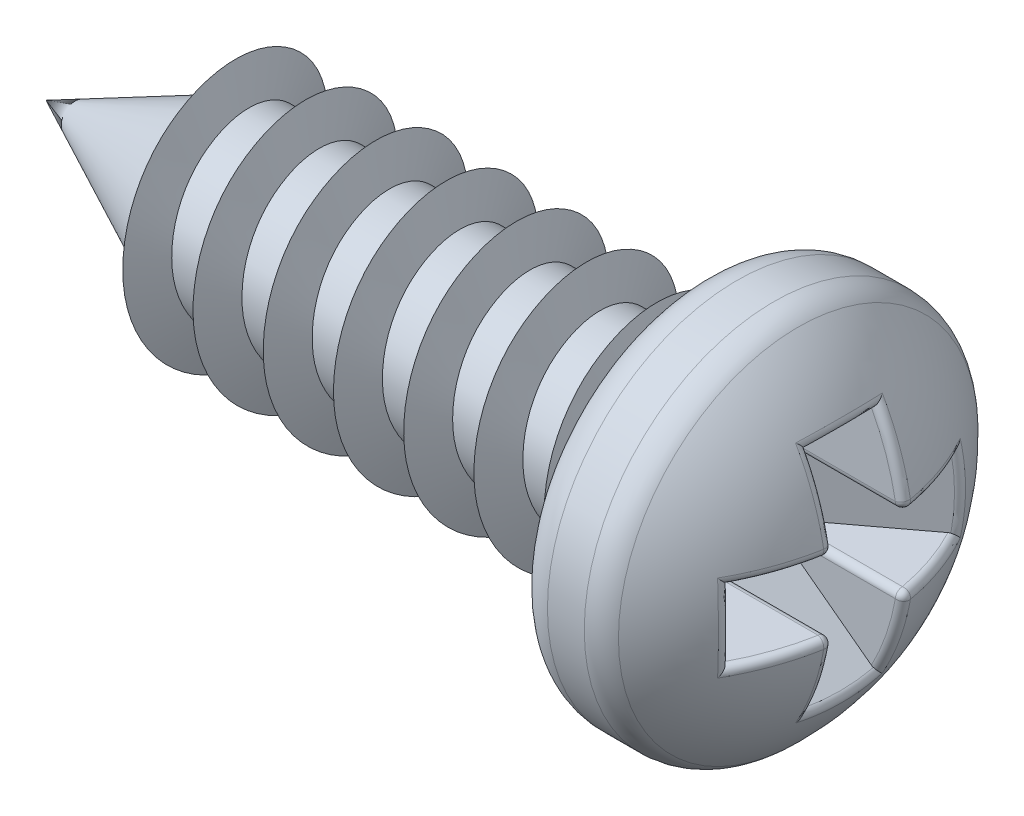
ISO-10303-21;
HEADER;
FILE_DESCRIPTION(('STEP AP214'),'2;1');
FILE_NAME('part.step','',(''),(''),'','','');
FILE_SCHEMA(('AUTOMOTIVE_DESIGN { 1 0 10303 214 1 1 1 1 }'));
ENDSEC;
DATA;
#1=APPLICATION_CONTEXT('core data for automotive mechanical design processes');
#2=APPLICATION_PROTOCOL_DEFINITION('international standard','automotive_design',2000,#1);
#3=PRODUCT_CONTEXT('',#1,'mechanical');
#4=PRODUCT('Part','Part','',(#3));
#5=PRODUCT_RELATED_PRODUCT_CATEGORY('part','',(#4));
#6=PRODUCT_DEFINITION_FORMATION('','',#4);
#7=PRODUCT_DEFINITION_CONTEXT('part definition',#1,'design');
#8=PRODUCT_DEFINITION('design','',#6,#7);
#9=PRODUCT_DEFINITION_SHAPE('','',#8);
#10=(LENGTH_UNIT() NAMED_UNIT(*) SI_UNIT(.MILLI.,.METRE.));
#11=(NAMED_UNIT(*) PLANE_ANGLE_UNIT() SI_UNIT($,.RADIAN.));
#12=(NAMED_UNIT(*) SI_UNIT($,.STERADIAN.) SOLID_ANGLE_UNIT());
#13=UNCERTAINTY_MEASURE_WITH_UNIT(LENGTH_MEASURE(1.E-05),#10,'distance_accuracy_value','');
#14=(GEOMETRIC_REPRESENTATION_CONTEXT(3) GLOBAL_UNCERTAINTY_ASSIGNED_CONTEXT((#13)) GLOBAL_UNIT_ASSIGNED_CONTEXT((#10,
#11,#12)) REPRESENTATION_CONTEXT('',''));
#15=CARTESIAN_POINT('',(0.,0.,0.));
#16=DIRECTION('',(0.,0.,1.));
#17=DIRECTION('',(1.,0.,0.));
#18=AXIS2_PLACEMENT_3D('',#15,#16,#17);
#19=CARTESIAN_POINT('',(8.24552512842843,0.,0.));
#20=DIRECTION('',(-1.,0.,0.));
#21=DIRECTION('',(0.,1.,0.));
#22=AXIS2_PLACEMENT_3D('',#19,#20,#21);
#23=SPHERICAL_SURFACE('',#22,3.55447487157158);
#24=CARTESIAN_POINT('',(8.51265128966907,-0.356168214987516,0.));
#25=DIRECTION('',(-0.600000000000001,0.799999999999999,0.));
#26=DIRECTION('',(-0.799999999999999,-0.600000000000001,0.));
#27=AXIS2_PLACEMENT_3D('',#24,#25,#26);
#28=CIRCLE('',#27,3.52648258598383);
#29=CARTESIAN_POINT('',(11.2902687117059,1.72704485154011,0.617368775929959));
#30=VERTEX_POINT('',#29);
#31=CARTESIAN_POINT('',(11.2902687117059,1.72704485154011,-0.617368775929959));
#32=VERTEX_POINT('',#31);
#33=EDGE_CURVE('E298',#30,#32,#28,.T.);
#34=ORIENTED_EDGE('',*,*,#33,.T.);
#35=CARTESIAN_POINT('',(8.24552512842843,0.,-0.617368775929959));
#36=DIRECTION('',(0.,0.,1.));
#37=DIRECTION('',(1.,0.,0.));
#38=AXIS2_PLACEMENT_3D('',#35,#36,#37);
#39=CIRCLE('',#38,3.50044960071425);
#40=CARTESIAN_POINT('',(11.6911024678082,0.617368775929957,-0.617368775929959));
#41=VERTEX_POINT('',#40);
#42=EDGE_CURVE('E300',#32,#41,#39,.F.);
#43=ORIENTED_EDGE('',*,*,#42,.T.);
#44=CARTESIAN_POINT('',(8.24552512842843,0.617368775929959,0.));
#45=DIRECTION('',(0.,-1.,0.));
#46=DIRECTION('',(0.,0.,-1.));
#47=AXIS2_PLACEMENT_3D('',#44,#45,#46);
#48=CIRCLE('',#47,3.50044960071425);
#49=CARTESIAN_POINT('',(11.2902687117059,0.617368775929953,-1.72704485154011));
#50=VERTEX_POINT('',#49);
#51=EDGE_CURVE('E270',#41,#50,#48,.F.);
#52=ORIENTED_EDGE('',*,*,#51,.T.);
#53=CARTESIAN_POINT('',(8.51265128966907,0.,0.356168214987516));
#54=DIRECTION('',(-0.600000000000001,0.,-0.799999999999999));
#55=DIRECTION('',(-0.799999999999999,0.,0.600000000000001));
#56=AXIS2_PLACEMENT_3D('',#53,#54,#55);
#57=CIRCLE('',#56,3.52648258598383);
#58=CARTESIAN_POINT('',(11.2902687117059,-0.617368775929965,-1.72704485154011));
#59=VERTEX_POINT('',#58);
#60=EDGE_CURVE('E272',#50,#59,#57,.T.);
#61=ORIENTED_EDGE('',*,*,#60,.T.);
#62=CARTESIAN_POINT('',(8.24552512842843,-0.617368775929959,0.));
#63=DIRECTION('',(0.,1.,0.));
#64=DIRECTION('',(0.,0.,1.));
#65=AXIS2_PLACEMENT_3D('',#62,#63,#64);
#66=CIRCLE('',#65,3.50044960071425);
#67=CARTESIAN_POINT('',(11.6911024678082,-0.617368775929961,-0.617368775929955));
#68=VERTEX_POINT('',#67);
#69=EDGE_CURVE('E279',#59,#68,#66,.F.);
#70=ORIENTED_EDGE('',*,*,#69,.T.);
#71=CARTESIAN_POINT('',(8.24552512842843,0.,-0.617368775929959));
#72=DIRECTION('',(0.,0.,1.));
#73=DIRECTION('',(0.,-1.,0.));
#74=AXIS2_PLACEMENT_3D('',#71,#72,#73);
#75=CIRCLE('',#74,3.50044960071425);
#76=CARTESIAN_POINT('',(11.2902687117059,-1.72704485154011,-0.617368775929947));
#77=VERTEX_POINT('',#76);
#78=EDGE_CURVE('E282',#68,#77,#75,.F.);
#79=ORIENTED_EDGE('',*,*,#78,.T.);
#80=CARTESIAN_POINT('',(8.51265128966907,0.356168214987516,0.));
#81=DIRECTION('',(-0.600000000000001,-0.799999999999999,0.));
#82=DIRECTION('',(0.799999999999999,-0.600000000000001,0.));
#83=AXIS2_PLACEMENT_3D('',#80,#81,#82);
#84=CIRCLE('',#83,3.52648258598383);
#85=CARTESIAN_POINT('',(11.2902687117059,-1.72704485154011,0.617368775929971));
#86=VERTEX_POINT('',#85);
#87=EDGE_CURVE('E284',#77,#86,#84,.T.);
#88=ORIENTED_EDGE('',*,*,#87,.T.);
#89=CARTESIAN_POINT('',(8.24552512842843,0.,0.617368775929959));
#90=DIRECTION('',(0.,0.,-1.));
#91=DIRECTION('',(0.,1.,0.));
#92=AXIS2_PLACEMENT_3D('',#89,#90,#91);
#93=CIRCLE('',#92,3.50044960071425);
#94=CARTESIAN_POINT('',(11.6911024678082,-0.617368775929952,0.617368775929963));
#95=VERTEX_POINT('',#94);
#96=EDGE_CURVE('E286',#86,#95,#93,.F.);
#97=ORIENTED_EDGE('',*,*,#96,.T.);
#98=CARTESIAN_POINT('',(8.24552512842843,-0.617368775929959,0.));
#99=DIRECTION('',(0.,1.,0.));
#100=DIRECTION('',(0.,0.,1.));
#101=AXIS2_PLACEMENT_3D('',#98,#99,#100);
#102=CIRCLE('',#101,3.50044960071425);
#103=CARTESIAN_POINT('',(11.2902687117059,-0.617368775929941,1.72704485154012));
#104=VERTEX_POINT('',#103);
#105=EDGE_CURVE('E289',#95,#104,#102,.F.);
#106=ORIENTED_EDGE('',*,*,#105,.T.);
#107=CARTESIAN_POINT('',(8.51265128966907,0.,-0.356168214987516));
#108=DIRECTION('',(-0.600000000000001,0.,0.799999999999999));
#109=DIRECTION('',(0.799999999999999,0.,0.600000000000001));
#110=AXIS2_PLACEMENT_3D('',#107,#108,#109);
#111=CIRCLE('',#110,3.52648258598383);
#112=CARTESIAN_POINT('',(11.2902687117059,0.617368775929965,1.72704485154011));
#113=VERTEX_POINT('',#112);
#114=EDGE_CURVE('E291',#104,#113,#111,.T.);
#115=ORIENTED_EDGE('',*,*,#114,.T.);
#116=CARTESIAN_POINT('',(8.24552512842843,0.617368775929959,0.));
#117=DIRECTION('',(0.,-1.,0.));
#118=DIRECTION('',(0.,0.,-1.));
#119=AXIS2_PLACEMENT_3D('',#116,#117,#118);
#120=CIRCLE('',#119,3.50044960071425);
#121=CARTESIAN_POINT('',(11.6911024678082,0.617368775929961,0.617368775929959));
#122=VERTEX_POINT('',#121);
#123=EDGE_CURVE('E293',#113,#122,#120,.F.);
#124=ORIENTED_EDGE('',*,*,#123,.T.);
#125=CARTESIAN_POINT('',(8.24552512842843,0.,0.617368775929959));
#126=DIRECTION('',(0.,0.,-1.));
#127=DIRECTION('',(-1.,0.,0.));
#128=AXIS2_PLACEMENT_3D('',#125,#126,#127);
#129=CIRCLE('',#128,3.50044960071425);
#130=EDGE_CURVE('E296',#122,#30,#129,.F.);
#131=ORIENTED_EDGE('',*,*,#130,.T.);
#132=EDGE_LOOP('',(#34,#43,#52,#61,#70,#79,#88,#97,#106,#115,#124,#131));
#133=FACE_BOUND('',#132,.T.);
#134=CARTESIAN_POINT('',(10.7112987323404,0.,0.));
#135=DIRECTION('',(-1.,0.,0.));
#136=DIRECTION('',(0.,0.,1.));
#137=AXIS2_PLACEMENT_3D('',#134,#135,#136);
#138=CIRCLE('',#137,2.56012736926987);
#139=CARTESIAN_POINT('',(10.7112987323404,0.,2.56012736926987));
#140=VERTEX_POINT('',#139);
#141=EDGE_CURVE('E274',#140,#140,#138,.T.);
#142=ORIENTED_EDGE('',*,*,#141,.F.);
#143=EDGE_LOOP('',(#142));
#144=FACE_BOUND('',#143,.T.);
#145=ADVANCED_FACE('F31',(#133,#144),#23,.T.);
#146=CARTESIAN_POINT('',(11.8,0.,-0.5));
#147=DIRECTION('',(0.,0.,-1.));
#148=DIRECTION('',(-1.,0.,0.));
#149=AXIS2_PLACEMENT_3D('',#146,#147,#148);
#150=PLANE('',#149);
#151=DIRECTION('',(-0.799999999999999,-0.600000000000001,0.));
#152=VECTOR('',#151,1.);
#153=CARTESIAN_POINT('',(11.8,2.,-0.5));
#154=LINE('',#153,#152);
#155=CARTESIAN_POINT('',(11.2531412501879,1.58985593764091,-0.5));
#156=VERTEX_POINT('',#155);
#157=CARTESIAN_POINT('',(9.93333333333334,0.599999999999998,-0.5));
#158=VERTEX_POINT('',#157);
#159=EDGE_CURVE('E532',#156,#158,#154,.T.);
#160=ORIENTED_EDGE('',*,*,#159,.T.);
#161=DIRECTION('',(-1.,0.,0.));
#162=VECTOR('',#161,1.);
#163=CARTESIAN_POINT('',(11.6105506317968,0.599999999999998,-0.5));
#164=LINE('',#163,#162);
#165=CARTESIAN_POINT('',(11.5941661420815,0.599999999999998,-0.5));
#166=VERTEX_POINT('',#165);
#167=EDGE_CURVE('E665',#158,#166,#164,.F.);
#168=ORIENTED_EDGE('',*,*,#167,.T.);
#169=CARTESIAN_POINT('',(8.24552512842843,0.,-0.5));
#170=DIRECTION('',(0.,0.,-1.));
#171=DIRECTION('',(-1.,0.,0.));
#172=AXIS2_PLACEMENT_3D('',#169,#170,#171);
#173=CIRCLE('',#172,3.40196952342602);
#174=EDGE_CURVE('E303',#166,#156,#173,.F.);
#175=ORIENTED_EDGE('',*,*,#174,.T.);
#176=EDGE_LOOP('',(#160,#168,#175));
#177=FACE_BOUND('',#176,.T.);
#178=ADVANCED_FACE('F500',(#177),#150,.F.);
#179=CARTESIAN_POINT('',(11.8,0.,0.5));
#180=DIRECTION('',(0.,0.,-1.));
#181=DIRECTION('',(-1.,0.,0.));
#182=AXIS2_PLACEMENT_3D('',#179,#180,#181);
#183=PLANE('',#182);
#184=CARTESIAN_POINT('',(8.24552512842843,0.,0.5));
#185=DIRECTION('',(0.,0.,-1.));
#186=DIRECTION('',(-1.,0.,0.));
#187=AXIS2_PLACEMENT_3D('',#184,#185,#186);
#188=CIRCLE('',#187,3.40196952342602);
#189=CARTESIAN_POINT('',(11.2531412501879,1.58985593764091,0.5));
#190=VERTEX_POINT('',#189);
#191=CARTESIAN_POINT('',(11.5941661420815,0.600000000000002,0.5));
#192=VERTEX_POINT('',#191);
#193=EDGE_CURVE('E307',#190,#192,#188,.T.);
#194=ORIENTED_EDGE('',*,*,#193,.T.);
#195=DIRECTION('',(-1.,0.,0.));
#196=VECTOR('',#195,1.);
#197=CARTESIAN_POINT('',(11.8,0.600000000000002,0.5));
#198=LINE('',#197,#196);
#199=CARTESIAN_POINT('',(9.93333333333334,0.600000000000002,0.5));
#200=VERTEX_POINT('',#199);
#201=EDGE_CURVE('E655',#192,#200,#198,.T.);
#202=ORIENTED_EDGE('',*,*,#201,.T.);
#203=DIRECTION('',(-0.799999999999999,-0.600000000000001,0.));
#204=VECTOR('',#203,1.);
#205=CARTESIAN_POINT('',(11.8,2.,0.5));
#206=LINE('',#205,#204);
#207=EDGE_CURVE('E538',#190,#200,#206,.T.);
#208=ORIENTED_EDGE('',*,*,#207,.F.);
#209=EDGE_LOOP('',(#194,#202,#208));
#210=FACE_BOUND('',#209,.T.);
#211=ADVANCED_FACE('F443',(#210),#183,.T.);
#212=CARTESIAN_POINT('',(10.3644438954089,0.,0.));
#213=DIRECTION('',(-1.,0.,0.));
#214=DIRECTION('',(0.,0.,1.));
#215=AXIS2_PLACEMENT_3D('',#212,#213,#214);
#216=TOROIDAL_SURFACE('',#215,2.2,0.5);
#217=CARTESIAN_POINT('',(10.3644438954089,0.,0.));
#218=DIRECTION('',(-1.,0.,0.));
#219=DIRECTION('',(0.,0.,1.));
#220=AXIS2_PLACEMENT_3D('',#217,#218,#219);
#221=CIRCLE('',#220,2.7);
#222=CARTESIAN_POINT('',(10.3644438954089,0.,2.7));
#223=VERTEX_POINT('',#222);
#224=EDGE_CURVE('E512',#223,#223,#221,.T.);
#225=ORIENTED_EDGE('',*,*,#224,.F.);
#226=EDGE_LOOP('',(#225));
#227=FACE_BOUND('',#226,.T.);
#228=ORIENTED_EDGE('',*,*,#141,.T.);
#229=EDGE_LOOP('',(#228));
#230=FACE_BOUND('',#229,.T.);
#231=ADVANCED_FACE('F887',(#227,#230),#216,.T.);
#232=CARTESIAN_POINT('',(0.,0.,0.));
#233=DIRECTION('',(-1.,0.,0.));
#234=DIRECTION('',(0.,0.,1.));
#235=AXIS2_PLACEMENT_3D('',#232,#233,#234);
#236=CYLINDRICAL_SURFACE('',#235,2.7);
#237=CARTESIAN_POINT('',(9.84000000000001,0.,0.));
#238=DIRECTION('',(-1.,0.,0.));
#239=DIRECTION('',(0.,0.,1.));
#240=AXIS2_PLACEMENT_3D('',#237,#238,#239);
#241=CIRCLE('',#240,2.7);
#242=CARTESIAN_POINT('',(9.84000000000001,0.,2.7));
#243=VERTEX_POINT('',#242);
#244=EDGE_CURVE('E514',#243,#243,#241,.T.);
#245=ORIENTED_EDGE('',*,*,#244,.F.);
#246=EDGE_LOOP('',(#245));
#247=FACE_BOUND('',#246,.T.);
#248=ORIENTED_EDGE('',*,*,#224,.T.);
#249=EDGE_LOOP('',(#248));
#250=FACE_BOUND('',#249,.T.);
#251=ADVANCED_FACE('F917',(#247,#250),#236,.T.);
#252=CARTESIAN_POINT('',(9.84,0.,0.));
#253=DIRECTION('',(-1.,0.,0.));
#254=DIRECTION('',(0.,0.,1.));
#255=AXIS2_PLACEMENT_3D('',#252,#253,#254);
#256=TOROIDAL_SURFACE('',#255,2.16,0.54);
#257=CARTESIAN_POINT('',(9.3,0.,0.));
#258=DIRECTION('',(-1.,0.,0.));
#259=DIRECTION('',(0.,0.,1.));
#260=AXIS2_PLACEMENT_3D('',#257,#258,#259);
#261=CIRCLE('',#260,2.16);
#262=CARTESIAN_POINT('',(9.3,0.,2.16));
#263=VERTEX_POINT('',#262);
#264=EDGE_CURVE('E519',#263,#263,#261,.T.);
#265=ORIENTED_EDGE('',*,*,#264,.F.);
#266=EDGE_LOOP('',(#265));
#267=FACE_BOUND('',#266,.T.);
#268=ORIENTED_EDGE('',*,*,#244,.T.);
#269=EDGE_LOOP('',(#268));
#270=FACE_BOUND('',#269,.T.);
#271=ADVANCED_FACE('F912',(#267,#270),#256,.T.);
#272=CARTESIAN_POINT('',(9.3,1.2,0.));
#273=DIRECTION('',(1.,0.,0.));
#274=DIRECTION('',(0.,0.,-1.));
#275=AXIS2_PLACEMENT_3D('',#272,#273,#274);
#276=PLANE('',#275);
#277=CARTESIAN_POINT('',(9.3,0.,0.));
#278=DIRECTION('',(1.,0.,0.));
#279=DIRECTION('',(0.,0.,-1.));
#280=AXIS2_PLACEMENT_3D('',#277,#278,#279);
#281=CIRCLE('',#280,1.7);
#282=CARTESIAN_POINT('',(9.3,0.,-1.7));
#283=VERTEX_POINT('',#282);
#284=EDGE_CURVE('E264',#283,#283,#281,.T.);
#285=ORIENTED_EDGE('',*,*,#284,.T.);
#286=EDGE_LOOP('',(#285));
#287=FACE_BOUND('',#286,.T.);
#288=ORIENTED_EDGE('',*,*,#264,.T.);
#289=EDGE_LOOP('',(#288));
#290=FACE_BOUND('',#289,.T.);
#291=ADVANCED_FACE('F268',(#287,#290),#276,.F.);
#292=CARTESIAN_POINT('',(0.,0.,0.));
#293=DIRECTION('',(-1.,0.,0.));
#294=DIRECTION('',(0.,0.,1.));
#295=AXIS2_PLACEMENT_3D('',#292,#293,#294);
#296=CYLINDRICAL_SURFACE('',#295,1.2);
#297=CARTESIAN_POINT('',(2.5,0.,0.));
#298=DIRECTION('',(-1.,0.,0.));
#299=DIRECTION('',(0.,0.,1.));
#300=AXIS2_PLACEMENT_3D('',#297,#298,#299);
#301=CIRCLE('',#300,1.2);
#302=CARTESIAN_POINT('',(2.5,0.00318854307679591,-1.19999576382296));
#303=VERTEX_POINT('',#302);
#304=CARTESIAN_POINT('',(2.50000000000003,0.703168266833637,0.972396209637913));
#305=VERTEX_POINT('',#304);
#306=EDGE_CURVE('E525',#303,#305,#301,.T.);
#307=ORIENTED_EDGE('',*,*,#306,.F.);
#308=CARTESIAN_POINT('',(9.49961618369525,0.,-1.2));
#309=CARTESIAN_POINT('',(9.41628285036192,-0.692820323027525,-1.20000000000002));
#310=CARTESIAN_POINT('',(9.33294951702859,-1.03923048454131,-0.600000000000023));
#311=CARTESIAN_POINT('',(9.24961618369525,-1.3856406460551,0.));
#312=CARTESIAN_POINT('',(9.16628285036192,-1.03923048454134,0.599999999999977));
#313=CARTESIAN_POINT('',(9.08294951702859,-0.692820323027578,1.19999999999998));
#314=CARTESIAN_POINT('',(8.99961618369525,0.,1.2));
#315=CARTESIAN_POINT('',(8.91628285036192,0.692820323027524,1.20000000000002));
#316=CARTESIAN_POINT('',(8.83294951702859,1.03923048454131,0.600000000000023));
#317=CARTESIAN_POINT('',(8.74961618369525,1.3856406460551,0.));
#318=CARTESIAN_POINT('',(8.66628285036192,1.03923048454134,-0.599999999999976));
#319=CARTESIAN_POINT('',(8.58294951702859,0.692820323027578,-1.19999999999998));
#320=CARTESIAN_POINT('',(8.49961618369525,0.,-1.2));
#321=CARTESIAN_POINT('',(8.41628285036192,-0.692820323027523,-1.20000000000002));
#322=CARTESIAN_POINT('',(8.33294951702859,-1.03923048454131,-0.600000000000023));
#323=CARTESIAN_POINT('',(8.24961618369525,-1.3856406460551,0.));
#324=CARTESIAN_POINT('',(8.16628285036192,-1.03923048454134,0.599999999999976));
#325=CARTESIAN_POINT('',(8.08294951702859,-0.692820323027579,1.19999999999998));
#326=CARTESIAN_POINT('',(7.99961618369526,0.,1.2));
#327=CARTESIAN_POINT('',(7.91628285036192,0.692820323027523,1.20000000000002));
#328=CARTESIAN_POINT('',(7.83294951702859,1.03923048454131,0.600000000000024));
#329=CARTESIAN_POINT('',(7.74961618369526,1.3856406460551,0.));
#330=CARTESIAN_POINT('',(7.66628285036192,1.03923048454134,-0.599999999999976));
#331=CARTESIAN_POINT('',(7.58294951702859,0.692820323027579,-1.19999999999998));
#332=CARTESIAN_POINT('',(7.49961618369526,0.,-1.2));
#333=CARTESIAN_POINT('',(7.41628285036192,-0.692820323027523,-1.20000000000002));
#334=CARTESIAN_POINT('',(7.33294951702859,-1.03923048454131,-0.600000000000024));
#335=CARTESIAN_POINT('',(7.24961618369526,-1.3856406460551,0.));
#336=CARTESIAN_POINT('',(7.16628285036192,-1.03923048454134,0.599999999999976));
#337=CARTESIAN_POINT('',(7.08294951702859,-0.692820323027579,1.19999999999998));
#338=CARTESIAN_POINT('',(6.99961618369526,0.,1.2));
#339=CARTESIAN_POINT('',(6.91628285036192,0.692820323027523,1.20000000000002));
#340=CARTESIAN_POINT('',(6.83294951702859,1.03923048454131,0.600000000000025));
#341=CARTESIAN_POINT('',(6.74961618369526,1.3856406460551,0.));
#342=CARTESIAN_POINT('',(6.66628285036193,1.03923048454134,-0.599999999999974));
#343=CARTESIAN_POINT('',(6.58294951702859,0.692820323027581,-1.19999999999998));
#344=CARTESIAN_POINT('',(6.49961618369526,0.,-1.2));
#345=CARTESIAN_POINT('',(6.41628285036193,-0.692820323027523,-1.20000000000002));
#346=CARTESIAN_POINT('',(6.33294951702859,-1.03923048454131,-0.600000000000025));
#347=CARTESIAN_POINT('',(6.24961618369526,-1.3856406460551,0.));
#348=CARTESIAN_POINT('',(6.16628285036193,-1.03923048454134,0.599999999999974));
#349=CARTESIAN_POINT('',(6.08294951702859,-0.692820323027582,1.19999999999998));
#350=CARTESIAN_POINT('',(5.99961618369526,0.,1.2));
#351=CARTESIAN_POINT('',(5.91628285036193,0.692820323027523,1.20000000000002));
#352=CARTESIAN_POINT('',(5.83294951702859,1.03923048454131,0.600000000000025));
#353=CARTESIAN_POINT('',(5.74961618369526,1.3856406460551,0.));
#354=CARTESIAN_POINT('',(5.66628285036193,1.03923048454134,-0.599999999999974));
#355=CARTESIAN_POINT('',(5.58294951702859,0.692820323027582,-1.19999999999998));
#356=CARTESIAN_POINT('',(5.49961618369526,0.,-1.2));
#357=CARTESIAN_POINT('',(5.41628285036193,-0.692820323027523,-1.20000000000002));
#358=CARTESIAN_POINT('',(5.3329495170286,-1.03923048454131,-0.600000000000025));
#359=CARTESIAN_POINT('',(5.24961618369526,-1.3856406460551,0.));
#360=CARTESIAN_POINT('',(5.16628285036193,-1.03923048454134,0.599999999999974));
#361=CARTESIAN_POINT('',(5.0829495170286,-0.692820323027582,1.19999999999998));
#362=CARTESIAN_POINT('',(4.99961618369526,0.,1.2));
#363=CARTESIAN_POINT('',(4.91628285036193,0.692820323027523,1.20000000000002));
#364=CARTESIAN_POINT('',(4.8329495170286,1.03923048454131,0.600000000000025));
#365=CARTESIAN_POINT('',(4.74961618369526,1.3856406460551,0.));
#366=CARTESIAN_POINT('',(4.66628285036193,1.03923048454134,-0.599999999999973));
#367=CARTESIAN_POINT('',(4.5829495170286,0.692820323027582,-1.19999999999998));
#368=CARTESIAN_POINT('',(4.49961618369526,0.,-1.2));
#369=CARTESIAN_POINT('',(4.41628285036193,-0.692820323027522,-1.20000000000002));
#370=CARTESIAN_POINT('',(4.3329495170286,-1.03923048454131,-0.600000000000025));
#371=CARTESIAN_POINT('',(4.24961618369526,-1.3856406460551,0.));
#372=CARTESIAN_POINT('',(4.16628285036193,-1.03923048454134,0.599999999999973));
#373=CARTESIAN_POINT('',(4.0829495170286,-0.692820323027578,1.19999999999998));
#374=CARTESIAN_POINT('',(3.99961618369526,0.,1.2));
#375=CARTESIAN_POINT('',(3.91628285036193,0.692820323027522,1.20000000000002));
#376=CARTESIAN_POINT('',(3.8329495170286,1.03923048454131,0.600000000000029));
#377=CARTESIAN_POINT('',(3.74961618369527,1.3856406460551,0.));
#378=CARTESIAN_POINT('',(3.66628285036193,1.03923048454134,-0.599999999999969));
#379=CARTESIAN_POINT('',(3.5829495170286,0.692820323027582,-1.19999999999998));
#380=CARTESIAN_POINT('',(3.49961618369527,0.,-1.2));
#381=CARTESIAN_POINT('',(3.41628285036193,-0.692820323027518,-1.20000000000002));
#382=CARTESIAN_POINT('',(3.3329495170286,-1.03923048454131,-0.600000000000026));
#383=CARTESIAN_POINT('',(3.24961618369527,-1.3856406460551,0.));
#384=CARTESIAN_POINT('',(3.16628285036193,-1.03923048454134,0.599999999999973));
#385=CARTESIAN_POINT('',(3.0829495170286,-0.692820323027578,1.19999999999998));
#386=CARTESIAN_POINT('',(2.99961618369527,0.,1.2));
#387=CARTESIAN_POINT('',(2.91628285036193,0.692820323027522,1.20000000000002));
#388=CARTESIAN_POINT('',(2.8329495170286,1.03923048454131,0.600000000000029));
#389=CARTESIAN_POINT('',(2.74961618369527,1.3856406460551,0.));
#390=CARTESIAN_POINT('',(2.66628285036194,1.03923048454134,-0.599999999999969));
#391=CARTESIAN_POINT('',(2.5829495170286,0.692820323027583,-1.19999999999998));
#392=CARTESIAN_POINT('',(2.49961618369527,0.,-1.2));
#393=(BOUNDED_CURVE() B_SPLINE_CURVE(2,(#308,#309,#310,#311,#312,#313,#314,#315,#316,#317,#318,
#319,#320,#321,#322,#323,#324,#325,#326,#327,#328,#329,#330,#331,#332,#333,#334,#335,#336,#337,
#338,#339,#340,#341,#342,#343,#344,#345,#346,#347,#348,#349,#350,#351,#352,#353,#354,#355,#356,
#357,#358,#359,#360,#361,#362,#363,#364,#365,#366,#367,#368,#369,#370,#371,#372,#373,#374,#375,
#376,#377,#378,#379,#380,#381,#382,#383,#384,#385,#386,#387,#388,#389,#390,#391,#392),
.UNSPECIFIED.,.F.,.F.) B_SPLINE_CURVE_WITH_KNOTS((3,2,2,2,2,2,2,2,2,2,2,2,2,2,2,2,2,2,2,2,2,2,2,
2,2,2,2,2,2,2,2,2,2,2,2,2,2,2,2,2,2,2,3),(0.,0.0238095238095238,0.0476190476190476,
0.0714285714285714,0.0952380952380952,0.119047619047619,0.142857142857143,0.166666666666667,
0.19047619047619,0.214285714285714,0.238095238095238,0.261904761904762,0.285714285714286,
0.30952380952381,0.333333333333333,0.357142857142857,0.380952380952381,0.404761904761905,
0.428571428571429,0.452380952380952,0.476190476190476,0.5,0.523809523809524,0.547619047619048,
0.571428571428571,0.595238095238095,0.619047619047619,0.642857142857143,0.666666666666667,
0.69047619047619,0.714285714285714,0.738095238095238,0.761904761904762,0.785714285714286,
0.80952380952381,0.833333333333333,0.857142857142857,0.880952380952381,0.904761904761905,
0.928571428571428,0.952380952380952,0.976190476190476,1.),
.UNSPECIFIED.) CURVE() GEOMETRIC_REPRESENTATION_ITEM() RATIONAL_B_SPLINE_CURVE((1.,
0.866025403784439,1.,0.866025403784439,1.,0.866025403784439,1.,0.866025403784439,1.,
0.866025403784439,1.,0.866025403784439,1.,0.866025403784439,1.,0.866025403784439,1.,
0.866025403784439,1.,0.866025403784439,1.,0.866025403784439,1.,0.866025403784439,1.,
0.866025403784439,1.,0.866025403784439,1.,0.866025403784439,1.,0.866025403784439,1.,
0.866025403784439,1.,0.866025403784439,1.,0.866025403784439,1.,0.866025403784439,1.,
0.866025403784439,1.,0.866025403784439,1.,0.866025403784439,1.,0.866025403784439,1.,
0.866025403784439,1.,0.866025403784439,1.,0.866025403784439,1.,0.866025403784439,1.,
0.866025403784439,1.,0.866025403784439,1.,0.866025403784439,1.,0.866025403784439,1.,
0.866025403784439,1.,0.866025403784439,1.,0.866025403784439,1.,0.866025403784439,1.,
0.866025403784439,1.,0.866025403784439,1.,0.866025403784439,1.,0.866025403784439,1.,
0.866025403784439,1.,0.866025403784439,1.)) REPRESENTATION_ITEM(''));
#394=CARTESIAN_POINT('',(8.8,1.14385429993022,0.362763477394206));
#395=VERTEX_POINT('',#394);
#396=EDGE_CURVE('E953',#395,#303,#393,.T.);
#397=ORIENTED_EDGE('',*,*,#396,.F.);
#398=CARTESIAN_POINT('',(8.8,0.,0.));
#399=DIRECTION('',(1.,0.,0.));
#400=DIRECTION('',(0.,0.,-1.));
#401=AXIS2_PLACEMENT_3D('',#398,#399,#400);
#402=CIRCLE('',#401,1.2);
#403=CARTESIAN_POINT('',(8.8,-1.14385429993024,0.362763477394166));
#404=VERTEX_POINT('',#403);
#405=EDGE_CURVE('E266',#395,#404,#402,.F.);
#406=ORIENTED_EDGE('',*,*,#405,.T.);
#407=CARTESIAN_POINT('',(9.10038381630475,0.,-1.2));
#408=CARTESIAN_POINT('',(9.01705048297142,-0.692820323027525,-1.20000000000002));
#409=CARTESIAN_POINT('',(8.93371714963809,-1.03923048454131,-0.600000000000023));
#410=CARTESIAN_POINT('',(8.85038381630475,-1.3856406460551,0.));
#411=CARTESIAN_POINT('',(8.76705048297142,-1.03923048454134,0.599999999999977));
#412=CARTESIAN_POINT('',(8.68371714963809,-0.692820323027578,1.19999999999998));
#413=CARTESIAN_POINT('',(8.60038381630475,0.,1.2));
#414=CARTESIAN_POINT('',(8.51705048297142,0.692820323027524,1.20000000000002));
#415=CARTESIAN_POINT('',(8.43371714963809,1.03923048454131,0.600000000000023));
#416=CARTESIAN_POINT('',(8.35038381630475,1.3856406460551,0.));
#417=CARTESIAN_POINT('',(8.26705048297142,1.03923048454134,-0.599999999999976));
#418=CARTESIAN_POINT('',(8.18371714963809,0.692820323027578,-1.19999999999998));
#419=CARTESIAN_POINT('',(8.10038381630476,0.,-1.2));
#420=CARTESIAN_POINT('',(8.01705048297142,-0.692820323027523,-1.20000000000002));
#421=CARTESIAN_POINT('',(7.93371714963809,-1.03923048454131,-0.600000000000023));
#422=CARTESIAN_POINT('',(7.85038381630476,-1.3856406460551,0.));
#423=CARTESIAN_POINT('',(7.76705048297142,-1.03923048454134,0.599999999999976));
#424=CARTESIAN_POINT('',(7.68371714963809,-0.692820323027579,1.19999999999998));
#425=CARTESIAN_POINT('',(7.60038381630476,0.,1.2));
#426=CARTESIAN_POINT('',(7.51705048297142,0.692820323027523,1.20000000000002));
#427=CARTESIAN_POINT('',(7.43371714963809,1.03923048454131,0.600000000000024));
#428=CARTESIAN_POINT('',(7.35038381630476,1.3856406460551,0.));
#429=CARTESIAN_POINT('',(7.26705048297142,1.03923048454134,-0.599999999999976));
#430=CARTESIAN_POINT('',(7.18371714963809,0.692820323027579,-1.19999999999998));
#431=CARTESIAN_POINT('',(7.10038381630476,0.,-1.2));
#432=CARTESIAN_POINT('',(7.01705048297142,-0.692820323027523,-1.20000000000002));
#433=CARTESIAN_POINT('',(6.93371714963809,-1.03923048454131,-0.600000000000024));
#434=CARTESIAN_POINT('',(6.85038381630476,-1.3856406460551,0.));
#435=CARTESIAN_POINT('',(6.76705048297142,-1.03923048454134,0.599999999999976));
#436=CARTESIAN_POINT('',(6.68371714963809,-0.692820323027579,1.19999999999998));
#437=CARTESIAN_POINT('',(6.60038381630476,0.,1.2));
#438=CARTESIAN_POINT('',(6.51705048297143,0.692820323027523,1.20000000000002));
#439=CARTESIAN_POINT('',(6.43371714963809,1.03923048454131,0.600000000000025));
#440=CARTESIAN_POINT('',(6.35038381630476,1.3856406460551,0.));
#441=CARTESIAN_POINT('',(6.26705048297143,1.03923048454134,-0.599999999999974));
#442=CARTESIAN_POINT('',(6.18371714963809,0.692820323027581,-1.19999999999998));
#443=CARTESIAN_POINT('',(6.10038381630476,0.,-1.2));
#444=CARTESIAN_POINT('',(6.01705048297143,-0.692820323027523,-1.20000000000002));
#445=CARTESIAN_POINT('',(5.93371714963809,-1.03923048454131,-0.600000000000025));
#446=CARTESIAN_POINT('',(5.85038381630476,-1.3856406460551,0.));
#447=CARTESIAN_POINT('',(5.76705048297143,-1.03923048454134,0.599999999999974));
#448=CARTESIAN_POINT('',(5.68371714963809,-0.692820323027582,1.19999999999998));
#449=CARTESIAN_POINT('',(5.60038381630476,0.,1.2));
#450=CARTESIAN_POINT('',(5.51705048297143,0.692820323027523,1.20000000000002));
#451=CARTESIAN_POINT('',(5.43371714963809,1.03923048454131,0.600000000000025));
#452=CARTESIAN_POINT('',(5.35038381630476,1.3856406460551,0.));
#453=CARTESIAN_POINT('',(5.26705048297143,1.03923048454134,-0.599999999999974));
#454=CARTESIAN_POINT('',(5.1837171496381,0.692820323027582,-1.19999999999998));
#455=CARTESIAN_POINT('',(5.10038381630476,0.,-1.2));
#456=CARTESIAN_POINT('',(5.01705048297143,-0.692820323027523,-1.20000000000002));
#457=CARTESIAN_POINT('',(4.9337171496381,-1.03923048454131,-0.600000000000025));
#458=CARTESIAN_POINT('',(4.85038381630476,-1.3856406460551,0.));
#459=CARTESIAN_POINT('',(4.76705048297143,-1.03923048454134,0.599999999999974));
#460=CARTESIAN_POINT('',(4.6837171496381,-0.692820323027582,1.19999999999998));
#461=CARTESIAN_POINT('',(4.60038381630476,0.,1.2));
#462=CARTESIAN_POINT('',(4.51705048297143,0.692820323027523,1.20000000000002));
#463=CARTESIAN_POINT('',(4.4337171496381,1.03923048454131,0.600000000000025));
#464=CARTESIAN_POINT('',(4.35038381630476,1.3856406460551,0.));
#465=CARTESIAN_POINT('',(4.26705048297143,1.03923048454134,-0.599999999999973));
#466=CARTESIAN_POINT('',(4.1837171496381,0.692820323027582,-1.19999999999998));
#467=CARTESIAN_POINT('',(4.10038381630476,0.,-1.2));
#468=CARTESIAN_POINT('',(4.01705048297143,-0.692820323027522,-1.20000000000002));
#469=CARTESIAN_POINT('',(3.9337171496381,-1.03923048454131,-0.600000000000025));
#470=CARTESIAN_POINT('',(3.85038381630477,-1.3856406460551,0.));
#471=CARTESIAN_POINT('',(3.76705048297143,-1.03923048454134,0.599999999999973));
#472=CARTESIAN_POINT('',(3.6837171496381,-0.692820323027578,1.19999999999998));
#473=CARTESIAN_POINT('',(3.60038381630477,0.,1.2));
#474=CARTESIAN_POINT('',(3.51705048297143,0.692820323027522,1.20000000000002));
#475=CARTESIAN_POINT('',(3.4337171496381,1.03923048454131,0.600000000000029));
#476=CARTESIAN_POINT('',(3.35038381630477,1.3856406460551,0.));
#477=CARTESIAN_POINT('',(3.26705048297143,1.03923048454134,-0.599999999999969));
#478=CARTESIAN_POINT('',(3.1837171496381,0.692820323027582,-1.19999999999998));
#479=CARTESIAN_POINT('',(3.10038381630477,0.,-1.2));
#480=CARTESIAN_POINT('',(3.01705048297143,-0.692820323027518,-1.20000000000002));
#481=CARTESIAN_POINT('',(2.9337171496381,-1.03923048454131,-0.600000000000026));
#482=CARTESIAN_POINT('',(2.85038381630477,-1.3856406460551,0.));
#483=CARTESIAN_POINT('',(2.76705048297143,-1.03923048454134,0.599999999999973));
#484=CARTESIAN_POINT('',(2.6837171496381,-0.692820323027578,1.19999999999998));
#485=CARTESIAN_POINT('',(2.60038381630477,0.,1.2));
#486=CARTESIAN_POINT('',(2.51705048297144,0.692820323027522,1.20000000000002));
#487=CARTESIAN_POINT('',(2.4337171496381,1.03923048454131,0.600000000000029));
#488=CARTESIAN_POINT('',(2.35038381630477,1.3856406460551,0.));
#489=CARTESIAN_POINT('',(2.26705048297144,1.03923048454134,-0.599999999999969));
#490=CARTESIAN_POINT('',(2.1837171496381,0.692820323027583,-1.19999999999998));
#491=CARTESIAN_POINT('',(2.10038381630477,0.,-1.2));
#492=CARTESIAN_POINT('',(2.01705048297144,-0.692820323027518,-1.20000000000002));
#493=CARTESIAN_POINT('',(1.9337171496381,-1.03923048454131,-0.600000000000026));
#494=CARTESIAN_POINT('',(1.85038381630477,-1.3856406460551,0.));
#495=CARTESIAN_POINT('',(1.76705048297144,-1.03923048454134,0.599999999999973));
#496=CARTESIAN_POINT('',(1.6837171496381,-0.692820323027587,1.19999999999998));
#497=CARTESIAN_POINT('',(1.60038381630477,0.,1.2));
#498=CARTESIAN_POINT('',(1.51705048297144,0.692820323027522,1.20000000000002));
#499=CARTESIAN_POINT('',(1.4337171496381,1.03923048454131,0.60000000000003));
#500=CARTESIAN_POINT('',(1.35038381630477,1.3856406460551,0.));
#501=CARTESIAN_POINT('',(1.26705048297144,1.03923048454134,-0.599999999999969));
#502=CARTESIAN_POINT('',(1.1837171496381,0.692820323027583,-1.19999999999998));
#503=CARTESIAN_POINT('',(1.10038381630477,0.,-1.2));
#504=(BOUNDED_CURVE() B_SPLINE_CURVE(2,(#407,#408,#409,#410,#411,#412,#413,#414,#415,#416,#417,
#418,#419,#420,#421,#422,#423,#424,#425,#426,#427,#428,#429,#430,#431,#432,#433,#434,#435,#436,
#437,#438,#439,#440,#441,#442,#443,#444,#445,#446,#447,#448,#449,#450,#451,#452,#453,#454,#455,
#456,#457,#458,#459,#460,#461,#462,#463,#464,#465,#466,#467,#468,#469,#470,#471,#472,#473,#474,
#475,#476,#477,#478,#479,#480,#481,#482,#483,#484,#485,#486,#487,#488,#489,#490,#491,#492,#493,
#494,#495,#496,#497,#498,#499,#500,#501,#502,#503),.UNSPECIFIED.,.F.,
.F.) B_SPLINE_CURVE_WITH_KNOTS((3,2,2,2,2,2,2,2,2,2,2,2,2,2,2,2,2,2,2,2,2,2,2,2,2,2,2,2,2,2,2,2,
2,2,2,2,2,2,2,2,2,2,2,2,2,2,2,2,3),(0.,0.0208333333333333,0.0416666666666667,0.0625,
0.0833333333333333,0.104166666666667,0.125,0.145833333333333,0.166666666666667,0.1875,
0.208333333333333,0.229166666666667,0.25,0.270833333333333,0.291666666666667,0.3125,
0.333333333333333,0.354166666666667,0.375,0.395833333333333,0.416666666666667,0.4375,
0.458333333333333,0.479166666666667,0.5,0.520833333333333,0.541666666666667,0.5625,
0.583333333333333,0.604166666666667,0.625,0.645833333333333,0.666666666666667,0.6875,
0.708333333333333,0.729166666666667,0.75,0.770833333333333,0.791666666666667,0.8125,
0.833333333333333,0.854166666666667,0.875,0.895833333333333,0.916666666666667,0.9375,
0.958333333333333,0.979166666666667,1.),
.UNSPECIFIED.) CURVE() GEOMETRIC_REPRESENTATION_ITEM() RATIONAL_B_SPLINE_CURVE((1.,
0.866025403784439,1.,0.866025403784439,1.,0.866025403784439,1.,0.866025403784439,1.,
0.866025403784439,1.,0.866025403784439,1.,0.866025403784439,1.,0.866025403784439,1.,
0.866025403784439,1.,0.866025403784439,1.,0.866025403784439,1.,0.866025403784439,1.,
0.866025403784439,1.,0.866025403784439,1.,0.866025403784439,1.,0.866025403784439,1.,
0.866025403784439,1.,0.866025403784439,1.,0.866025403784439,1.,0.866025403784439,1.,
0.866025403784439,1.,0.866025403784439,1.,0.866025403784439,1.,0.866025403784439,1.,
0.866025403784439,1.,0.866025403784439,1.,0.866025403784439,1.,0.866025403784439,1.,
0.866025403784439,1.,0.866025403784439,1.,0.866025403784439,1.,0.866025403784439,1.,
0.866025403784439,1.,0.866025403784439,1.,0.866025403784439,1.,0.866025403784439,1.,
0.866025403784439,1.,0.866025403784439,1.,0.866025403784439,1.,0.866025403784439,1.,
0.866025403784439,1.,0.866025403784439,1.,0.866025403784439,1.,0.866025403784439,1.,
0.866025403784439,1.,0.866025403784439,1.,0.866025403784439,1.,0.866025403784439,1.)) REPRESENTATION_ITEM(''));
#505=EDGE_CURVE('E50',#404,#305,#504,.T.);
#506=ORIENTED_EDGE('',*,*,#505,.T.);
#507=EDGE_LOOP('',(#307,#397,#406,#506));
#508=FACE_BOUND('',#507,.T.);
#509=ADVANCED_FACE('F943',(#508),#296,.T.);
#510=CARTESIAN_POINT('',(2.5,0.,0.));
#511=DIRECTION('',(1.,0.,0.));
#512=DIRECTION('',(0.,0.,-1.));
#513=AXIS2_PLACEMENT_3D('',#510,#511,#512);
#514=CONICAL_SURFACE('',#513,1.2,0.44751997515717);
#515=CARTESIAN_POINT('',(0.,0.,0.));
#516=VERTEX_POINT('',#515);
#517=VERTEX_LOOP('',#516);
#518=FACE_BOUND('',#517,.T.);
#519=EDGE_CURVE('E522',#305,#303,#301,.T.);
#520=ORIENTED_EDGE('',*,*,#519,.T.);
#521=ORIENTED_EDGE('',*,*,#306,.T.);
#522=EDGE_LOOP('',(#520,#521));
#523=FACE_BOUND('',#522,.T.);
#524=ADVANCED_FACE('F896',(#518,#523),#514,.T.);
#525=CARTESIAN_POINT('',(11.8,2.,-0.5));
#526=DIRECTION('',(-0.600000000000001,0.799999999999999,0.));
#527=DIRECTION('',(-0.799999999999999,-0.600000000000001,0.));
#528=AXIS2_PLACEMENT_3D('',#525,#526,#527);
#529=PLANE('',#528);
#530=CARTESIAN_POINT('',(11.2531412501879,1.58985593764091,-0.5));
#531=CARTESIAN_POINT('',(11.2572209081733,1.59291568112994,-0.500003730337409));
#532=CARTESIAN_POINT('',(11.2612562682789,1.5959422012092,-0.500378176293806));
#533=CARTESIAN_POINT('',(11.2692383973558,1.60192879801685,-0.501868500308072));
#534=CARTESIAN_POINT('',(11.2731851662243,1.60488887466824,-0.502984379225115));
#535=CARTESIAN_POINT('',(11.2770876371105,1.60781572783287,-0.50447097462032));
#536=B_SPLINE_CURVE_WITH_KNOTS('',3,(#530,#531,#532,#533,#534,#535),.UNSPECIFIED.,.F.,.F.,(4,2,
4),(0.,0.0151742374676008,0.0303484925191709),.UNSPECIFIED.);
#537=CARTESIAN_POINT('',(11.2770876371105,1.60781572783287,-0.504470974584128));
#538=VERTEX_POINT('',#537);
#539=EDGE_CURVE('E331',#156,#538,#536,.T.);
#540=ORIENTED_EDGE('',*,*,#539,.T.);
#541=CARTESIAN_POINT('',(8.5651360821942,-0.42614793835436,0.));
#542=DIRECTION('',(-0.600000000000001,0.799999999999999,0.));
#543=DIRECTION('',(-0.799999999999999,-0.600000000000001,0.));
#544=AXIS2_PLACEMENT_3D('',#541,#542,#543);
#545=CIRCLE('',#544,3.42727010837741);
#546=CARTESIAN_POINT('',(11.2770876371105,1.60781572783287,0.504470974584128));
#547=VERTEX_POINT('',#546);
#548=EDGE_CURVE('E305',#538,#547,#545,.F.);
#549=ORIENTED_EDGE('',*,*,#548,.T.);
#550=CARTESIAN_POINT('',(11.2770876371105,1.60781572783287,0.504470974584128));
#551=CARTESIAN_POINT('',(11.2731851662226,1.60488887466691,0.502984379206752));
#552=CARTESIAN_POINT('',(11.2692383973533,1.60192879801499,0.50186850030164));
#553=CARTESIAN_POINT('',(11.2612562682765,1.59594220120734,0.500378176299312));
#554=CARTESIAN_POINT('',(11.2572209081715,1.59291568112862,0.500003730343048));
#555=CARTESIAN_POINT('',(11.2531412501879,1.58985593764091,0.5));
#556=B_SPLINE_CURVE_WITH_KNOTS('',3,(#550,#551,#552,#553,#554,#555),.UNSPECIFIED.,.F.,.F.,(4,2,
4),(0.,0.0151742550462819,0.0303484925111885),.UNSPECIFIED.);
#557=EDGE_CURVE('E339',#547,#190,#556,.T.);
#558=ORIENTED_EDGE('',*,*,#557,.T.);
#559=ORIENTED_EDGE('',*,*,#207,.T.);
#560=CARTESIAN_POINT('',(9.93333333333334,0.600000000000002,0.6));
#561=DIRECTION('',(-0.600000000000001,0.799999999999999,0.));
#562=DIRECTION('',(-0.799999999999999,-0.600000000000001,0.));
#563=AXIS2_PLACEMENT_3D('',#560,#561,#562);
#564=ELLIPSE('',#563,0.166666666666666,0.1);
#565=CARTESIAN_POINT('',(9.83905242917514,0.529289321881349,0.529289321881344));
#566=VERTEX_POINT('',#565);
#567=EDGE_CURVE('E671',#200,#566,#564,.T.);
#568=ORIENTED_EDGE('',*,*,#567,.T.);
#569=DIRECTION('',(0.685994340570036,0.514495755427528,0.514495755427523));
#570=VECTOR('',#569,1.);
#571=CARTESIAN_POINT('',(10.9176470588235,1.33823529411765,1.33823529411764));
#572=LINE('',#571,#570);
#573=CARTESIAN_POINT('',(9.80000000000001,0.500000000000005,0.499999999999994));
#574=VERTEX_POINT('',#573);
#575=EDGE_CURVE('E685',#574,#566,#572,.T.);
#576=ORIENTED_EDGE('',*,*,#575,.F.);
#577=DIRECTION('',(0.,0.,1.));
#578=VECTOR('',#577,1.);
#579=CARTESIAN_POINT('',(9.80000000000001,0.5,-0.5));
#580=LINE('',#579,#578);
#581=CARTESIAN_POINT('',(9.80000000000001,0.499999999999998,-0.500000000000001));
#582=VERTEX_POINT('',#581);
#583=EDGE_CURVE('E526',#582,#574,#580,.T.);
#584=ORIENTED_EDGE('',*,*,#583,.F.);
#585=DIRECTION('',(0.685994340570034,0.514495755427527,-0.514495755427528));
#586=VECTOR('',#585,1.);
#587=CARTESIAN_POINT('',(10.9176470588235,1.33823529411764,-1.33823529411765));
#588=LINE('',#587,#586);
#589=CARTESIAN_POINT('',(9.83905242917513,0.529289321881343,-0.529289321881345));
#590=VERTEX_POINT('',#589);
#591=EDGE_CURVE('E452',#582,#590,#588,.T.);
#592=ORIENTED_EDGE('',*,*,#591,.T.);
#593=CARTESIAN_POINT('',(9.93333333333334,0.599999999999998,-0.6));
#594=DIRECTION('',(-0.600000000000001,0.799999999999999,0.));
#595=DIRECTION('',(0.799999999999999,0.600000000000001,0.));
#596=AXIS2_PLACEMENT_3D('',#593,#594,#595);
#597=ELLIPSE('',#596,0.166666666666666,0.1);
#598=EDGE_CURVE('E680',#590,#158,#597,.T.);
#599=ORIENTED_EDGE('',*,*,#598,.T.);
#600=ORIENTED_EDGE('',*,*,#159,.F.);
#601=EDGE_LOOP('',(#540,#549,#558,#559,#568,#576,#584,#592,#599,#600));
#602=FACE_BOUND('',#601,.T.);
#603=ADVANCED_FACE('F345',(#602),#529,.F.);
#604=CARTESIAN_POINT('',(9.80000000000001,0.5,-0.5));
#605=DIRECTION('',(-1.,0.,0.));
#606=DIRECTION('',(0.,-1.,0.));
#607=AXIS2_PLACEMENT_3D('',#604,#605,#606);
#608=PLANE('',#607);
#609=DIRECTION('',(0.,-1.,0.));
#610=VECTOR('',#609,1.);
#611=CARTESIAN_POINT('',(9.80000000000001,0.5,0.5));
#612=LINE('',#611,#610);
#613=CARTESIAN_POINT('',(9.80000000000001,-0.499999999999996,0.500000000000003));
#614=VERTEX_POINT('',#613);
#615=EDGE_CURVE('E535',#574,#614,#612,.T.);
#616=ORIENTED_EDGE('',*,*,#615,.T.);
#617=DIRECTION('',(0.,0.,1.));
#618=VECTOR('',#617,1.);
#619=CARTESIAN_POINT('',(9.80000000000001,-0.500000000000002,-0.499999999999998));
#620=LINE('',#619,#618);
#621=CARTESIAN_POINT('',(9.80000000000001,-0.500000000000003,-0.499999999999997));
#622=VERTEX_POINT('',#621);
#623=EDGE_CURVE('E541',#622,#614,#620,.T.);
#624=ORIENTED_EDGE('',*,*,#623,.F.);
#625=DIRECTION('',(0.,-1.,0.));
#626=VECTOR('',#625,1.);
#627=CARTESIAN_POINT('',(9.80000000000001,0.5,-0.5));
#628=LINE('',#627,#626);
#629=EDGE_CURVE('E529',#582,#622,#628,.T.);
#630=ORIENTED_EDGE('',*,*,#629,.F.);
#631=ORIENTED_EDGE('',*,*,#583,.T.);
#632=EDGE_LOOP('',(#616,#624,#630,#631));
#633=FACE_BOUND('',#632,.T.);
#634=ADVANCED_FACE('F442',(#633),#608,.F.);
#635=CARTESIAN_POINT('',(8.8,0.,0.));
#636=DIRECTION('',(1.,0.,0.));
#637=DIRECTION('',(0.,0.,-1.));
#638=AXIS2_PLACEMENT_3D('',#635,#636,#637);
#639=TOROIDAL_SURFACE('',#638,1.7,0.5);
#640=ORIENTED_EDGE('',*,*,#405,.F.);
#641=CARTESIAN_POINT('',(8.80000000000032,1.14385429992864,0.362763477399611));
#642=CARTESIAN_POINT('',(8.80464820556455,1.13322485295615,0.39628576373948));
#643=CARTESIAN_POINT('',(8.80921840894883,1.12117579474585,0.429371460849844));
#644=CARTESIAN_POINT('',(8.81814935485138,1.09431502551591,0.494424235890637));
#645=CARTESIAN_POINT('',(8.82251013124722,1.07950376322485,0.526391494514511));
#646=CARTESIAN_POINT('',(8.83096487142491,1.04721242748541,0.588932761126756));
#647=CARTESIAN_POINT('',(8.83505917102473,1.02973580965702,0.619508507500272));
#648=CARTESIAN_POINT('',(8.84343862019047,0.992279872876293,0.679057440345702));
#649=CARTESIAN_POINT('',(8.84772377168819,0.972300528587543,0.708030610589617));
#650=CARTESIAN_POINT('',(8.85640231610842,0.929906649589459,0.764290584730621));
#651=CARTESIAN_POINT('',(8.86079604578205,0.907483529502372,0.791570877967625));
#652=CARTESIAN_POINT('',(8.86965275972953,0.860437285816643,0.84413838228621));
#653=CARTESIAN_POINT('',(8.87411574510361,0.835814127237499,0.869425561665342));
#654=CARTESIAN_POINT('',(8.88754815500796,0.75888375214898,0.94204694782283));
#655=CARTESIAN_POINT('',(8.8965668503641,0.703487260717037,0.98617855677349));
#656=CARTESIAN_POINT('',(8.91452272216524,0.585479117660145,1.06497573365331));
#657=CARTESIAN_POINT('',(8.92345795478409,0.522795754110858,1.09953348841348));
#658=CARTESIAN_POINT('',(8.94088630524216,0.392397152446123,1.15755114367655));
#659=CARTESIAN_POINT('',(8.94937955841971,0.324683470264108,1.18101445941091));
#660=CARTESIAN_POINT('',(8.96159006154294,0.220985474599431,1.2072711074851));
#661=CARTESIAN_POINT('',(8.96556794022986,0.186104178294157,1.21453053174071));
#662=CARTESIAN_POINT('',(8.97333565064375,0.115818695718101,1.22604386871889));
#663=CARTESIAN_POINT('',(8.97712549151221,0.0804145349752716,1.23029792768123));
#664=CARTESIAN_POINT('',(8.98448048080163,0.0093459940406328,1.23573801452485));
#665=CARTESIAN_POINT('',(8.98804558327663,-0.0263184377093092,1.23692341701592));
#666=CARTESIAN_POINT('',(8.99533647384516,-0.0976094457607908,1.23638391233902));
#667=CARTESIAN_POINT('',(8.99906227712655,-0.133236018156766,1.23465872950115));
#668=CARTESIAN_POINT('',(9.00659173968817,-0.204350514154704,1.22828636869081));
#669=CARTESIAN_POINT('',(9.01039562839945,-0.239837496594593,1.22362883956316));
#670=CARTESIAN_POINT('',(9.01804972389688,-0.310295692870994,1.2114333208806));
#671=CARTESIAN_POINT('',(9.02189992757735,-0.34526694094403,1.20389552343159));
#672=CARTESIAN_POINT('',(9.03346737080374,-0.449086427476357,1.17702630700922));
#673=CARTESIAN_POINT('',(9.04120593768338,-0.516882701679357,1.15343522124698));
#674=CARTESIAN_POINT('',(9.05676553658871,-0.650160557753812,1.09448083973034));
#675=CARTESIAN_POINT('',(9.0645789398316,-0.715462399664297,1.05871251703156));
#676=CARTESIAN_POINT('',(9.07976364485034,-0.839142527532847,0.976631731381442));
#677=CARTESIAN_POINT('',(9.08713515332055,-0.897524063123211,0.930324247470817));
#678=CARTESIAN_POINT('',(9.09770318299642,-0.978549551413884,0.853994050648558));
#679=CARTESIAN_POINT('',(9.10114496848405,-1.00447150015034,0.827399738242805));
#680=CARTESIAN_POINT('',(9.10786334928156,-1.05397652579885,0.7720959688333));
#681=CARTESIAN_POINT('',(9.11113999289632,-1.07756028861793,0.74338713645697));
#682=CARTESIAN_POINT('',(9.11745766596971,-1.12216740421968,0.684021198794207));
#683=CARTESIAN_POINT('',(9.12049867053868,-1.14319048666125,0.65336388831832));
#684=CARTESIAN_POINT('',(9.12666614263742,-1.18276457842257,0.590472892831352));
#685=CARTESIAN_POINT('',(9.12979269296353,-1.20131308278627,0.558237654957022));
#686=CARTESIAN_POINT('',(9.13933788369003,-1.25356349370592,0.458538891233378));
#687=CARTESIAN_POINT('',(9.14583727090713,-1.28324548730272,0.388920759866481));
#688=CARTESIAN_POINT('',(9.15879757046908,-1.33122355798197,0.245874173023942));
#689=CARTESIAN_POINT('',(9.16525848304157,-1.34951970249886,0.172445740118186));
#690=CARTESIAN_POINT('',(9.17497052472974,-1.36855182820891,0.0583734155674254));
#691=CARTESIAN_POINT('',(9.17831407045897,-1.37349778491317,0.0184013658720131));
#692=CARTESIAN_POINT('',(9.18489963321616,-1.38001432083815,-0.0617848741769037));
#693=CARTESIAN_POINT('',(9.18814173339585,-1.38158773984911,-0.10199883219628));
#694=CARTESIAN_POINT('',(9.19768248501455,-1.38121836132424,-0.222638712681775));
#695=CARTESIAN_POINT('',(9.20380266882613,-1.37419971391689,-0.30314571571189));
#696=CARTESIAN_POINT('',(9.21249748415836,-1.35361738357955,-0.422283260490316));
#697=CARTESIAN_POINT('',(9.21532245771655,-1.34504055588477,-0.461839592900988));
#698=CARTESIAN_POINT('',(9.22079981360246,-1.3245890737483,-0.540100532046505));
#699=CARTESIAN_POINT('',(9.22345223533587,-1.31271517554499,-0.578805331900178));
#700=CARTESIAN_POINT('',(9.23109818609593,-1.27212314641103,-0.693237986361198));
#701=CARTESIAN_POINT('',(9.23577964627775,-1.23843643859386,-0.767273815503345));
#702=CARTESIAN_POINT('',(9.24294318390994,-1.17970725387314,-0.874650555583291));
#703=CARTESIAN_POINT('',(9.24538186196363,-1.15848745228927,-0.910194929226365));
#704=CARTESIAN_POINT('',(9.25020948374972,-1.11340852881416,-0.979576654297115));
#705=CARTESIAN_POINT('',(9.25259843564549,-1.08954984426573,-1.01341428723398));
#706=CARTESIAN_POINT('',(9.2596577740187,-1.01428681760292,-1.11207172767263));
#707=CARTESIAN_POINT('',(9.26422531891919,-0.95915773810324,-1.17410480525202));
#708=CARTESIAN_POINT('',(9.27335706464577,-0.833034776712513,-1.29657879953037));
#709=CARTESIAN_POINT('',(9.2778507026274,-0.760921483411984,-1.35586969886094));
#710=CARTESIAN_POINT('',(9.2858495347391,-0.608052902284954,-1.46222930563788));
#711=CARTESIAN_POINT('',(9.28935374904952,-0.527289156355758,-1.50928589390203));
#712=CARTESIAN_POINT('',(9.29459579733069,-0.372893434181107,-1.58396047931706));
#713=CARTESIAN_POINT('',(9.29652624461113,-0.300179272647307,-1.61348196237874));
#714=CARTESIAN_POINT('',(9.29855007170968,-0.188949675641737,-1.65091806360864));
#715=CARTESIAN_POINT('',(9.29907926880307,-0.151555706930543,-1.66224703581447));
#716=CARTESIAN_POINT('',(9.29980245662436,-0.0761820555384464,-1.68273038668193));
#717=CARTESIAN_POINT('',(9.2999965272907,-0.0382025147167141,-1.69188528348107));
#718=CARTESIAN_POINT('',(9.30000000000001,-6.21900807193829E-11,-1.69999999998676));
#719=B_SPLINE_CURVE_WITH_KNOTS('',3,(#641,#642,#643,#644,#645,#646,#647,#648,#649,#650,#651,
#652,#653,#654,#655,#656,#657,#658,#659,#660,#661,#662,#663,#664,#665,#666,#667,#668,#669,#670,
#671,#672,#673,#674,#675,#676,#677,#678,#679,#680,#681,#682,#683,#684,#685,#686,#687,#688,#689,
#690,#691,#692,#693,#694,#695,#696,#697,#698,#699,#700,#701,#702,#703,#704,#705,#706,#707,#708,
#709,#710,#711,#712,#713,#714,#715,#716,#717,#718),.UNSPECIFIED.,.F.,.F.,(4,2,2,2,2,2,2,2,2,2,2,
2,2,2,2,2,2,2,2,2,2,2,2,2,2,2,2,2,2,2,2,2,2,2,2,2,2,2,4),(0.,0.106392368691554,
0.212767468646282,0.319005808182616,0.425245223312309,0.531870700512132,0.638497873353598,
0.851611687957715,1.06703597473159,1.28239390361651,1.38983826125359,1.49727739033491,
1.60473841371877,1.71220961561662,1.82006233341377,1.92790785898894,2.14347229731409,
2.36705028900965,2.59052287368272,2.70230447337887,2.81405318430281,2.92581368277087,
3.03768646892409,3.26454426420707,3.49140071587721,3.61251652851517,3.73353031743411,
3.97530739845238,4.0969158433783,4.21849641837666,4.46168850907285,4.58601467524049,
4.71032026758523,4.9586982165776,5.23785701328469,5.51729129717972,5.7521455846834,
5.86931539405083,5.98645725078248),.UNSPECIFIED.);
#720=EDGE_CURVE('E11',#395,#283,#719,.T.);
#721=ORIENTED_EDGE('',*,*,#720,.T.);
#722=ORIENTED_EDGE('',*,*,#284,.F.);
#723=CARTESIAN_POINT('',(8.8,0.,-1.7));
#724=DIRECTION('',(0.,1.,0.));
#725=DIRECTION('',(0.,0.,1.));
#726=AXIS2_PLACEMENT_3D('',#723,#724,#725);
#727=CIRCLE('',#726,0.5);
#728=CARTESIAN_POINT('',(9.16252514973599,0.,-1.35565204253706));
#729=VERTEX_POINT('',#728);
#730=EDGE_CURVE('E43',#283,#729,#727,.F.);
#731=ORIENTED_EDGE('',*,*,#730,.T.);
#732=CARTESIAN_POINT('',(9.16252514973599,0.,-1.35565204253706));
#733=CARTESIAN_POINT('',(9.15506605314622,-0.0406622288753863,-1.34781943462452));
#734=CARTESIAN_POINT('',(9.14765719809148,-0.0811009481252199,-1.33867978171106));
#735=CARTESIAN_POINT('',(9.13290877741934,-0.161280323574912,-1.31759787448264));
#736=CARTESIAN_POINT('',(9.12556926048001,-0.201020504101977,-1.30565378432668));
#737=CARTESIAN_POINT('',(9.11089403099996,-0.279733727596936,-1.27870346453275));
#738=CARTESIAN_POINT('',(9.10355860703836,-0.318700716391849,-1.26367924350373));
#739=CARTESIAN_POINT('',(9.08895167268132,-0.395319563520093,-1.23056993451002));
#740=CARTESIAN_POINT('',(9.08168015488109,-0.432971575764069,-1.2124852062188));
#741=CARTESIAN_POINT('',(9.06610100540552,-0.512408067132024,-1.17020273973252));
#742=CARTESIAN_POINT('',(9.05780817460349,-0.553924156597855,-1.14549168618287));
#743=CARTESIAN_POINT('',(9.04140174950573,-0.634344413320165,-1.09208198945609));
#744=CARTESIAN_POINT('',(9.0332881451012,-0.673248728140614,-1.06338357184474));
#745=CARTESIAN_POINT('',(9.01732712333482,-0.747904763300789,-1.00223607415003));
#746=CARTESIAN_POINT('',(9.00947915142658,-0.783663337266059,-0.96979552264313));
#747=CARTESIAN_POINT('',(8.99410633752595,-0.851665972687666,-0.901356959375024));
#748=CARTESIAN_POINT('',(8.9865814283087,-0.883910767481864,-0.865359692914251));
#749=CARTESIAN_POINT('',(8.97303210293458,-0.939910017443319,-0.795759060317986));
#750=CARTESIAN_POINT('',(8.96695200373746,-0.964212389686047,-0.762607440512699));
#751=CARTESIAN_POINT('',(8.95808098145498,-0.998329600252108,-0.711298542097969));
#752=CARTESIAN_POINT('',(8.95516532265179,-1.00931321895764,-0.693930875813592));
#753=CARTESIAN_POINT('',(8.94942983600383,-1.03047746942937,-0.658695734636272));
#754=CARTESIAN_POINT('',(8.946610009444,-1.04065809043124,-0.640828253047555));
#755=CARTESIAN_POINT('',(8.94104001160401,-1.06017226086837,-0.604630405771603));
#756=CARTESIAN_POINT('',(8.93828982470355,-1.06950600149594,-0.586300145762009));
#757=CARTESIAN_POINT('',(8.93270612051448,-1.08725534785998,-0.549214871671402));
#758=CARTESIAN_POINT('',(8.92987260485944,-1.09567097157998,-0.53045986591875));
#759=CARTESIAN_POINT('',(8.92130932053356,-1.11953134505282,-0.473628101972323));
#760=CARTESIAN_POINT('',(8.91551472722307,-1.13359698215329,-0.434970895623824));
#761=CARTESIAN_POINT('',(8.90434969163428,-1.15676219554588,-0.360215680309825));
#762=CARTESIAN_POINT('',(8.89899099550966,-1.1662057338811,-0.32422162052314));
#763=CARTESIAN_POINT('',(8.88822050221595,-1.18191059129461,-0.251563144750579));
#764=CARTESIAN_POINT('',(8.8828087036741,-1.18817182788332,-0.214898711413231));
#765=CARTESIAN_POINT('',(8.86656385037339,-1.20209301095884,-0.104320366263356));
#766=CARTESIAN_POINT('',(8.85570731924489,-1.20491932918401,-0.0297277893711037));
#767=CARTESIAN_POINT('',(8.8372529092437,-1.19850684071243,0.0985018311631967));
#768=CARTESIAN_POINT('',(8.82957309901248,-1.19234545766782,0.152311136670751));
#769=CARTESIAN_POINT('',(8.8145260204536,-1.17319235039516,0.258665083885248));
#770=CARTESIAN_POINT('',(8.80715833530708,-1.16021006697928,0.311211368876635));
#771=CARTESIAN_POINT('',(8.8,-1.14385429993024,0.362763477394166));
#772=B_SPLINE_CURVE_WITH_KNOTS('',3,(#732,#733,#734,#735,#736,#737,#738,#739,#740,#741,#742,
#743,#744,#745,#746,#747,#748,#749,#750,#751,#752,#753,#754,#755,#756,#757,#758,#759,#760,#761,
#762,#763,#764,#765,#766,#767,#768,#769,#770,#771),.UNSPECIFIED.,.F.,.F.,(4,2,2,2,2,2,2,2,2,2,2,
2,2,2,2,2,2,2,2,4),(0.,0.126235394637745,0.252553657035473,0.379631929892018,0.506695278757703,
0.65352625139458,0.800348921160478,0.946843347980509,1.09330714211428,1.2177858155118,
1.28003284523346,1.34228070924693,1.40451448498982,1.46674704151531,1.59116523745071,
1.70381086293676,1.8164594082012,2.04146341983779,2.20516348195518,2.36863756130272),.UNSPECIFIED.);
#773=EDGE_CURVE('E245',#729,#404,#772,.T.);
#774=ORIENTED_EDGE('',*,*,#773,.T.);
#775=EDGE_LOOP('',(#640,#721,#722,#731,#774));
#776=FACE_BOUND('',#775,.T.);
#777=ADVANCED_FACE('F263',(#776),#639,.F.);
#778=CARTESIAN_POINT('',(11.8,-0.5,0.));
#779=DIRECTION('',(0.,-1.,0.));
#780=DIRECTION('',(-1.,0.,0.));
#781=AXIS2_PLACEMENT_3D('',#778,#779,#780);
#782=PLANE('',#781);
#783=DIRECTION('',(-0.799999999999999,0.,0.600000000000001));
#784=VECTOR('',#783,1.);
#785=CARTESIAN_POINT('',(11.8,-0.500000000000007,-2.));
#786=LINE('',#785,#784);
#787=CARTESIAN_POINT('',(11.2531412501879,-0.500000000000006,-1.58985593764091));
#788=VERTEX_POINT('',#787);
#789=CARTESIAN_POINT('',(9.93333333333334,-0.500000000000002,-0.599999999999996));
#790=VERTEX_POINT('',#789);
#791=EDGE_CURVE('E544',#788,#790,#786,.T.);
#792=ORIENTED_EDGE('',*,*,#791,.T.);
#793=DIRECTION('',(-1.,0.,0.));
#794=VECTOR('',#793,1.);
#795=CARTESIAN_POINT('',(11.6105506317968,-0.500000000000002,-0.599999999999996));
#796=LINE('',#795,#794);
#797=CARTESIAN_POINT('',(11.5941661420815,-0.500000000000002,-0.599999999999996));
#798=VERTEX_POINT('',#797);
#799=EDGE_CURVE('E661',#790,#798,#796,.F.);
#800=ORIENTED_EDGE('',*,*,#799,.T.);
#801=CARTESIAN_POINT('',(8.24552512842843,-0.5,0.));
#802=DIRECTION('',(0.,-1.,0.));
#803=DIRECTION('',(0.,0.,-1.));
#804=AXIS2_PLACEMENT_3D('',#801,#802,#803);
#805=CIRCLE('',#804,3.40196952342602);
#806=EDGE_CURVE('E324',#798,#788,#805,.F.);
#807=ORIENTED_EDGE('',*,*,#806,.T.);
#808=EDGE_LOOP('',(#792,#800,#807));
#809=FACE_BOUND('',#808,.T.);
#810=ADVANCED_FACE('F436',(#809),#782,.F.);
#811=CARTESIAN_POINT('',(11.8,0.,0.5));
#812=DIRECTION('',(0.,0.,1.));
#813=DIRECTION('',(-1.,0.,0.));
#814=AXIS2_PLACEMENT_3D('',#811,#812,#813);
#815=PLANE('',#814);
#816=DIRECTION('',(-0.799999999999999,0.600000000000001,0.));
#817=VECTOR('',#816,1.);
#818=CARTESIAN_POINT('',(11.8,-2.,0.500000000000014));
#819=LINE('',#818,#817);
#820=CARTESIAN_POINT('',(11.2531412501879,-1.58985593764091,0.500000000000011));
#821=VERTEX_POINT('',#820);
#822=CARTESIAN_POINT('',(9.93333333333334,-0.599999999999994,0.500000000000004));
#823=VERTEX_POINT('',#822);
#824=EDGE_CURVE('E549',#821,#823,#819,.T.);
#825=ORIENTED_EDGE('',*,*,#824,.T.);
#826=DIRECTION('',(-1.,0.,0.));
#827=VECTOR('',#826,1.);
#828=CARTESIAN_POINT('',(11.6105506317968,-0.599999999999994,0.500000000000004));
#829=LINE('',#828,#827);
#830=CARTESIAN_POINT('',(11.5941661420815,-0.599999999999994,0.500000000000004));
#831=VERTEX_POINT('',#830);
#832=EDGE_CURVE('E653',#823,#831,#829,.F.);
#833=ORIENTED_EDGE('',*,*,#832,.T.);
#834=CARTESIAN_POINT('',(8.24552512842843,0.,0.5));
#835=DIRECTION('',(0.,0.,1.));
#836=DIRECTION('',(0.,-1.,0.));
#837=AXIS2_PLACEMENT_3D('',#834,#835,#836);
#838=CIRCLE('',#837,3.40196952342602);
#839=EDGE_CURVE('E317',#831,#821,#838,.F.);
#840=ORIENTED_EDGE('',*,*,#839,.T.);
#841=EDGE_LOOP('',(#825,#833,#840));
#842=FACE_BOUND('',#841,.T.);
#843=ADVANCED_FACE('F768',(#842),#815,.F.);
#844=CARTESIAN_POINT('',(11.8,-2.,0.500000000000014));
#845=DIRECTION('',(-0.600000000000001,-0.799999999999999,0.));
#846=DIRECTION('',(0.799999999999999,-0.600000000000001,0.));
#847=AXIS2_PLACEMENT_3D('',#844,#845,#846);
#848=PLANE('',#847);
#849=CARTESIAN_POINT('',(11.2531412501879,-1.58985593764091,0.500000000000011));
#850=CARTESIAN_POINT('',(11.2572209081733,-1.59291568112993,0.50000373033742));
#851=CARTESIAN_POINT('',(11.2612562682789,-1.5959422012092,0.500378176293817));
#852=CARTESIAN_POINT('',(11.2692383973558,-1.60192879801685,0.501868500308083));
#853=CARTESIAN_POINT('',(11.2731851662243,-1.60488887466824,0.502984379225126));
#854=CARTESIAN_POINT('',(11.2770876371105,-1.60781572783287,0.504470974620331));
#855=B_SPLINE_CURVE_WITH_KNOTS('',3,(#849,#850,#851,#852,#853,#854),.UNSPECIFIED.,.F.,.F.,(4,2,
4),(0.,0.0151742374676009,0.0303484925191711),.UNSPECIFIED.);
#856=CARTESIAN_POINT('',(11.2770876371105,-1.60781572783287,0.504470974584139));
#857=VERTEX_POINT('',#856);
#858=EDGE_CURVE('E621',#821,#857,#855,.T.);
#859=ORIENTED_EDGE('',*,*,#858,.T.);
#860=CARTESIAN_POINT('',(8.5651360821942,0.42614793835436,0.));
#861=DIRECTION('',(-0.600000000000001,-0.799999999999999,0.));
#862=DIRECTION('',(0.799999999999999,-0.600000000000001,0.));
#863=AXIS2_PLACEMENT_3D('',#860,#861,#862);
#864=CIRCLE('',#863,3.42727010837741);
#865=CARTESIAN_POINT('',(11.2770876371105,-1.60781572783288,-0.504470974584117));
#866=VERTEX_POINT('',#865);
#867=EDGE_CURVE('E319',#857,#866,#864,.F.);
#868=ORIENTED_EDGE('',*,*,#867,.T.);
#869=CARTESIAN_POINT('',(11.2770876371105,-1.60781572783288,-0.504470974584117));
#870=CARTESIAN_POINT('',(11.2731851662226,-1.60488887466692,-0.502984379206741));
#871=CARTESIAN_POINT('',(11.2692383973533,-1.60192879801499,-0.501868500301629));
#872=CARTESIAN_POINT('',(11.2612562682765,-1.59594220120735,-0.5003781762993));
#873=CARTESIAN_POINT('',(11.2572209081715,-1.59291568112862,-0.500003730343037));
#874=CARTESIAN_POINT('',(11.2531412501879,-1.58985593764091,-0.499999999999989));
#875=B_SPLINE_CURVE_WITH_KNOTS('',3,(#869,#870,#871,#872,#873,#874),.UNSPECIFIED.,.F.,.F.,(4,2,
4),(0.,0.0151742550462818,0.0303484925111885),.UNSPECIFIED.);
#876=CARTESIAN_POINT('',(11.2531412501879,-1.58985593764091,-0.499999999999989));
#877=VERTEX_POINT('',#876);
#878=EDGE_CURVE('E420',#866,#877,#875,.T.);
#879=ORIENTED_EDGE('',*,*,#878,.T.);
#880=DIRECTION('',(-0.799999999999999,0.600000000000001,0.));
#881=VECTOR('',#880,1.);
#882=CARTESIAN_POINT('',(11.8,-2.,-0.499999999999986));
#883=LINE('',#882,#881);
#884=CARTESIAN_POINT('',(9.93333333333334,-0.600000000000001,-0.499999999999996));
#885=VERTEX_POINT('',#884);
#886=EDGE_CURVE('E552',#877,#885,#883,.T.);
#887=ORIENTED_EDGE('',*,*,#886,.T.);
#888=CARTESIAN_POINT('',(9.93333333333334,-0.600000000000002,-0.599999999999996));
#889=DIRECTION('',(-0.600000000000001,-0.799999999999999,0.));
#890=DIRECTION('',(0.799999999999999,-0.600000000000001,0.));
#891=AXIS2_PLACEMENT_3D('',#888,#889,#890);
#892=ELLIPSE('',#891,0.166666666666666,0.1);
#893=CARTESIAN_POINT('',(9.83905242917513,-0.529289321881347,-0.529289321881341));
#894=VERTEX_POINT('',#893);
#895=EDGE_CURVE('E675',#885,#894,#892,.T.);
#896=ORIENTED_EDGE('',*,*,#895,.T.);
#897=DIRECTION('',(0.685994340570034,-0.51449575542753,-0.514495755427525));
#898=VECTOR('',#897,1.);
#899=CARTESIAN_POINT('',(10.9176470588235,-1.33823529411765,-1.33823529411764));
#900=LINE('',#899,#898);
#901=EDGE_CURVE('E687',#622,#894,#900,.T.);
#902=ORIENTED_EDGE('',*,*,#901,.F.);
#903=ORIENTED_EDGE('',*,*,#623,.T.);
#904=DIRECTION('',(0.685994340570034,-0.514495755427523,0.514495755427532));
#905=VECTOR('',#904,1.);
#906=CARTESIAN_POINT('',(10.9176470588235,-1.33823529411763,1.33823529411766));
#907=LINE('',#906,#905);
#908=CARTESIAN_POINT('',(9.83905242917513,-0.52928932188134,0.529289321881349));
#909=VERTEX_POINT('',#908);
#910=EDGE_CURVE('E682',#614,#909,#907,.T.);
#911=ORIENTED_EDGE('',*,*,#910,.T.);
#912=CARTESIAN_POINT('',(9.93333333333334,-0.599999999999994,0.600000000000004));
#913=DIRECTION('',(-0.600000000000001,-0.799999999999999,0.));
#914=DIRECTION('',(0.799999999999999,-0.600000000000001,0.));
#915=AXIS2_PLACEMENT_3D('',#912,#913,#914);
#916=ELLIPSE('',#915,0.166666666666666,0.1);
#917=EDGE_CURVE('E669',#909,#823,#916,.T.);
#918=ORIENTED_EDGE('',*,*,#917,.T.);
#919=ORIENTED_EDGE('',*,*,#824,.F.);
#920=EDGE_LOOP('',(#859,#868,#879,#887,#896,#902,#903,#911,#918,#919));
#921=FACE_BOUND('',#920,.T.);
#922=ADVANCED_FACE('F766',(#921),#848,.F.);
#923=CARTESIAN_POINT('',(11.8,0.,-0.5));
#924=DIRECTION('',(0.,0.,1.));
#925=DIRECTION('',(-1.,0.,0.));
#926=AXIS2_PLACEMENT_3D('',#923,#924,#925);
#927=PLANE('',#926);
#928=CARTESIAN_POINT('',(8.24552512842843,0.,-0.5));
#929=DIRECTION('',(0.,0.,1.));
#930=DIRECTION('',(0.,-1.,0.));
#931=AXIS2_PLACEMENT_3D('',#928,#929,#930);
#932=CIRCLE('',#931,3.40196952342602);
#933=CARTESIAN_POINT('',(11.5941661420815,-0.600000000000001,-0.499999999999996));
#934=VERTEX_POINT('',#933);
#935=EDGE_CURVE('E321',#877,#934,#932,.T.);
#936=ORIENTED_EDGE('',*,*,#935,.T.);
#937=DIRECTION('',(-1.,0.,0.));
#938=VECTOR('',#937,1.);
#939=CARTESIAN_POINT('',(9.80000000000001,-0.600000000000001,-0.499999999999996));
#940=LINE('',#939,#938);
#941=EDGE_CURVE('E659',#934,#885,#940,.T.);
#942=ORIENTED_EDGE('',*,*,#941,.T.);
#943=ORIENTED_EDGE('',*,*,#886,.F.);
#944=EDGE_LOOP('',(#936,#942,#943));
#945=FACE_BOUND('',#944,.T.);
#946=ADVANCED_FACE('F762',(#945),#927,.T.);
#947=CARTESIAN_POINT('',(11.8,-0.5,0.));
#948=DIRECTION('',(0.,1.,0.));
#949=DIRECTION('',(-1.,0.,0.));
#950=AXIS2_PLACEMENT_3D('',#947,#948,#949);
#951=PLANE('',#950);
#952=CARTESIAN_POINT('',(8.24552512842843,-0.5,0.));
#953=DIRECTION('',(0.,1.,0.));
#954=DIRECTION('',(0.,0.,1.));
#955=AXIS2_PLACEMENT_3D('',#952,#953,#954);
#956=CIRCLE('',#955,3.40196952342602);
#957=CARTESIAN_POINT('',(11.2531412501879,-0.499999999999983,1.58985593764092));
#958=VERTEX_POINT('',#957);
#959=CARTESIAN_POINT('',(11.5941661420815,-0.499999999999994,0.600000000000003));
#960=VERTEX_POINT('',#959);
#961=EDGE_CURVE('E314',#958,#960,#956,.T.);
#962=ORIENTED_EDGE('',*,*,#961,.T.);
#963=DIRECTION('',(-1.,0.,0.));
#964=VECTOR('',#963,1.);
#965=CARTESIAN_POINT('',(9.80000000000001,-0.499999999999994,0.600000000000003));
#966=LINE('',#965,#964);
#967=CARTESIAN_POINT('',(9.93333333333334,-0.499999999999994,0.600000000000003));
#968=VERTEX_POINT('',#967);
#969=EDGE_CURVE('E651',#960,#968,#966,.T.);
#970=ORIENTED_EDGE('',*,*,#969,.T.);
#971=DIRECTION('',(-0.799999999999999,0.,-0.600000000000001));
#972=VECTOR('',#971,1.);
#973=CARTESIAN_POINT('',(11.8,-0.499999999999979,2.00000000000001));
#974=LINE('',#973,#972);
#975=EDGE_CURVE('E558',#958,#968,#974,.T.);
#976=ORIENTED_EDGE('',*,*,#975,.F.);
#977=EDGE_LOOP('',(#962,#970,#976));
#978=FACE_BOUND('',#977,.T.);
#979=ADVANCED_FACE('F435',(#978),#951,.T.);
#980=CARTESIAN_POINT('',(11.8,-0.500000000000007,-2.));
#981=DIRECTION('',(-0.600000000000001,0.,-0.799999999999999));
#982=DIRECTION('',(-0.799999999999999,0.,0.600000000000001));
#983=AXIS2_PLACEMENT_3D('',#980,#981,#982);
#984=PLANE('',#983);
#985=CARTESIAN_POINT('',(11.2531412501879,-0.500000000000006,-1.58985593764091));
#986=CARTESIAN_POINT('',(11.2572209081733,-0.500003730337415,-1.59291568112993));
#987=CARTESIAN_POINT('',(11.2612562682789,-0.500378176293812,-1.5959422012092));
#988=CARTESIAN_POINT('',(11.2692383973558,-0.501868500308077,-1.60192879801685));
#989=CARTESIAN_POINT('',(11.2731851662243,-0.50298437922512,-1.60488887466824));
#990=CARTESIAN_POINT('',(11.2770876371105,-0.504470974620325,-1.60781572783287));
#991=B_SPLINE_CURVE_WITH_KNOTS('',3,(#985,#986,#987,#988,#989,#990),.UNSPECIFIED.,.F.,.F.,(4,2,
4),(0.,0.0151742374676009,0.0303484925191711),.UNSPECIFIED.);
#992=CARTESIAN_POINT('',(11.2770876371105,-0.504470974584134,-1.60781572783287));
#993=VERTEX_POINT('',#992);
#994=EDGE_CURVE('E411',#788,#993,#991,.T.);
#995=ORIENTED_EDGE('',*,*,#994,.T.);
#996=CARTESIAN_POINT('',(8.5651360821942,0.,0.42614793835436));
#997=DIRECTION('',(-0.600000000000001,0.,-0.799999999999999));
#998=DIRECTION('',(-0.799999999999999,0.,0.600000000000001));
#999=AXIS2_PLACEMENT_3D('',#996,#997,#998);
#1000=CIRCLE('',#999,3.42727010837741);
#1001=CARTESIAN_POINT('',(11.2770876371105,0.504470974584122,-1.60781572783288));
#1002=VERTEX_POINT('',#1001);
#1003=EDGE_CURVE('E326',#993,#1002,#1000,.F.);
#1004=ORIENTED_EDGE('',*,*,#1003,.T.);
#1005=CARTESIAN_POINT('',(11.2770876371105,0.504470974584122,-1.60781572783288));
#1006=CARTESIAN_POINT('',(11.2731851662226,0.502984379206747,-1.60488887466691));
#1007=CARTESIAN_POINT('',(11.2692383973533,0.501868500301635,-1.60192879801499));
#1008=CARTESIAN_POINT('',(11.2612562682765,0.500378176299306,-1.59594220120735));
#1009=CARTESIAN_POINT('',(11.2572209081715,0.500003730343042,-1.59291568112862));
#1010=CARTESIAN_POINT('',(11.2531412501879,0.499999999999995,-1.58985593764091));
#1011=B_SPLINE_CURVE_WITH_KNOTS('',3,(#1005,#1006,#1007,#1008,#1009,#1010),.UNSPECIFIED.,.F.,
.F.,(4,2,4),(0.,0.0151742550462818,0.0303484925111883),.UNSPECIFIED.);
#1012=CARTESIAN_POINT('',(11.2531412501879,0.499999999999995,-1.58985593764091));
#1013=VERTEX_POINT('',#1012);
#1014=EDGE_CURVE('E419',#1002,#1013,#1011,.T.);
#1015=ORIENTED_EDGE('',*,*,#1014,.T.);
#1016=DIRECTION('',(-0.799999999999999,0.,0.600000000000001));
#1017=VECTOR('',#1016,1.);
#1018=CARTESIAN_POINT('',(11.8,0.499999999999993,-2.));
#1019=LINE('',#1018,#1017);
#1020=CARTESIAN_POINT('',(9.93333333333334,0.499999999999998,-0.6));
#1021=VERTEX_POINT('',#1020);
#1022=EDGE_CURVE('E547',#1013,#1021,#1019,.T.);
#1023=ORIENTED_EDGE('',*,*,#1022,.T.);
#1024=CARTESIAN_POINT('',(9.93333333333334,0.599999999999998,-0.6));
#1025=DIRECTION('',(-0.600000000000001,0.,-0.799999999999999));
#1026=DIRECTION('',(0.799999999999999,0.,-0.600000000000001));
#1027=AXIS2_PLACEMENT_3D('',#1024,#1025,#1026);
#1028=ELLIPSE('',#1027,0.166666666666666,0.1);
#1029=EDGE_CURVE('E58',#1021,#590,#1028,.T.);
#1030=ORIENTED_EDGE('',*,*,#1029,.T.);
#1031=ORIENTED_EDGE('',*,*,#591,.F.);
#1032=ORIENTED_EDGE('',*,*,#629,.T.);
#1033=ORIENTED_EDGE('',*,*,#901,.T.);
#1034=CARTESIAN_POINT('',(9.93333333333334,-0.600000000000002,-0.599999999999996));
#1035=DIRECTION('',(-0.600000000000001,0.,-0.799999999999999));
#1036=DIRECTION('',(0.799999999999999,0.,-0.600000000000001));
#1037=AXIS2_PLACEMENT_3D('',#1034,#1035,#1036);
#1038=ELLIPSE('',#1037,0.166666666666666,0.1);
#1039=EDGE_CURVE('E677',#894,#790,#1038,.T.);
#1040=ORIENTED_EDGE('',*,*,#1039,.T.);
#1041=ORIENTED_EDGE('',*,*,#791,.F.);
#1042=EDGE_LOOP('',(#995,#1004,#1015,#1023,#1030,#1031,#1032,#1033,#1040,#1041));
#1043=FACE_BOUND('',#1042,.T.);
#1044=ADVANCED_FACE('F430',(#1043),#984,.F.);
#1045=CARTESIAN_POINT('',(11.8,0.5,0.));
#1046=DIRECTION('',(0.,-1.,0.));
#1047=DIRECTION('',(-1.,0.,0.));
#1048=AXIS2_PLACEMENT_3D('',#1045,#1046,#1047);
#1049=PLANE('',#1048);
#1050=CARTESIAN_POINT('',(8.24552512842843,0.5,0.));
#1051=DIRECTION('',(0.,-1.,0.));
#1052=DIRECTION('',(0.,0.,-1.));
#1053=AXIS2_PLACEMENT_3D('',#1050,#1051,#1052);
#1054=CIRCLE('',#1053,3.40196952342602);
#1055=CARTESIAN_POINT('',(11.5941661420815,0.499999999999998,-0.6));
#1056=VERTEX_POINT('',#1055);
#1057=EDGE_CURVE('E328',#1013,#1056,#1054,.T.);
#1058=ORIENTED_EDGE('',*,*,#1057,.T.);
#1059=DIRECTION('',(-1.,0.,0.));
#1060=VECTOR('',#1059,1.);
#1061=CARTESIAN_POINT('',(9.80000000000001,0.499999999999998,-0.6));
#1062=LINE('',#1061,#1060);
#1063=EDGE_CURVE('E663',#1056,#1021,#1062,.T.);
#1064=ORIENTED_EDGE('',*,*,#1063,.T.);
#1065=ORIENTED_EDGE('',*,*,#1022,.F.);
#1066=EDGE_LOOP('',(#1058,#1064,#1065));
#1067=FACE_BOUND('',#1066,.T.);
#1068=ADVANCED_FACE('F434',(#1067),#1049,.T.);
#1069=DIRECTION('',(-0.799999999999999,0.,-0.600000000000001));
#1070=VECTOR('',#1069,1.);
#1071=CARTESIAN_POINT('',(11.8,0.500000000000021,1.99999999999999));
#1072=LINE('',#1071,#1070);
#1073=CARTESIAN_POINT('',(11.2531412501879,0.500000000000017,1.5898559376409));
#1074=VERTEX_POINT('',#1073);
#1075=CARTESIAN_POINT('',(9.93333333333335,0.500000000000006,0.600000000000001));
#1076=VERTEX_POINT('',#1075);
#1077=EDGE_CURVE('E555',#1074,#1076,#1072,.T.);
#1078=ORIENTED_EDGE('',*,*,#1077,.T.);
#1079=DIRECTION('',(-1.,0.,0.));
#1080=VECTOR('',#1079,1.);
#1081=CARTESIAN_POINT('',(11.8,0.500000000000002,0.6));
#1082=LINE('',#1081,#1080);
#1083=CARTESIAN_POINT('',(11.5941661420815,0.500000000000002,0.600000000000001));
#1084=VERTEX_POINT('',#1083);
#1085=EDGE_CURVE('E657',#1076,#1084,#1082,.F.);
#1086=ORIENTED_EDGE('',*,*,#1085,.T.);
#1087=CARTESIAN_POINT('',(8.24552512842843,0.5,0.));
#1088=DIRECTION('',(0.,-1.,0.));
#1089=DIRECTION('',(0.,0.,-1.));
#1090=AXIS2_PLACEMENT_3D('',#1087,#1088,#1089);
#1091=CIRCLE('',#1090,3.40196952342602);
#1092=EDGE_CURVE('E310',#1084,#1074,#1091,.T.);
#1093=ORIENTED_EDGE('',*,*,#1092,.T.);
#1094=EDGE_LOOP('',(#1078,#1086,#1093));
#1095=FACE_BOUND('',#1094,.T.);
#1096=ADVANCED_FACE('F745',(#1095),#1049,.T.);
#1097=CARTESIAN_POINT('',(11.8,0.500000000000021,1.99999999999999));
#1098=DIRECTION('',(-0.600000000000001,0.,0.799999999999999));
#1099=DIRECTION('',(0.799999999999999,0.,0.600000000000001));
#1100=AXIS2_PLACEMENT_3D('',#1097,#1098,#1099);
#1101=PLANE('',#1100);
#1102=CARTESIAN_POINT('',(11.2531412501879,0.500000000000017,1.58985593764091));
#1103=CARTESIAN_POINT('',(11.2572209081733,0.50000373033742,1.59291568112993));
#1104=CARTESIAN_POINT('',(11.2612562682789,0.500378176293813,1.59594220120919));
#1105=CARTESIAN_POINT('',(11.2692383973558,0.501868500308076,1.60192879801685));
#1106=CARTESIAN_POINT('',(11.2731851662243,0.502984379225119,1.60488887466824));
#1107=CARTESIAN_POINT('',(11.2770876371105,0.504470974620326,1.60781572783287));
#1108=B_SPLINE_CURVE_WITH_KNOTS('',3,(#1102,#1103,#1104,#1105,#1106,#1107),.UNSPECIFIED.,.F.,
.F.,(4,2,4),(0.,0.015174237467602,0.030348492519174),.UNSPECIFIED.);
#1109=CARTESIAN_POINT('',(11.2770876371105,0.504470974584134,1.60781572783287));
#1110=VERTEX_POINT('',#1109);
#1111=EDGE_CURVE('E710',#1074,#1110,#1108,.T.);
#1112=ORIENTED_EDGE('',*,*,#1111,.T.);
#1113=CARTESIAN_POINT('',(8.5651360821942,0.,-0.42614793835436));
#1114=DIRECTION('',(-0.600000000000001,0.,0.799999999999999));
#1115=DIRECTION('',(0.799999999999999,0.,0.600000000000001));
#1116=AXIS2_PLACEMENT_3D('',#1113,#1114,#1115);
#1117=CIRCLE('',#1116,3.42727010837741);
#1118=CARTESIAN_POINT('',(11.2770876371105,-0.504470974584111,1.60781572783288));
#1119=VERTEX_POINT('',#1118);
#1120=EDGE_CURVE('E312',#1110,#1119,#1117,.F.);
#1121=ORIENTED_EDGE('',*,*,#1120,.T.);
#1122=CARTESIAN_POINT('',(11.2770876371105,-0.504470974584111,1.60781572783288));
#1123=CARTESIAN_POINT('',(11.2731851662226,-0.502984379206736,1.60488887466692));
#1124=CARTESIAN_POINT('',(11.2692383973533,-0.501868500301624,1.60192879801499));
#1125=CARTESIAN_POINT('',(11.2612562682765,-0.500378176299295,1.59594220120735));
#1126=CARTESIAN_POINT('',(11.2572209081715,-0.500003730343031,1.59291568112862));
#1127=CARTESIAN_POINT('',(11.2531412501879,-0.499999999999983,1.58985593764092));
#1128=B_SPLINE_CURVE_WITH_KNOTS('',3,(#1122,#1123,#1124,#1125,#1126,#1127),.UNSPECIFIED.,.F.,
.F.,(4,2,4),(0.,0.0151742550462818,0.0303484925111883),.UNSPECIFIED.);
#1129=EDGE_CURVE('E750',#1119,#958,#1128,.T.);
#1130=ORIENTED_EDGE('',*,*,#1129,.T.);
#1131=ORIENTED_EDGE('',*,*,#975,.T.);
#1132=CARTESIAN_POINT('',(9.93333333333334,-0.599999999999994,0.600000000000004));
#1133=DIRECTION('',(-0.600000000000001,0.,0.799999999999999));
#1134=DIRECTION('',(0.799999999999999,0.,0.600000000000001));
#1135=AXIS2_PLACEMENT_3D('',#1132,#1133,#1134);
#1136=ELLIPSE('',#1135,0.166666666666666,0.1);
#1137=EDGE_CURVE('E667',#968,#909,#1136,.T.);
#1138=ORIENTED_EDGE('',*,*,#1137,.T.);
#1139=ORIENTED_EDGE('',*,*,#910,.F.);
#1140=ORIENTED_EDGE('',*,*,#615,.F.);
#1141=ORIENTED_EDGE('',*,*,#575,.T.);
#1142=CARTESIAN_POINT('',(9.93333333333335,0.600000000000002,0.6));
#1143=DIRECTION('',(-0.600000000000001,0.,0.799999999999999));
#1144=DIRECTION('',(-0.799999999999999,0.,-0.600000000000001));
#1145=AXIS2_PLACEMENT_3D('',#1142,#1143,#1144);
#1146=ELLIPSE('',#1145,0.166666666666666,0.1);
#1147=EDGE_CURVE('E673',#566,#1076,#1146,.T.);
#1148=ORIENTED_EDGE('',*,*,#1147,.T.);
#1149=ORIENTED_EDGE('',*,*,#1077,.F.);
#1150=EDGE_LOOP('',(#1112,#1121,#1130,#1131,#1138,#1139,#1140,#1141,#1148,#1149));
#1151=FACE_BOUND('',#1150,.T.);
#1152=ADVANCED_FACE('F741',(#1151),#1101,.F.);
#1153=CARTESIAN_POINT('',(8.24552512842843,0.,0.6));
#1154=DIRECTION('',(0.,0.,1.));
#1155=DIRECTION('',(0.,-1.,0.));
#1156=AXIS2_PLACEMENT_3D('',#1153,#1154,#1155);
#1157=TOROIDAL_SURFACE('',#1156,3.40196952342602,0.1);
#1158=ORIENTED_EDGE('',*,*,#839,.F.);
#1159=CARTESIAN_POINT('',(11.5941661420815,-0.599999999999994,0.600000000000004));
#1160=DIRECTION('',(0.176368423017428,0.984324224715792,0.));
#1161=DIRECTION('',(-0.984324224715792,0.176368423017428,0.));
#1162=AXIS2_PLACEMENT_3D('',#1159,#1160,#1161);
#1163=CIRCLE('',#1162,0.1);
#1164=EDGE_CURVE('E623',#831,#95,#1163,.F.);
#1165=ORIENTED_EDGE('',*,*,#1164,.T.);
#1166=ORIENTED_EDGE('',*,*,#96,.F.);
#1167=CARTESIAN_POINT('',(11.2770876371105,-1.60781572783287,0.504470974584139));
#1168=CARTESIAN_POINT('',(11.2809134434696,-1.61067850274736,0.505926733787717));
#1169=CARTESIAN_POINT('',(11.2844127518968,-1.61376635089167,0.507719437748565));
#1170=CARTESIAN_POINT('',(11.2907086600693,-1.62022291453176,0.51183069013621));
#1171=CARTESIAN_POINT('',(11.2935117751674,-1.62358859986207,0.514143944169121));
#1172=CARTESIAN_POINT('',(11.2984282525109,-1.63047511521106,0.519168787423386));
#1173=CARTESIAN_POINT('',(11.3005450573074,-1.63399506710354,0.521878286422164));
#1174=CARTESIAN_POINT('',(11.3041524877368,-1.64111838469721,0.527603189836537));
#1175=CARTESIAN_POINT('',(11.3056413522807,-1.64472195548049,0.53061942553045));
#1176=CARTESIAN_POINT('',(11.3086439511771,-1.6537706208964,0.538457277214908));
#1177=CARTESIAN_POINT('',(11.3097852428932,-1.65922021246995,0.543416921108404));
#1178=CARTESIAN_POINT('',(11.3109127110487,-1.66997832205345,0.553613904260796));
#1179=CARTESIAN_POINT('',(11.3108963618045,-1.67528650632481,0.558851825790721));
#1180=CARTESIAN_POINT('',(11.3096904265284,-1.68726059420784,0.571091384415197));
#1181=CARTESIAN_POINT('',(11.3081415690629,-1.69384199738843,0.578140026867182));
#1182=CARTESIAN_POINT('',(11.3035549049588,-1.70644213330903,0.592225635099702));
#1183=CARTESIAN_POINT('',(11.3005192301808,-1.71246165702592,0.59926260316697));
#1184=CARTESIAN_POINT('',(11.2950852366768,-1.72081619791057,0.609475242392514));
#1185=CARTESIAN_POINT('',(11.2932021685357,-1.72341277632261,0.612720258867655));
#1186=CARTESIAN_POINT('',(11.2908783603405,-1.7263033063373,0.616415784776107));
#1187=CARTESIAN_POINT('',(11.2905750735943,-1.72667496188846,0.616892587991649));
#1188=CARTESIAN_POINT('',(11.2902687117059,-1.72704485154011,0.617368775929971));
#1189=B_SPLINE_CURVE_WITH_KNOTS('',3,(#1167,#1168,#1169,#1170,#1171,#1172,#1173,#1174,#1175,
#1176,#1177,#1178,#1179,#1180,#1181,#1182,#1183,#1184,#1185,#1186,#1187,#1188),.UNSPECIFIED.,
.F.,.F.,(4,2,2,2,2,2,2,2,2,2,4),(0.,0.0149261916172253,0.0297069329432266,0.0444123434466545,
0.0591587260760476,0.0814047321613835,0.103699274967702,0.132850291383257,0.161959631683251,
0.175637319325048,0.177666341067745),.UNSPECIFIED.);
#1190=EDGE_CURVE('E561',#857,#86,#1189,.T.);
#1191=ORIENTED_EDGE('',*,*,#1190,.F.);
#1192=ORIENTED_EDGE('',*,*,#858,.F.);
#1193=EDGE_LOOP('',(#1158,#1165,#1166,#1191,#1192));
#1194=FACE_BOUND('',#1193,.T.);
#1195=ADVANCED_FACE('F576',(#1194),#1157,.T.);
#1196=CARTESIAN_POINT('',(8.24552512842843,-0.6,0.));
#1197=DIRECTION('',(0.,1.,0.));
#1198=DIRECTION('',(0.,0.,1.));
#1199=AXIS2_PLACEMENT_3D('',#1196,#1197,#1198);
#1200=TOROIDAL_SURFACE('',#1199,3.40196952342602,0.1);
#1201=ORIENTED_EDGE('',*,*,#105,.F.);
#1202=CARTESIAN_POINT('',(11.5941661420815,-0.599999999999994,0.600000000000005));
#1203=DIRECTION('',(0.176368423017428,0.,-0.984324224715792));
#1204=DIRECTION('',(-0.984324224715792,0.,-0.176368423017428));
#1205=AXIS2_PLACEMENT_3D('',#1202,#1203,#1204);
#1206=CIRCLE('',#1205,0.1);
#1207=EDGE_CURVE('E629',#95,#960,#1206,.F.);
#1208=ORIENTED_EDGE('',*,*,#1207,.T.);
#1209=ORIENTED_EDGE('',*,*,#961,.F.);
#1210=ORIENTED_EDGE('',*,*,#1129,.F.);
#1211=CARTESIAN_POINT('',(11.2770876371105,-0.504470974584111,1.60781572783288));
#1212=CARTESIAN_POINT('',(11.2809134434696,-0.505926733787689,1.61067850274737));
#1213=CARTESIAN_POINT('',(11.2844127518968,-0.507719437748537,1.61376635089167));
#1214=CARTESIAN_POINT('',(11.2907086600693,-0.511830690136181,1.62022291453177));
#1215=CARTESIAN_POINT('',(11.2935117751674,-0.514143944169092,1.62358859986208));
#1216=CARTESIAN_POINT('',(11.2984282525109,-0.519168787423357,1.63047511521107));
#1217=CARTESIAN_POINT('',(11.3005450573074,-0.521878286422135,1.63399506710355));
#1218=CARTESIAN_POINT('',(11.3041524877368,-0.527603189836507,1.64111838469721));
#1219=CARTESIAN_POINT('',(11.3056413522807,-0.53061942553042,1.6447219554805));
#1220=CARTESIAN_POINT('',(11.3086439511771,-0.538457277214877,1.65377062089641));
#1221=CARTESIAN_POINT('',(11.3097852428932,-0.543416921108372,1.65922021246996));
#1222=CARTESIAN_POINT('',(11.3109127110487,-0.553613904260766,1.66997832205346));
#1223=CARTESIAN_POINT('',(11.3108963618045,-0.558851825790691,1.67528650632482));
#1224=CARTESIAN_POINT('',(11.3096904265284,-0.571091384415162,1.68726059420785));
#1225=CARTESIAN_POINT('',(11.3081415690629,-0.578140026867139,1.69384199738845));
#1226=CARTESIAN_POINT('',(11.3035549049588,-0.592225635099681,1.70644213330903));
#1227=CARTESIAN_POINT('',(11.3005192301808,-0.599262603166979,1.71246165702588));
#1228=CARTESIAN_POINT('',(11.2950852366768,-0.609475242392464,1.7208161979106));
#1229=CARTESIAN_POINT('',(11.2932021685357,-0.61272025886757,1.72341277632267));
#1230=CARTESIAN_POINT('',(11.2908783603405,-0.616415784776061,1.72630330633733));
#1231=CARTESIAN_POINT('',(11.2905750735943,-0.616892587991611,1.72667496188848));
#1232=CARTESIAN_POINT('',(11.2902687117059,-0.617368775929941,1.72704485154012));
#1233=B_SPLINE_CURVE_WITH_KNOTS('',3,(#1211,#1212,#1213,#1214,#1215,#1216,#1217,#1218,#1219,
#1220,#1221,#1222,#1223,#1224,#1225,#1226,#1227,#1228,#1229,#1230,#1231,#1232),.UNSPECIFIED.,
.F.,.F.,(4,2,2,2,2,2,2,2,2,2,4),(0.,0.0149261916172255,0.0297069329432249,0.0444123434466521,
0.0591587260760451,0.0814047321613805,0.103699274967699,0.132850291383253,0.161959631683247,
0.175637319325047,0.177666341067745),.UNSPECIFIED.);
#1234=EDGE_CURVE('E569',#104,#1119,#1233,.F.);
#1235=ORIENTED_EDGE('',*,*,#1234,.F.);
#1236=EDGE_LOOP('',(#1201,#1208,#1209,#1210,#1235));
#1237=FACE_BOUND('',#1236,.T.);
#1238=ADVANCED_FACE('F583',(#1237),#1200,.T.);
#1239=CARTESIAN_POINT('',(8.5051360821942,0.34614793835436,0.));
#1240=DIRECTION('',(-0.600000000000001,-0.799999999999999,0.));
#1241=DIRECTION('',(0.799999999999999,-0.600000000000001,0.));
#1242=AXIS2_PLACEMENT_3D('',#1239,#1240,#1241);
#1243=TOROIDAL_SURFACE('',#1242,3.42727010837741,0.1);
#1244=ORIENTED_EDGE('',*,*,#1190,.T.);
#1245=ORIENTED_EDGE('',*,*,#87,.F.);
#1246=CARTESIAN_POINT('',(11.2770876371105,-1.60781572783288,-0.504470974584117));
#1247=CARTESIAN_POINT('',(11.2809134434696,-1.61067850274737,-0.505926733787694));
#1248=CARTESIAN_POINT('',(11.2844127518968,-1.61376635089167,-0.507719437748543));
#1249=CARTESIAN_POINT('',(11.2907086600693,-1.62022291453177,-0.511830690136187));
#1250=CARTESIAN_POINT('',(11.2935117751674,-1.62358859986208,-0.514143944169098));
#1251=CARTESIAN_POINT('',(11.2984282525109,-1.63047511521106,-0.519168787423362));
#1252=CARTESIAN_POINT('',(11.3005450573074,-1.63399506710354,-0.52187828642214));
#1253=CARTESIAN_POINT('',(11.3041524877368,-1.64111838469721,-0.527603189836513));
#1254=CARTESIAN_POINT('',(11.3056413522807,-1.6447219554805,-0.530619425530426));
#1255=CARTESIAN_POINT('',(11.3086439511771,-1.6537706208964,-0.538457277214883));
#1256=CARTESIAN_POINT('',(11.3097852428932,-1.65922021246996,-0.543416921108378));
#1257=CARTESIAN_POINT('',(11.3109127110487,-1.66997832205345,-0.553613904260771));
#1258=CARTESIAN_POINT('',(11.3108963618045,-1.67528650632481,-0.558851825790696));
#1259=CARTESIAN_POINT('',(11.3096904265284,-1.68726059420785,-0.57109138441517));
#1260=CARTESIAN_POINT('',(11.3081415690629,-1.69384199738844,-0.57814002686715));
#1261=CARTESIAN_POINT('',(11.3035549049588,-1.70644213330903,-0.592225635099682));
#1262=CARTESIAN_POINT('',(11.3005192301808,-1.7124616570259,-0.599262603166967));
#1263=CARTESIAN_POINT('',(11.2950852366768,-1.72081619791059,-0.609475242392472));
#1264=CARTESIAN_POINT('',(11.2932021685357,-1.72341277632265,-0.612720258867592));
#1265=CARTESIAN_POINT('',(11.2908783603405,-1.72630330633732,-0.616415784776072));
#1266=CARTESIAN_POINT('',(11.2905750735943,-1.72667496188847,-0.616892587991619));
#1267=CARTESIAN_POINT('',(11.2902687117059,-1.72704485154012,-0.617368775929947));
#1268=B_SPLINE_CURVE_WITH_KNOTS('',3,(#1246,#1247,#1248,#1249,#1250,#1251,#1252,#1253,#1254,
#1255,#1256,#1257,#1258,#1259,#1260,#1261,#1262,#1263,#1264,#1265,#1266,#1267),.UNSPECIFIED.,
.F.,.F.,(4,2,2,2,2,2,2,2,2,2,4),(0.,0.0149261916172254,0.029706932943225,0.0444123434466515,
0.0591587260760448,0.0814047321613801,0.103699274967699,0.132850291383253,0.161959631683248,
0.175637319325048,0.177666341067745),.UNSPECIFIED.);
#1269=EDGE_CURVE('E588',#866,#77,#1268,.T.);
#1270=ORIENTED_EDGE('',*,*,#1269,.F.);
#1271=ORIENTED_EDGE('',*,*,#867,.F.);
#1272=EDGE_LOOP('',(#1244,#1245,#1270,#1271));
#1273=FACE_BOUND('',#1272,.T.);
#1274=ADVANCED_FACE('F579',(#1273),#1243,.T.);
#1275=CARTESIAN_POINT('',(8.5051360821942,0.,-0.34614793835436));
#1276=DIRECTION('',(-0.600000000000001,0.,0.799999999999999));
#1277=DIRECTION('',(0.799999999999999,0.,0.600000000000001));
#1278=AXIS2_PLACEMENT_3D('',#1275,#1276,#1277);
#1279=TOROIDAL_SURFACE('',#1278,3.42727010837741,0.1);
#1280=ORIENTED_EDGE('',*,*,#1120,.F.);
#1281=CARTESIAN_POINT('',(11.2770876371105,0.504470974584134,1.60781572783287));
#1282=CARTESIAN_POINT('',(11.2809134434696,0.505926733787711,1.61067850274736));
#1283=CARTESIAN_POINT('',(11.2844127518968,0.507719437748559,1.61376635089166));
#1284=CARTESIAN_POINT('',(11.2907086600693,0.511830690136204,1.62022291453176));
#1285=CARTESIAN_POINT('',(11.2935117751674,0.514143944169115,1.62358859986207));
#1286=CARTESIAN_POINT('',(11.2984282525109,0.519168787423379,1.63047511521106));
#1287=CARTESIAN_POINT('',(11.3005450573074,0.521878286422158,1.63399506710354));
#1288=CARTESIAN_POINT('',(11.3041524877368,0.52760318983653,1.6411183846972));
#1289=CARTESIAN_POINT('',(11.3056413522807,0.530619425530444,1.64472195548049));
#1290=CARTESIAN_POINT('',(11.3086439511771,0.5384572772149,1.6537706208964));
#1291=CARTESIAN_POINT('',(11.3097852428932,0.543416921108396,1.65922021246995));
#1292=CARTESIAN_POINT('',(11.3109127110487,0.55361390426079,1.66997832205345));
#1293=CARTESIAN_POINT('',(11.3108963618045,0.558851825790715,1.67528650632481));
#1294=CARTESIAN_POINT('',(11.3096904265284,0.571091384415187,1.68726059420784));
#1295=CARTESIAN_POINT('',(11.3081415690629,0.578140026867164,1.69384199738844));
#1296=CARTESIAN_POINT('',(11.3035549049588,0.592225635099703,1.70644213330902));
#1297=CARTESIAN_POINT('',(11.3005192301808,0.599262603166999,1.71246165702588));
#1298=CARTESIAN_POINT('',(11.2950852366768,0.60947524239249,1.72081619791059));
#1299=CARTESIAN_POINT('',(11.2932021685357,0.6127202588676,1.72341277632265));
#1300=CARTESIAN_POINT('',(11.2908783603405,0.616415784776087,1.72630330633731));
#1301=CARTESIAN_POINT('',(11.2905750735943,0.616892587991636,1.72667496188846));
#1302=CARTESIAN_POINT('',(11.2902687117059,0.617368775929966,1.72704485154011));
#1303=B_SPLINE_CURVE_WITH_KNOTS('',3,(#1281,#1282,#1283,#1284,#1285,#1286,#1287,#1288,#1289,
#1290,#1291,#1292,#1293,#1294,#1295,#1296,#1297,#1298,#1299,#1300,#1301,#1302),.UNSPECIFIED.,
.F.,.F.,(4,2,2,2,2,2,2,2,2,2,4),(0.,0.0149261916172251,0.0297069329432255,0.0444123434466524,
0.0591587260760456,0.0814047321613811,0.1036992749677,0.132850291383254,0.161959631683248,
0.175637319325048,0.177666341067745),.UNSPECIFIED.);
#1304=EDGE_CURVE('E593',#113,#1110,#1303,.F.);
#1305=ORIENTED_EDGE('',*,*,#1304,.F.);
#1306=ORIENTED_EDGE('',*,*,#114,.F.);
#1307=ORIENTED_EDGE('',*,*,#1234,.T.);
#1308=EDGE_LOOP('',(#1280,#1305,#1306,#1307));
#1309=FACE_BOUND('',#1308,.T.);
#1310=ADVANCED_FACE('F582',(#1309),#1279,.T.);
#1311=CARTESIAN_POINT('',(8.24552512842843,0.,-0.6));
#1312=DIRECTION('',(0.,0.,1.));
#1313=DIRECTION('',(0.,-1.,0.));
#1314=AXIS2_PLACEMENT_3D('',#1311,#1312,#1313);
#1315=TOROIDAL_SURFACE('',#1314,3.40196952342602,0.1);
#1316=ORIENTED_EDGE('',*,*,#78,.F.);
#1317=CARTESIAN_POINT('',(11.5941661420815,-0.600000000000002,-0.599999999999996));
#1318=DIRECTION('',(0.176368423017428,0.984324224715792,0.));
#1319=DIRECTION('',(-0.984324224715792,0.176368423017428,0.));
#1320=AXIS2_PLACEMENT_3D('',#1317,#1318,#1319);
#1321=CIRCLE('',#1320,0.1);
#1322=EDGE_CURVE('E610',#68,#934,#1321,.F.);
#1323=ORIENTED_EDGE('',*,*,#1322,.T.);
#1324=ORIENTED_EDGE('',*,*,#935,.F.);
#1325=ORIENTED_EDGE('',*,*,#878,.F.);
#1326=ORIENTED_EDGE('',*,*,#1269,.T.);
#1327=EDGE_LOOP('',(#1316,#1323,#1324,#1325,#1326));
#1328=FACE_BOUND('',#1327,.T.);
#1329=ADVANCED_FACE('F597',(#1328),#1315,.T.);
#1330=CARTESIAN_POINT('',(8.24552512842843,0.6,0.));
#1331=DIRECTION('',(0.,-1.,0.));
#1332=DIRECTION('',(0.,0.,-1.));
#1333=AXIS2_PLACEMENT_3D('',#1330,#1331,#1332);
#1334=TOROIDAL_SURFACE('',#1333,3.40196952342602,0.1);
#1335=ORIENTED_EDGE('',*,*,#1092,.F.);
#1336=CARTESIAN_POINT('',(11.5941661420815,0.600000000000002,0.6));
#1337=DIRECTION('',(-0.176368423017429,0.,0.984324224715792));
#1338=DIRECTION('',(0.984324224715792,0.,0.176368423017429));
#1339=AXIS2_PLACEMENT_3D('',#1336,#1337,#1338);
#1340=CIRCLE('',#1339,0.1);
#1341=EDGE_CURVE('E640',#1084,#122,#1340,.T.);
#1342=ORIENTED_EDGE('',*,*,#1341,.T.);
#1343=ORIENTED_EDGE('',*,*,#123,.F.);
#1344=ORIENTED_EDGE('',*,*,#1304,.T.);
#1345=ORIENTED_EDGE('',*,*,#1111,.F.);
#1346=EDGE_LOOP('',(#1335,#1342,#1343,#1344,#1345));
#1347=FACE_BOUND('',#1346,.T.);
#1348=ADVANCED_FACE('F405',(#1347),#1334,.T.);
#1349=CARTESIAN_POINT('',(8.24552512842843,-0.6,0.));
#1350=DIRECTION('',(0.,-1.,0.));
#1351=DIRECTION('',(0.,0.,-1.));
#1352=AXIS2_PLACEMENT_3D('',#1349,#1350,#1351);
#1353=TOROIDAL_SURFACE('',#1352,3.40196952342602,0.1);
#1354=ORIENTED_EDGE('',*,*,#806,.F.);
#1355=CARTESIAN_POINT('',(11.5941661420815,-0.600000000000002,-0.599999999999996));
#1356=DIRECTION('',(0.176368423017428,0.,0.984324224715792));
#1357=DIRECTION('',(0.984324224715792,0.,-0.176368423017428));
#1358=AXIS2_PLACEMENT_3D('',#1355,#1356,#1357);
#1359=CIRCLE('',#1358,0.1);
#1360=EDGE_CURVE('E642',#798,#68,#1359,.F.);
#1361=ORIENTED_EDGE('',*,*,#1360,.T.);
#1362=ORIENTED_EDGE('',*,*,#69,.F.);
#1363=CARTESIAN_POINT('',(11.2770876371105,-0.504470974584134,-1.60781572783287));
#1364=CARTESIAN_POINT('',(11.2809134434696,-0.505926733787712,-1.61067850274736));
#1365=CARTESIAN_POINT('',(11.2844127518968,-0.50771943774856,-1.61376635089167));
#1366=CARTESIAN_POINT('',(11.2907086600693,-0.511830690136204,-1.62022291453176));
#1367=CARTESIAN_POINT('',(11.2935117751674,-0.514143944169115,-1.62358859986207));
#1368=CARTESIAN_POINT('',(11.2984282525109,-0.51916878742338,-1.63047511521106));
#1369=CARTESIAN_POINT('',(11.3005450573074,-0.521878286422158,-1.63399506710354));
#1370=CARTESIAN_POINT('',(11.3041524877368,-0.527603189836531,-1.64111838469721));
#1371=CARTESIAN_POINT('',(11.3056413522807,-0.530619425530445,-1.64472195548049));
#1372=CARTESIAN_POINT('',(11.3086439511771,-0.538457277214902,-1.6537706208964));
#1373=CARTESIAN_POINT('',(11.3097852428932,-0.543416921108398,-1.65922021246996));
#1374=CARTESIAN_POINT('',(11.3109127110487,-0.55361390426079,-1.66997832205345));
#1375=CARTESIAN_POINT('',(11.3108963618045,-0.558851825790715,-1.67528650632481));
#1376=CARTESIAN_POINT('',(11.3096904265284,-0.571091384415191,-1.68726059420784));
#1377=CARTESIAN_POINT('',(11.3081415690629,-0.578140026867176,-1.69384199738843));
#1378=CARTESIAN_POINT('',(11.3035549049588,-0.592225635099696,-1.70644213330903));
#1379=CARTESIAN_POINT('',(11.3005192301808,-0.599262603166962,-1.71246165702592));
#1380=CARTESIAN_POINT('',(11.2950852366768,-0.609475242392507,-1.72081619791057));
#1381=CARTESIAN_POINT('',(11.2932021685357,-0.612720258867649,-1.72341277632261));
#1382=CARTESIAN_POINT('',(11.2908783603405,-0.616415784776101,-1.7263033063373));
#1383=CARTESIAN_POINT('',(11.2905750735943,-0.616892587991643,-1.72667496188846));
#1384=CARTESIAN_POINT('',(11.2902687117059,-0.617368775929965,-1.72704485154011));
#1385=B_SPLINE_CURVE_WITH_KNOTS('',3,(#1363,#1364,#1365,#1366,#1367,#1368,#1369,#1370,#1371,
#1372,#1373,#1374,#1375,#1376,#1377,#1378,#1379,#1380,#1381,#1382,#1383,#1384),.UNSPECIFIED.,
.F.,.F.,(4,2,2,2,2,2,2,2,2,2,4),(0.,0.0149261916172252,0.0297069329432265,0.0444123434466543,
0.0591587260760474,0.0814047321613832,0.103699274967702,0.132850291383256,0.161959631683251,
0.175637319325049,0.177666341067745),.UNSPECIFIED.);
#1386=EDGE_CURVE('E390',#993,#59,#1385,.T.);
#1387=ORIENTED_EDGE('',*,*,#1386,.F.);
#1388=ORIENTED_EDGE('',*,*,#994,.F.);
#1389=EDGE_LOOP('',(#1354,#1361,#1362,#1387,#1388));
#1390=FACE_BOUND('',#1389,.T.);
#1391=ADVANCED_FACE('F399',(#1390),#1353,.T.);
#1392=CARTESIAN_POINT('',(8.24552512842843,0.,0.6));
#1393=DIRECTION('',(0.,0.,-1.));
#1394=DIRECTION('',(-1.,0.,0.));
#1395=AXIS2_PLACEMENT_3D('',#1392,#1393,#1394);
#1396=TOROIDAL_SURFACE('',#1395,3.40196952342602,0.1);
#1397=ORIENTED_EDGE('',*,*,#130,.F.);
#1398=CARTESIAN_POINT('',(11.5941661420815,0.600000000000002,0.6));
#1399=DIRECTION('',(0.176368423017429,-0.984324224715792,0.));
#1400=DIRECTION('',(0.984324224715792,0.176368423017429,0.));
#1401=AXIS2_PLACEMENT_3D('',#1398,#1399,#1400);
#1402=CIRCLE('',#1401,0.1);
#1403=EDGE_CURVE('E635',#122,#192,#1402,.F.);
#1404=ORIENTED_EDGE('',*,*,#1403,.T.);
#1405=ORIENTED_EDGE('',*,*,#193,.F.);
#1406=ORIENTED_EDGE('',*,*,#557,.F.);
#1407=CARTESIAN_POINT('',(11.2770876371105,1.60781572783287,0.504470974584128));
#1408=CARTESIAN_POINT('',(11.2809134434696,1.61067850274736,0.505926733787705));
#1409=CARTESIAN_POINT('',(11.2844127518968,1.61376635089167,0.507719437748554));
#1410=CARTESIAN_POINT('',(11.2907086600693,1.62022291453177,0.511830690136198));
#1411=CARTESIAN_POINT('',(11.2935117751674,1.62358859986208,0.514143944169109));
#1412=CARTESIAN_POINT('',(11.2984282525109,1.63047511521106,0.519168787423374));
#1413=CARTESIAN_POINT('',(11.3005450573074,1.63399506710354,0.521878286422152));
#1414=CARTESIAN_POINT('',(11.3041524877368,1.64111838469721,0.527603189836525));
#1415=CARTESIAN_POINT('',(11.3056413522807,1.64472195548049,0.530619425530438));
#1416=CARTESIAN_POINT('',(11.3086439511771,1.6537706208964,0.538457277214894));
#1417=CARTESIAN_POINT('',(11.3097852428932,1.65922021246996,0.54341692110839));
#1418=CARTESIAN_POINT('',(11.3109127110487,1.66997832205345,0.553613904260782));
#1419=CARTESIAN_POINT('',(11.3108963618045,1.67528650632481,0.558851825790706));
#1420=CARTESIAN_POINT('',(11.3096904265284,1.68726059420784,0.571091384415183));
#1421=CARTESIAN_POINT('',(11.3081415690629,1.69384199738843,0.57814002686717));
#1422=CARTESIAN_POINT('',(11.3035549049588,1.70644213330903,0.592225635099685));
#1423=CARTESIAN_POINT('',(11.3005192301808,1.71246165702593,0.599262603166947));
#1424=CARTESIAN_POINT('',(11.2950852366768,1.72081619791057,0.609475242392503));
#1425=CARTESIAN_POINT('',(11.2932021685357,1.7234127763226,0.612720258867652));
#1426=CARTESIAN_POINT('',(11.2908783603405,1.7263033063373,0.616415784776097));
#1427=CARTESIAN_POINT('',(11.2905750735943,1.72667496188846,0.616892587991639));
#1428=CARTESIAN_POINT('',(11.2902687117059,1.72704485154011,0.617368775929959));
#1429=B_SPLINE_CURVE_WITH_KNOTS('',3,(#1407,#1408,#1409,#1410,#1411,#1412,#1413,#1414,#1415,
#1416,#1417,#1418,#1419,#1420,#1421,#1422,#1423,#1424,#1425,#1426,#1427,#1428),.UNSPECIFIED.,
.F.,.F.,(4,2,2,2,2,2,2,2,2,2,4),(0.,0.0149261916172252,0.0297069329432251,0.0444123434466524,
0.0591587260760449,0.0814047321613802,0.103699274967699,0.132850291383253,0.161959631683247,
0.175637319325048,0.177666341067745),.UNSPECIFIED.);
#1430=EDGE_CURVE('E384',#30,#547,#1429,.F.);
#1431=ORIENTED_EDGE('',*,*,#1430,.F.);
#1432=EDGE_LOOP('',(#1397,#1404,#1405,#1406,#1431));
#1433=FACE_BOUND('',#1432,.T.);
#1434=ADVANCED_FACE('F396',(#1433),#1396,.T.);
#1435=CARTESIAN_POINT('',(8.5051360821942,0.,0.34614793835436));
#1436=DIRECTION('',(-0.600000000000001,0.,-0.799999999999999));
#1437=DIRECTION('',(-0.799999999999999,0.,0.600000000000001));
#1438=AXIS2_PLACEMENT_3D('',#1435,#1436,#1437);
#1439=TOROIDAL_SURFACE('',#1438,3.42727010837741,0.1);
#1440=ORIENTED_EDGE('',*,*,#1386,.T.);
#1441=ORIENTED_EDGE('',*,*,#60,.F.);
#1442=CARTESIAN_POINT('',(11.2770876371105,0.504470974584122,-1.60781572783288));
#1443=CARTESIAN_POINT('',(11.2809134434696,0.5059267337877,-1.61067850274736));
#1444=CARTESIAN_POINT('',(11.2844127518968,0.507719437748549,-1.61376635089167));
#1445=CARTESIAN_POINT('',(11.2907086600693,0.511830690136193,-1.62022291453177));
#1446=CARTESIAN_POINT('',(11.2935117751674,0.514143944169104,-1.62358859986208));
#1447=CARTESIAN_POINT('',(11.2984282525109,0.519168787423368,-1.63047511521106));
#1448=CARTESIAN_POINT('',(11.3005450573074,0.521878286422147,-1.63399506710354));
#1449=CARTESIAN_POINT('',(11.3041524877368,0.52760318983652,-1.64111838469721));
#1450=CARTESIAN_POINT('',(11.3056413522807,0.530619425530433,-1.6447219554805));
#1451=CARTESIAN_POINT('',(11.3086439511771,0.53845727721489,-1.6537706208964));
#1452=CARTESIAN_POINT('',(11.3097852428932,0.543416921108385,-1.65922021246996));
#1453=CARTESIAN_POINT('',(11.3109127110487,0.55361390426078,-1.66997832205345));
#1454=CARTESIAN_POINT('',(11.3108963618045,0.558851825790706,-1.67528650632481));
#1455=CARTESIAN_POINT('',(11.3096904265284,0.571091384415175,-1.68726059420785));
#1456=CARTESIAN_POINT('',(11.3081415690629,0.578140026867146,-1.69384199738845));
#1457=CARTESIAN_POINT('',(11.3035549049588,0.592225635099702,-1.70644213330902));
#1458=CARTESIAN_POINT('',(11.3005192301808,0.599262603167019,-1.71246165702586));
#1459=CARTESIAN_POINT('',(11.2950852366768,0.609475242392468,-1.72081619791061));
#1460=CARTESIAN_POINT('',(11.2932021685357,0.612720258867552,-1.7234127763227));
#1461=CARTESIAN_POINT('',(11.2908783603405,0.616415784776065,-1.72630330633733));
#1462=CARTESIAN_POINT('',(11.2905750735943,0.616892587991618,-1.72667496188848));
#1463=CARTESIAN_POINT('',(11.2902687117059,0.617368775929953,-1.72704485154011));
#1464=B_SPLINE_CURVE_WITH_KNOTS('',3,(#1442,#1443,#1444,#1445,#1446,#1447,#1448,#1449,#1450,
#1451,#1452,#1453,#1454,#1455,#1456,#1457,#1458,#1459,#1460,#1461,#1462,#1463),.UNSPECIFIED.,
.F.,.F.,(4,2,2,2,2,2,2,2,2,2,4),(0.,0.0149261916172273,0.0297069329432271,0.0444123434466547,
0.0591587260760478,0.0814047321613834,0.103699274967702,0.132850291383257,0.161959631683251,
0.175637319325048,0.177666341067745),.UNSPECIFIED.);
#1465=EDGE_CURVE('E369',#1002,#50,#1464,.T.);
#1466=ORIENTED_EDGE('',*,*,#1465,.F.);
#1467=ORIENTED_EDGE('',*,*,#1003,.F.);
#1468=EDGE_LOOP('',(#1440,#1441,#1466,#1467));
#1469=FACE_BOUND('',#1468,.T.);
#1470=ADVANCED_FACE('F380',(#1469),#1439,.T.);
#1471=CARTESIAN_POINT('',(8.5051360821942,-0.34614793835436,0.));
#1472=DIRECTION('',(-0.600000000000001,0.799999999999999,0.));
#1473=DIRECTION('',(-0.799999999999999,-0.600000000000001,0.));
#1474=AXIS2_PLACEMENT_3D('',#1471,#1472,#1473);
#1475=TOROIDAL_SURFACE('',#1474,3.42727010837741,0.1);
#1476=ORIENTED_EDGE('',*,*,#548,.F.);
#1477=CARTESIAN_POINT('',(11.2770876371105,1.60781572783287,-0.504470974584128));
#1478=CARTESIAN_POINT('',(11.2809134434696,1.61067850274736,-0.505926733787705));
#1479=CARTESIAN_POINT('',(11.2844127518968,1.61376635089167,-0.507719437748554));
#1480=CARTESIAN_POINT('',(11.2907086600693,1.62022291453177,-0.511830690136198));
#1481=CARTESIAN_POINT('',(11.2935117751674,1.62358859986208,-0.514143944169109));
#1482=CARTESIAN_POINT('',(11.2984282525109,1.63047511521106,-0.519168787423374));
#1483=CARTESIAN_POINT('',(11.3005450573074,1.63399506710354,-0.521878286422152));
#1484=CARTESIAN_POINT('',(11.3041524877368,1.64111838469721,-0.527603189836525));
#1485=CARTESIAN_POINT('',(11.3056413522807,1.64472195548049,-0.530619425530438));
#1486=CARTESIAN_POINT('',(11.3086439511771,1.6537706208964,-0.538457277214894));
#1487=CARTESIAN_POINT('',(11.3097852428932,1.65922021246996,-0.54341692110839));
#1488=CARTESIAN_POINT('',(11.3109127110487,1.66997832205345,-0.553613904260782));
#1489=CARTESIAN_POINT('',(11.3108963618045,1.67528650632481,-0.558851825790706));
#1490=CARTESIAN_POINT('',(11.3096904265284,1.68726059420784,-0.571091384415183));
#1491=CARTESIAN_POINT('',(11.3081415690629,1.69384199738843,-0.57814002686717));
#1492=CARTESIAN_POINT('',(11.3035549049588,1.70644213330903,-0.592225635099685));
#1493=CARTESIAN_POINT('',(11.3005192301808,1.71246165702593,-0.599262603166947));
#1494=CARTESIAN_POINT('',(11.2950852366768,1.72081619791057,-0.609475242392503));
#1495=CARTESIAN_POINT('',(11.2932021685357,1.7234127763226,-0.612720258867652));
#1496=CARTESIAN_POINT('',(11.2908783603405,1.7263033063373,-0.616415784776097));
#1497=CARTESIAN_POINT('',(11.2905750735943,1.72667496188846,-0.616892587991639));
#1498=CARTESIAN_POINT('',(11.2902687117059,1.72704485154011,-0.617368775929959));
#1499=B_SPLINE_CURVE_WITH_KNOTS('',3,(#1477,#1478,#1479,#1480,#1481,#1482,#1483,#1484,#1485,
#1486,#1487,#1488,#1489,#1490,#1491,#1492,#1493,#1494,#1495,#1496,#1497,#1498),.UNSPECIFIED.,
.F.,.F.,(4,2,2,2,2,2,2,2,2,2,4),(0.,0.0149261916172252,0.0297069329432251,0.0444123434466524,
0.0591587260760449,0.0814047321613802,0.103699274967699,0.132850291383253,0.161959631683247,
0.175637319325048,0.177666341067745),.UNSPECIFIED.);
#1500=EDGE_CURVE('E362',#32,#538,#1499,.F.);
#1501=ORIENTED_EDGE('',*,*,#1500,.F.);
#1502=ORIENTED_EDGE('',*,*,#33,.F.);
#1503=ORIENTED_EDGE('',*,*,#1430,.T.);
#1504=EDGE_LOOP('',(#1476,#1501,#1502,#1503));
#1505=FACE_BOUND('',#1504,.T.);
#1506=ADVANCED_FACE('F377',(#1505),#1475,.T.);
#1507=CARTESIAN_POINT('',(8.24552512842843,0.6,0.));
#1508=DIRECTION('',(0.,-1.,0.));
#1509=DIRECTION('',(0.,0.,-1.));
#1510=AXIS2_PLACEMENT_3D('',#1507,#1508,#1509);
#1511=TOROIDAL_SURFACE('',#1510,3.40196952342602,0.1);
#1512=ORIENTED_EDGE('',*,*,#51,.F.);
#1513=CARTESIAN_POINT('',(11.5941661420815,0.599999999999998,-0.6));
#1514=DIRECTION('',(0.176368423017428,0.,0.984324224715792));
#1515=DIRECTION('',(0.984324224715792,0.,-0.176368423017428));
#1516=AXIS2_PLACEMENT_3D('',#1513,#1514,#1515);
#1517=CIRCLE('',#1516,0.1);
#1518=EDGE_CURVE('E649',#41,#1056,#1517,.F.);
#1519=ORIENTED_EDGE('',*,*,#1518,.T.);
#1520=ORIENTED_EDGE('',*,*,#1057,.F.);
#1521=ORIENTED_EDGE('',*,*,#1014,.F.);
#1522=ORIENTED_EDGE('',*,*,#1465,.T.);
#1523=EDGE_LOOP('',(#1512,#1519,#1520,#1521,#1522));
#1524=FACE_BOUND('',#1523,.T.);
#1525=ADVANCED_FACE('F355',(#1524),#1511,.T.);
#1526=CARTESIAN_POINT('',(8.24552512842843,0.,-0.6));
#1527=DIRECTION('',(0.,0.,-1.));
#1528=DIRECTION('',(-1.,0.,0.));
#1529=AXIS2_PLACEMENT_3D('',#1526,#1527,#1528);
#1530=TOROIDAL_SURFACE('',#1529,3.40196952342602,0.1);
#1531=ORIENTED_EDGE('',*,*,#174,.F.);
#1532=CARTESIAN_POINT('',(11.5941661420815,0.599999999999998,-0.6));
#1533=DIRECTION('',(0.176368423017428,-0.984324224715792,0.));
#1534=DIRECTION('',(0.984324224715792,0.176368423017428,0.));
#1535=AXIS2_PLACEMENT_3D('',#1532,#1533,#1534);
#1536=CIRCLE('',#1535,0.1);
#1537=EDGE_CURVE('E646',#166,#41,#1536,.F.);
#1538=ORIENTED_EDGE('',*,*,#1537,.T.);
#1539=ORIENTED_EDGE('',*,*,#42,.F.);
#1540=ORIENTED_EDGE('',*,*,#1500,.T.);
#1541=ORIENTED_EDGE('',*,*,#539,.F.);
#1542=EDGE_LOOP('',(#1531,#1538,#1539,#1540,#1541));
#1543=FACE_BOUND('',#1542,.T.);
#1544=ADVANCED_FACE('F349',(#1543),#1530,.T.);
#1545=CARTESIAN_POINT('',(11.8,-0.599999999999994,0.600000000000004));
#1546=DIRECTION('',(1.,0.,0.));
#1547=DIRECTION('',(0.,0.,-1.));
#1548=AXIS2_PLACEMENT_3D('',#1545,#1546,#1547);
#1549=CYLINDRICAL_SURFACE('',#1548,0.1);
#1550=ORIENTED_EDGE('',*,*,#1137,.F.);
#1551=ORIENTED_EDGE('',*,*,#969,.F.);
#1552=CARTESIAN_POINT('',(11.5941661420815,-0.599999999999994,0.600000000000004));
#1553=DIRECTION('',(1.,0.,0.));
#1554=DIRECTION('',(0.,0.,-1.));
#1555=AXIS2_PLACEMENT_3D('',#1552,#1553,#1554);
#1556=CIRCLE('',#1555,0.1);
#1557=EDGE_CURVE('E370',#831,#960,#1556,.T.);
#1558=ORIENTED_EDGE('',*,*,#1557,.F.);
#1559=ORIENTED_EDGE('',*,*,#832,.F.);
#1560=ORIENTED_EDGE('',*,*,#917,.F.);
#1561=EDGE_LOOP('',(#1550,#1551,#1558,#1559,#1560));
#1562=FACE_BOUND('',#1561,.T.);
#1563=ADVANCED_FACE('F354',(#1562),#1549,.T.);
#1564=CARTESIAN_POINT('',(11.5941661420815,-0.599999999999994,0.600000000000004));
#1565=DIRECTION('',(0.,0.,1.));
#1566=DIRECTION('',(1.,0.,0.));
#1567=AXIS2_PLACEMENT_3D('',#1564,#1565,#1566);
#1568=SPHERICAL_SURFACE('',#1567,0.1);
#1569=ORIENTED_EDGE('',*,*,#1207,.F.);
#1570=ORIENTED_EDGE('',*,*,#1164,.F.);
#1571=ORIENTED_EDGE('',*,*,#1557,.T.);
#1572=EDGE_LOOP('',(#1569,#1570,#1571));
#1573=FACE_BOUND('',#1572,.T.);
#1574=ADVANCED_FACE('F490',(#1573),#1568,.T.);
#1575=CARTESIAN_POINT('',(11.8,0.600000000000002,0.6));
#1576=DIRECTION('',(-1.,0.,0.));
#1577=DIRECTION('',(0.,0.,1.));
#1578=AXIS2_PLACEMENT_3D('',#1575,#1576,#1577);
#1579=CYLINDRICAL_SURFACE('',#1578,0.1);
#1580=ORIENTED_EDGE('',*,*,#567,.F.);
#1581=ORIENTED_EDGE('',*,*,#201,.F.);
#1582=CARTESIAN_POINT('',(11.5941661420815,0.600000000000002,0.6));
#1583=DIRECTION('',(1.,0.,0.));
#1584=DIRECTION('',(0.,0.,-1.));
#1585=AXIS2_PLACEMENT_3D('',#1582,#1583,#1584);
#1586=CIRCLE('',#1585,0.1);
#1587=EDGE_CURVE('E726',#1084,#192,#1586,.T.);
#1588=ORIENTED_EDGE('',*,*,#1587,.F.);
#1589=ORIENTED_EDGE('',*,*,#1085,.F.);
#1590=ORIENTED_EDGE('',*,*,#1147,.F.);
#1591=EDGE_LOOP('',(#1580,#1581,#1588,#1589,#1590));
#1592=FACE_BOUND('',#1591,.T.);
#1593=ADVANCED_FACE('F487',(#1592),#1579,.T.);
#1594=CARTESIAN_POINT('',(11.5941661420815,0.600000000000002,0.6));
#1595=DIRECTION('',(0.,0.,1.));
#1596=DIRECTION('',(1.,0.,0.));
#1597=AXIS2_PLACEMENT_3D('',#1594,#1595,#1596);
#1598=SPHERICAL_SURFACE('',#1597,0.1);
#1599=ORIENTED_EDGE('',*,*,#1403,.F.);
#1600=ORIENTED_EDGE('',*,*,#1341,.F.);
#1601=ORIENTED_EDGE('',*,*,#1587,.T.);
#1602=EDGE_LOOP('',(#1599,#1600,#1601));
#1603=FACE_BOUND('',#1602,.T.);
#1604=ADVANCED_FACE('F483',(#1603),#1598,.T.);
#1605=CARTESIAN_POINT('',(11.8,-0.600000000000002,-0.599999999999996));
#1606=DIRECTION('',(1.,0.,0.));
#1607=DIRECTION('',(0.,0.,-1.));
#1608=AXIS2_PLACEMENT_3D('',#1605,#1606,#1607);
#1609=CYLINDRICAL_SURFACE('',#1608,0.1);
#1610=ORIENTED_EDGE('',*,*,#895,.F.);
#1611=ORIENTED_EDGE('',*,*,#941,.F.);
#1612=CARTESIAN_POINT('',(11.5941661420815,-0.600000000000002,-0.599999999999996));
#1613=DIRECTION('',(1.,0.,0.));
#1614=DIRECTION('',(0.,0.,-1.));
#1615=AXIS2_PLACEMENT_3D('',#1612,#1613,#1614);
#1616=CIRCLE('',#1615,0.1);
#1617=EDGE_CURVE('E722',#798,#934,#1616,.T.);
#1618=ORIENTED_EDGE('',*,*,#1617,.F.);
#1619=ORIENTED_EDGE('',*,*,#799,.F.);
#1620=ORIENTED_EDGE('',*,*,#1039,.F.);
#1621=EDGE_LOOP('',(#1610,#1611,#1618,#1619,#1620));
#1622=FACE_BOUND('',#1621,.T.);
#1623=ADVANCED_FACE('F479',(#1622),#1609,.T.);
#1624=CARTESIAN_POINT('',(11.5941661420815,-0.600000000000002,-0.599999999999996));
#1625=DIRECTION('',(0.,0.,1.));
#1626=DIRECTION('',(1.,0.,0.));
#1627=AXIS2_PLACEMENT_3D('',#1624,#1625,#1626);
#1628=SPHERICAL_SURFACE('',#1627,0.1);
#1629=ORIENTED_EDGE('',*,*,#1617,.T.);
#1630=ORIENTED_EDGE('',*,*,#1322,.F.);
#1631=ORIENTED_EDGE('',*,*,#1360,.F.);
#1632=EDGE_LOOP('',(#1629,#1630,#1631));
#1633=FACE_BOUND('',#1632,.T.);
#1634=ADVANCED_FACE('F475',(#1633),#1628,.T.);
#1635=CARTESIAN_POINT('',(11.8,0.599999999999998,-0.6));
#1636=DIRECTION('',(1.,0.,0.));
#1637=DIRECTION('',(0.,0.,-1.));
#1638=AXIS2_PLACEMENT_3D('',#1635,#1636,#1637);
#1639=CYLINDRICAL_SURFACE('',#1638,0.1);
#1640=ORIENTED_EDGE('',*,*,#1029,.F.);
#1641=ORIENTED_EDGE('',*,*,#1063,.F.);
#1642=CARTESIAN_POINT('',(11.5941661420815,0.599999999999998,-0.6));
#1643=DIRECTION('',(1.,0.,0.));
#1644=DIRECTION('',(0.,0.,-1.));
#1645=AXIS2_PLACEMENT_3D('',#1642,#1643,#1644);
#1646=CIRCLE('',#1645,0.1);
#1647=EDGE_CURVE('E699',#166,#1056,#1646,.T.);
#1648=ORIENTED_EDGE('',*,*,#1647,.F.);
#1649=ORIENTED_EDGE('',*,*,#167,.F.);
#1650=ORIENTED_EDGE('',*,*,#598,.F.);
#1651=EDGE_LOOP('',(#1640,#1641,#1648,#1649,#1650));
#1652=FACE_BOUND('',#1651,.T.);
#1653=ADVANCED_FACE('F471',(#1652),#1639,.T.);
#1654=CARTESIAN_POINT('',(11.5941661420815,0.599999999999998,-0.6));
#1655=DIRECTION('',(0.,0.,1.));
#1656=DIRECTION('',(1.,0.,0.));
#1657=AXIS2_PLACEMENT_3D('',#1654,#1655,#1656);
#1658=SPHERICAL_SURFACE('',#1657,0.1);
#1659=ORIENTED_EDGE('',*,*,#1647,.T.);
#1660=ORIENTED_EDGE('',*,*,#1518,.F.);
#1661=ORIENTED_EDGE('',*,*,#1537,.F.);
#1662=EDGE_LOOP('',(#1659,#1660,#1661));
#1663=FACE_BOUND('',#1662,.T.);
#1664=ADVANCED_FACE('F462',(#1663),#1658,.T.);
#1665=CARTESIAN_POINT('',(9.49961618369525,0.,-1.2));
#1666=DIRECTION('',(0.,1.,0.));
#1667=DIRECTION('',(0.,0.,1.));
#1668=AXIS2_PLACEMENT_3D('',#1665,#1666,#1667);
#1669=PLANE('',#1668);
#1670=ORIENTED_EDGE('',*,*,#730,.F.);
#1671=DIRECTION('',(0.370776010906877,0.,-0.928722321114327));
#1672=VECTOR('',#1671,1.);
#1673=CARTESIAN_POINT('',(9.3,0.,-1.7));
#1674=LINE('',#1673,#1672);
#1675=EDGE_CURVE('E242',#729,#283,#1674,.T.);
#1676=ORIENTED_EDGE('',*,*,#1675,.F.);
#1677=EDGE_LOOP('',(#1670,#1676));
#1678=FACE_BOUND('',#1677,.T.);
#1679=ADVANCED_FACE('F241',(#1678),#1669,.T.);
#1680=CARTESIAN_POINT('',(9.3,0.,-1.7));
#1681=CARTESIAN_POINT('',(9.21666666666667,-0.981495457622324,-1.70000000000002));
#1682=CARTESIAN_POINT('',(9.13333333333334,-1.47224318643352,-0.850000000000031));
#1683=CARTESIAN_POINT('',(9.05,-1.96299091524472,0.));
#1684=CARTESIAN_POINT('',(8.96666666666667,-1.47224318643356,0.849999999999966));
#1685=CARTESIAN_POINT('',(8.88333333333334,-0.9814954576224,1.69999999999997));
#1686=CARTESIAN_POINT('',(8.8,0.,1.7));
#1687=CARTESIAN_POINT('',(8.71666666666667,0.981495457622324,1.70000000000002));
#1688=CARTESIAN_POINT('',(8.63333333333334,1.47224318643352,0.850000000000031));
#1689=CARTESIAN_POINT('',(8.55,1.96299091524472,0.));
#1690=CARTESIAN_POINT('',(8.46666666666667,1.47224318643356,-0.849999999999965));
#1691=CARTESIAN_POINT('',(8.38333333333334,0.9814954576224,-1.69999999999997));
#1692=CARTESIAN_POINT('',(8.30000000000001,0.,-1.7));
#1693=CARTESIAN_POINT('',(8.21666666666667,-0.981495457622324,-1.70000000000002));
#1694=CARTESIAN_POINT('',(8.13333333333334,-1.47224318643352,-0.850000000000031));
#1695=CARTESIAN_POINT('',(8.05,-1.96299091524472,0.));
#1696=CARTESIAN_POINT('',(7.96666666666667,-1.47224318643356,0.849999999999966));
#1697=CARTESIAN_POINT('',(7.88333333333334,-0.9814954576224,1.69999999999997));
#1698=CARTESIAN_POINT('',(7.80000000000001,0.,1.7));
#1699=CARTESIAN_POINT('',(7.71666666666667,0.981495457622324,1.70000000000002));
#1700=CARTESIAN_POINT('',(7.63333333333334,1.47224318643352,0.850000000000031));
#1701=CARTESIAN_POINT('',(7.55000000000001,1.96299091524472,0.));
#1702=CARTESIAN_POINT('',(7.46666666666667,1.47224318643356,-0.849999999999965));
#1703=CARTESIAN_POINT('',(7.38333333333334,0.9814954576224,-1.69999999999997));
#1704=CARTESIAN_POINT('',(7.30000000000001,0.,-1.7));
#1705=CARTESIAN_POINT('',(7.21666666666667,-0.981495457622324,-1.70000000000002));
#1706=CARTESIAN_POINT('',(7.13333333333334,-1.47224318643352,-0.850000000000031));
#1707=CARTESIAN_POINT('',(7.05000000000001,-1.96299091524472,0.));
#1708=CARTESIAN_POINT('',(6.96666666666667,-1.47224318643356,0.849999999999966));
#1709=CARTESIAN_POINT('',(6.88333333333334,-0.9814954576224,1.69999999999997));
#1710=CARTESIAN_POINT('',(6.80000000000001,0.,1.7));
#1711=CARTESIAN_POINT('',(6.71666666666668,0.981495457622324,1.70000000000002));
#1712=CARTESIAN_POINT('',(6.63333333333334,1.47224318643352,0.850000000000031));
#1713=CARTESIAN_POINT('',(6.55000000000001,1.96299091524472,0.));
#1714=CARTESIAN_POINT('',(6.46666666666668,1.47224318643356,-0.849999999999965));
#1715=CARTESIAN_POINT('',(6.38333333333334,0.9814954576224,-1.69999999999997));
#1716=CARTESIAN_POINT('',(6.30000000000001,0.,-1.7));
#1717=CARTESIAN_POINT('',(6.21666666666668,-0.981495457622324,-1.70000000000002));
#1718=CARTESIAN_POINT('',(6.13333333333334,-1.47224318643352,-0.850000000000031));
#1719=CARTESIAN_POINT('',(6.05000000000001,-1.96299091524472,0.));
#1720=CARTESIAN_POINT('',(5.96666666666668,-1.47224318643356,0.849999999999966));
#1721=CARTESIAN_POINT('',(5.88333333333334,-0.9814954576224,1.69999999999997));
#1722=CARTESIAN_POINT('',(5.80000000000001,0.,1.7));
#1723=CARTESIAN_POINT('',(5.71666666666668,0.981495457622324,1.70000000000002));
#1724=CARTESIAN_POINT('',(5.63333333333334,1.47224318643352,0.850000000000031));
#1725=CARTESIAN_POINT('',(5.55000000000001,1.96299091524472,0.));
#1726=CARTESIAN_POINT('',(5.46666666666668,1.47224318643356,-0.849999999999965));
#1727=CARTESIAN_POINT('',(5.38333333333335,0.9814954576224,-1.69999999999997));
#1728=CARTESIAN_POINT('',(5.30000000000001,0.,-1.7));
#1729=CARTESIAN_POINT('',(5.21666666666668,-0.981495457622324,-1.70000000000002));
#1730=CARTESIAN_POINT('',(5.13333333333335,-1.47224318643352,-0.850000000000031));
#1731=CARTESIAN_POINT('',(5.05000000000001,-1.96299091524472,0.));
#1732=CARTESIAN_POINT('',(4.96666666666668,-1.47224318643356,0.849999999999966));
#1733=CARTESIAN_POINT('',(4.88333333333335,-0.9814954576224,1.69999999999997));
#1734=CARTESIAN_POINT('',(4.80000000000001,0.,1.7));
#1735=CARTESIAN_POINT('',(4.71666666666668,0.981495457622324,1.70000000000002));
#1736=CARTESIAN_POINT('',(4.63333333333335,1.47224318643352,0.850000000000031));
#1737=CARTESIAN_POINT('',(4.55000000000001,1.96299091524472,0.));
#1738=CARTESIAN_POINT('',(4.46666666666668,1.47224318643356,-0.849999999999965));
#1739=CARTESIAN_POINT('',(4.38333333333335,0.9814954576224,-1.69999999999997));
#1740=CARTESIAN_POINT('',(4.30000000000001,0.,-1.7));
#1741=CARTESIAN_POINT('',(4.21666666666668,-0.981495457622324,-1.70000000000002));
#1742=CARTESIAN_POINT('',(4.13333333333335,-1.47224318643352,-0.850000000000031));
#1743=CARTESIAN_POINT('',(4.05000000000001,-1.96299091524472,0.));
#1744=CARTESIAN_POINT('',(3.96666666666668,-1.47224318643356,0.849999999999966));
#1745=CARTESIAN_POINT('',(3.88333333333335,-0.9814954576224,1.69999999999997));
#1746=CARTESIAN_POINT('',(3.80000000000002,0.,1.7));
#1747=CARTESIAN_POINT('',(3.71666666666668,0.981495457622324,1.70000000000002));
#1748=CARTESIAN_POINT('',(3.63333333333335,1.47224318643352,0.850000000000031));
#1749=CARTESIAN_POINT('',(3.55000000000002,1.96299091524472,0.));
#1750=CARTESIAN_POINT('',(3.46666666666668,1.47224318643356,-0.849999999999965));
#1751=CARTESIAN_POINT('',(3.38333333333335,0.9814954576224,-1.69999999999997));
#1752=CARTESIAN_POINT('',(3.30000000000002,0.,-1.7));
#1753=CARTESIAN_POINT('',(3.21666666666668,-0.981495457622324,-1.70000000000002));
#1754=CARTESIAN_POINT('',(3.13333333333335,-1.47224318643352,-0.850000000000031));
#1755=CARTESIAN_POINT('',(3.05000000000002,-1.96299091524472,0.));
#1756=CARTESIAN_POINT('',(2.96666666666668,-1.47224318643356,0.849999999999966));
#1757=CARTESIAN_POINT('',(2.88333333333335,-0.9814954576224,1.69999999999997));
#1758=CARTESIAN_POINT('',(2.80000000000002,0.,1.7));
#1759=CARTESIAN_POINT('',(2.71666666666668,0.981495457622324,1.70000000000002));
#1760=CARTESIAN_POINT('',(2.63333333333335,1.47224318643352,0.850000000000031));
#1761=CARTESIAN_POINT('',(2.55000000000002,1.96299091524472,0.));
#1762=CARTESIAN_POINT('',(2.46666666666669,1.47224318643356,-0.849999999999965));
#1763=CARTESIAN_POINT('',(2.38333333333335,0.9814954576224,-1.69999999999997));
#1764=CARTESIAN_POINT('',(2.30000000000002,0.,-1.7));
#1765=CARTESIAN_POINT('',(2.21666666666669,-0.981495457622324,-1.70000000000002));
#1766=CARTESIAN_POINT('',(2.13333333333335,-1.47224318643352,-0.850000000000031));
#1767=CARTESIAN_POINT('',(2.05000000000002,-1.96299091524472,0.));
#1768=CARTESIAN_POINT('',(1.96666666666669,-1.47224318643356,0.849999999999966));
#1769=CARTESIAN_POINT('',(1.88333333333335,-0.9814954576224,1.69999999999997));
#1770=CARTESIAN_POINT('',(1.80000000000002,0.,1.7));
#1771=CARTESIAN_POINT('',(1.71666666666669,0.981495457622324,1.70000000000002));
#1772=CARTESIAN_POINT('',(1.63333333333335,1.47224318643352,0.850000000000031));
#1773=CARTESIAN_POINT('',(1.55000000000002,1.96299091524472,0.));
#1774=CARTESIAN_POINT('',(1.46666666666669,1.47224318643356,-0.849999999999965));
#1775=CARTESIAN_POINT('',(1.38333333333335,0.9814954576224,-1.69999999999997));
#1776=CARTESIAN_POINT('',(1.30000000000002,0.,-1.7));
#1777=CARTESIAN_POINT('',(9.49961618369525,0.,-1.2));
#1778=CARTESIAN_POINT('',(9.41628285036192,-0.692820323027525,-1.20000000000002));
#1779=CARTESIAN_POINT('',(9.33294951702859,-1.03923048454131,-0.600000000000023));
#1780=CARTESIAN_POINT('',(9.24961618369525,-1.3856406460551,0.));
#1781=CARTESIAN_POINT('',(9.16628285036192,-1.03923048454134,0.599999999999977));
#1782=CARTESIAN_POINT('',(9.08294951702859,-0.692820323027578,1.19999999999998));
#1783=CARTESIAN_POINT('',(8.99961618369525,0.,1.2));
#1784=CARTESIAN_POINT('',(8.91628285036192,0.692820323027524,1.20000000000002));
#1785=CARTESIAN_POINT('',(8.83294951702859,1.03923048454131,0.600000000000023));
#1786=CARTESIAN_POINT('',(8.74961618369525,1.3856406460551,0.));
#1787=CARTESIAN_POINT('',(8.66628285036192,1.03923048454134,-0.599999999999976));
#1788=CARTESIAN_POINT('',(8.58294951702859,0.692820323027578,-1.19999999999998));
#1789=CARTESIAN_POINT('',(8.49961618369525,0.,-1.2));
#1790=CARTESIAN_POINT('',(8.41628285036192,-0.692820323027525,-1.20000000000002));
#1791=CARTESIAN_POINT('',(8.33294951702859,-1.03923048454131,-0.600000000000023));
#1792=CARTESIAN_POINT('',(8.24961618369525,-1.3856406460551,0.));
#1793=CARTESIAN_POINT('',(8.16628285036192,-1.03923048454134,0.599999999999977));
#1794=CARTESIAN_POINT('',(8.08294951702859,-0.692820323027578,1.19999999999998));
#1795=CARTESIAN_POINT('',(7.99961618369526,0.,1.2));
#1796=CARTESIAN_POINT('',(7.91628285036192,0.692820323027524,1.20000000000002));
#1797=CARTESIAN_POINT('',(7.83294951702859,1.03923048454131,0.600000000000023));
#1798=CARTESIAN_POINT('',(7.74961618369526,1.3856406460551,0.));
#1799=CARTESIAN_POINT('',(7.66628285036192,1.03923048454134,-0.599999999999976));
#1800=CARTESIAN_POINT('',(7.58294951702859,0.692820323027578,-1.19999999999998));
#1801=CARTESIAN_POINT('',(7.49961618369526,0.,-1.2));
#1802=CARTESIAN_POINT('',(7.41628285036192,-0.692820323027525,-1.20000000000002));
#1803=CARTESIAN_POINT('',(7.33294951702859,-1.03923048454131,-0.600000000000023));
#1804=CARTESIAN_POINT('',(7.24961618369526,-1.3856406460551,0.));
#1805=CARTESIAN_POINT('',(7.16628285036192,-1.03923048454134,0.599999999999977));
#1806=CARTESIAN_POINT('',(7.08294951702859,-0.692820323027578,1.19999999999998));
#1807=CARTESIAN_POINT('',(6.99961618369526,0.,1.2));
#1808=CARTESIAN_POINT('',(6.91628285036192,0.692820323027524,1.20000000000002));
#1809=CARTESIAN_POINT('',(6.83294951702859,1.03923048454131,0.600000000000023));
#1810=CARTESIAN_POINT('',(6.74961618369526,1.3856406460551,0.));
#1811=CARTESIAN_POINT('',(6.66628285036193,1.03923048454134,-0.599999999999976));
#1812=CARTESIAN_POINT('',(6.58294951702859,0.692820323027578,-1.19999999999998));
#1813=CARTESIAN_POINT('',(6.49961618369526,0.,-1.2));
#1814=CARTESIAN_POINT('',(6.41628285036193,-0.692820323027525,-1.20000000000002));
#1815=CARTESIAN_POINT('',(6.33294951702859,-1.03923048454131,-0.600000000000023));
#1816=CARTESIAN_POINT('',(6.24961618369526,-1.3856406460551,0.));
#1817=CARTESIAN_POINT('',(6.16628285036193,-1.03923048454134,0.599999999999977));
#1818=CARTESIAN_POINT('',(6.08294951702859,-0.692820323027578,1.19999999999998));
#1819=CARTESIAN_POINT('',(5.99961618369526,0.,1.2));
#1820=CARTESIAN_POINT('',(5.91628285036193,0.692820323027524,1.20000000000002));
#1821=CARTESIAN_POINT('',(5.83294951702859,1.03923048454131,0.600000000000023));
#1822=CARTESIAN_POINT('',(5.74961618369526,1.3856406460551,0.));
#1823=CARTESIAN_POINT('',(5.66628285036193,1.03923048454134,-0.599999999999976));
#1824=CARTESIAN_POINT('',(5.58294951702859,0.692820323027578,-1.19999999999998));
#1825=CARTESIAN_POINT('',(5.49961618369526,0.,-1.2));
#1826=CARTESIAN_POINT('',(5.41628285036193,-0.692820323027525,-1.20000000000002));
#1827=CARTESIAN_POINT('',(5.3329495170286,-1.03923048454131,-0.600000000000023));
#1828=CARTESIAN_POINT('',(5.24961618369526,-1.3856406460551,0.));
#1829=CARTESIAN_POINT('',(5.16628285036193,-1.03923048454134,0.599999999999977));
#1830=CARTESIAN_POINT('',(5.0829495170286,-0.692820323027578,1.19999999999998));
#1831=CARTESIAN_POINT('',(4.99961618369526,0.,1.2));
#1832=CARTESIAN_POINT('',(4.91628285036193,0.692820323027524,1.20000000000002));
#1833=CARTESIAN_POINT('',(4.8329495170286,1.03923048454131,0.600000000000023));
#1834=CARTESIAN_POINT('',(4.74961618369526,1.3856406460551,0.));
#1835=CARTESIAN_POINT('',(4.66628285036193,1.03923048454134,-0.599999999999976));
#1836=CARTESIAN_POINT('',(4.5829495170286,0.692820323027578,-1.19999999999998));
#1837=CARTESIAN_POINT('',(4.49961618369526,0.,-1.2));
#1838=CARTESIAN_POINT('',(4.41628285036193,-0.692820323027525,-1.20000000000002));
#1839=CARTESIAN_POINT('',(4.3329495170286,-1.03923048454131,-0.600000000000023));
#1840=CARTESIAN_POINT('',(4.24961618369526,-1.3856406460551,0.));
#1841=CARTESIAN_POINT('',(4.16628285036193,-1.03923048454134,0.599999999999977));
#1842=CARTESIAN_POINT('',(4.0829495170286,-0.692820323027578,1.19999999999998));
#1843=CARTESIAN_POINT('',(3.99961618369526,0.,1.2));
#1844=CARTESIAN_POINT('',(3.91628285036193,0.692820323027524,1.20000000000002));
#1845=CARTESIAN_POINT('',(3.8329495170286,1.03923048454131,0.600000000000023));
#1846=CARTESIAN_POINT('',(3.74961618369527,1.3856406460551,0.));
#1847=CARTESIAN_POINT('',(3.66628285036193,1.03923048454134,-0.599999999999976));
#1848=CARTESIAN_POINT('',(3.5829495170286,0.692820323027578,-1.19999999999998));
#1849=CARTESIAN_POINT('',(3.49961618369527,0.,-1.2));
#1850=CARTESIAN_POINT('',(3.41628285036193,-0.692820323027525,-1.20000000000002));
#1851=CARTESIAN_POINT('',(3.3329495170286,-1.03923048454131,-0.600000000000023));
#1852=CARTESIAN_POINT('',(3.24961618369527,-1.3856406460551,0.));
#1853=CARTESIAN_POINT('',(3.16628285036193,-1.03923048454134,0.599999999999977));
#1854=CARTESIAN_POINT('',(3.0829495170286,-0.692820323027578,1.19999999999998));
#1855=CARTESIAN_POINT('',(2.99961618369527,0.,1.2));
#1856=CARTESIAN_POINT('',(2.91628285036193,0.692820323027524,1.20000000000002));
#1857=CARTESIAN_POINT('',(2.8329495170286,1.03923048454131,0.600000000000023));
#1858=CARTESIAN_POINT('',(2.74961618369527,1.3856406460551,0.));
#1859=CARTESIAN_POINT('',(2.66628285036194,1.03923048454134,-0.599999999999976));
#1860=CARTESIAN_POINT('',(2.5829495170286,0.692820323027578,-1.19999999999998));
#1861=CARTESIAN_POINT('',(2.49961618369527,0.,-1.2));
#1862=CARTESIAN_POINT('',(2.41628285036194,-0.692820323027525,-1.20000000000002));
#1863=CARTESIAN_POINT('',(2.3329495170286,-1.03923048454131,-0.600000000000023));
#1864=CARTESIAN_POINT('',(2.24961618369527,-1.3856406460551,0.));
#1865=CARTESIAN_POINT('',(2.16628285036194,-1.03923048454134,0.599999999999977));
#1866=CARTESIAN_POINT('',(2.0829495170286,-0.692820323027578,1.19999999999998));
#1867=CARTESIAN_POINT('',(1.99961618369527,0.,1.2));
#1868=CARTESIAN_POINT('',(1.91628285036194,0.692820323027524,1.20000000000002));
#1869=CARTESIAN_POINT('',(1.8329495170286,1.03923048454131,0.600000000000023));
#1870=CARTESIAN_POINT('',(1.74961618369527,1.3856406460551,0.));
#1871=CARTESIAN_POINT('',(1.66628285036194,1.03923048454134,-0.599999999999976));
#1872=CARTESIAN_POINT('',(1.5829495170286,0.692820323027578,-1.19999999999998));
#1873=CARTESIAN_POINT('',(1.49961618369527,0.,-1.2));
#1874=(BOUNDED_SURFACE() B_SPLINE_SURFACE(1,2,((#1680,#1681,#1682,#1683,#1684,#1685,#1686,#1687,
#1688,#1689,#1690,#1691,#1692,#1693,#1694,#1695,#1696,#1697,#1698,#1699,#1700,#1701,#1702,#1703,
#1704,#1705,#1706,#1707,#1708,#1709,#1710,#1711,#1712,#1713,#1714,#1715,#1716,#1717,#1718,#1719,
#1720,#1721,#1722,#1723,#1724,#1725,#1726,#1727,#1728,#1729,#1730,#1731,#1732,#1733,#1734,#1735,
#1736,#1737,#1738,#1739,#1740,#1741,#1742,#1743,#1744,#1745,#1746,#1747,#1748,#1749,#1750,#1751,
#1752,#1753,#1754,#1755,#1756,#1757,#1758,#1759,#1760,#1761,#1762,#1763,#1764,#1765,#1766,#1767,
#1768,#1769,#1770,#1771,#1772,#1773,#1774,#1775,#1776),(#1777,#1778,#1779,#1780,#1781,#1782,
#1783,#1784,#1785,#1786,#1787,#1788,#1789,#1790,#1791,#1792,#1793,#1794,#1795,#1796,#1797,#1798,
#1799,#1800,#1801,#1802,#1803,#1804,#1805,#1806,#1807,#1808,#1809,#1810,#1811,#1812,#1813,#1814,
#1815,#1816,#1817,#1818,#1819,#1820,#1821,#1822,#1823,#1824,#1825,#1826,#1827,#1828,#1829,#1830,
#1831,#1832,#1833,#1834,#1835,#1836,#1837,#1838,#1839,#1840,#1841,#1842,#1843,#1844,#1845,#1846,
#1847,#1848,#1849,#1850,#1851,#1852,#1853,#1854,#1855,#1856,#1857,#1858,#1859,#1860,#1861,#1862,
#1863,#1864,#1865,#1866,#1867,#1868,#1869,#1870,#1871,#1872,#1873)),.UNSPECIFIED.,.F.,.F.,
.F.) B_SPLINE_SURFACE_WITH_KNOTS((2,2),(3,2,2,2,2,2,2,2,2,2,2,2,2,2,2,2,2,2,2,2,2,2,2,2,2,2,2,2,
2,2,2,2,2,2,2,2,2,2,2,2,2,2,2,2,2,2,2,2,3),(0.,1.),(0.,0.0208333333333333,0.0416666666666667,
0.0625,0.0833333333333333,0.104166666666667,0.125,0.145833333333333,0.166666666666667,0.1875,
0.208333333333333,0.229166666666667,0.25,0.270833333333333,0.291666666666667,0.3125,
0.333333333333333,0.354166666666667,0.375,0.395833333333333,0.416666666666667,0.4375,
0.458333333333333,0.479166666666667,0.5,0.520833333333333,0.541666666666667,0.5625,
0.583333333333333,0.604166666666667,0.625,0.645833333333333,0.666666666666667,0.6875,
0.708333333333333,0.729166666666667,0.75,0.770833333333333,0.791666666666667,0.8125,
0.833333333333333,0.854166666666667,0.875,0.895833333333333,0.916666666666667,0.9375,
0.958333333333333,0.979166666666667,1.),
.UNSPECIFIED.) GEOMETRIC_REPRESENTATION_ITEM() RATIONAL_B_SPLINE_SURFACE(((1.,0.866025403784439,
1.,0.866025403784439,1.,0.866025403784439,1.,0.866025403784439,1.,0.866025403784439,1.,
0.866025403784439,1.,0.866025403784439,1.,0.866025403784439,1.,0.866025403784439,1.,
0.866025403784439,1.,0.866025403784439,1.,0.866025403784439,1.,0.866025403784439,1.,
0.866025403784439,1.,0.866025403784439,1.,0.866025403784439,1.,0.866025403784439,1.,
0.866025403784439,1.,0.866025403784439,1.,0.866025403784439,1.,0.866025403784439,1.,
0.866025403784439,1.,0.866025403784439,1.,0.866025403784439,1.,0.866025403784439,1.,
0.866025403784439,1.,0.866025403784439,1.,0.866025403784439,1.,0.866025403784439,1.,
0.866025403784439,1.,0.866025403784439,1.,0.866025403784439,1.,0.866025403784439,1.,
0.866025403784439,1.,0.866025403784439,1.,0.866025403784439,1.,0.866025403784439,1.,
0.866025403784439,1.,0.866025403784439,1.,0.866025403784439,1.,0.866025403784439,1.,
0.866025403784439,1.,0.866025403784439,1.,0.866025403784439,1.,0.866025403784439,1.,
0.866025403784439,1.,0.866025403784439,1.,0.866025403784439,1.),(1.,0.866025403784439,1.,
0.866025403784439,1.,0.866025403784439,1.,0.866025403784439,1.,0.866025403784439,1.,
0.866025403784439,1.,0.866025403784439,1.,0.866025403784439,1.,0.866025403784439,1.,
0.866025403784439,1.,0.866025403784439,1.,0.866025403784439,1.,0.866025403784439,1.,
0.866025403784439,1.,0.866025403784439,1.,0.866025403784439,1.,0.866025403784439,1.,
0.866025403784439,1.,0.866025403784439,1.,0.866025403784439,1.,0.866025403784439,1.,
0.866025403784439,1.,0.866025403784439,1.,0.866025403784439,1.,0.866025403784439,1.,
0.866025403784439,1.,0.866025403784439,1.,0.866025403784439,1.,0.866025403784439,1.,
0.866025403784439,1.,0.866025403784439,1.,0.866025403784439,1.,0.866025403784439,1.,
0.866025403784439,1.,0.866025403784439,1.,0.866025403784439,1.,0.866025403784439,1.,
0.866025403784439,1.,0.866025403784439,1.,0.866025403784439,1.,0.866025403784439,1.,
0.866025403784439,1.,0.866025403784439,1.,0.866025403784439,1.,0.866025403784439,1.,
0.866025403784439,1.,0.866025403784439,1.,0.866025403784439,1.))) REPRESENTATION_ITEM('') SURFACE());
#1875=CARTESIAN_POINT('',(2.49961618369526,0.,-1.2));
#1876=VERTEX_POINT('',#1875);
#1877=EDGE_CURVE('E259',#303,#1876,#393,.T.);
#1878=DIRECTION('',(0.370776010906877,0.,0.928722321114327));
#1879=VECTOR('',#1878,1.);
#1880=CARTESIAN_POINT('',(2.3,-1.32058204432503E-13,-1.7));
#1881=LINE('',#1880,#1879);
#1882=CARTESIAN_POINT('',(2.30000000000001,0.,-1.7));
#1883=VERTEX_POINT('',#1882);
#1884=EDGE_CURVE('E258',#1883,#1876,#1881,.T.);
#1885=CARTESIAN_POINT('',(9.3,0.,-1.7));
#1886=CARTESIAN_POINT('',(9.21666666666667,-0.981495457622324,-1.70000000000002));
#1887=CARTESIAN_POINT('',(9.13333333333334,-1.47224318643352,-0.850000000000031));
#1888=CARTESIAN_POINT('',(9.05,-1.96299091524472,0.));
#1889=CARTESIAN_POINT('',(8.96666666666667,-1.47224318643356,0.849999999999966));
#1890=CARTESIAN_POINT('',(8.88333333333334,-0.9814954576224,1.69999999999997));
#1891=CARTESIAN_POINT('',(8.8,0.,1.7));
#1892=CARTESIAN_POINT('',(8.71666666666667,0.981495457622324,1.70000000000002));
#1893=CARTESIAN_POINT('',(8.63333333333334,1.47224318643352,0.850000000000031));
#1894=CARTESIAN_POINT('',(8.55,1.96299091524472,0.));
#1895=CARTESIAN_POINT('',(8.46666666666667,1.47224318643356,-0.849999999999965));
#1896=CARTESIAN_POINT('',(8.38333333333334,0.9814954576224,-1.69999999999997));
#1897=CARTESIAN_POINT('',(8.30000000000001,0.,-1.7));
#1898=CARTESIAN_POINT('',(8.21666666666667,-0.981495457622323,-1.70000000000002));
#1899=CARTESIAN_POINT('',(8.13333333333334,-1.47224318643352,-0.850000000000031));
#1900=CARTESIAN_POINT('',(8.05,-1.96299091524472,0.));
#1901=CARTESIAN_POINT('',(7.96666666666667,-1.47224318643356,0.849999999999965));
#1902=CARTESIAN_POINT('',(7.88333333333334,-0.981495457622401,1.69999999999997));
#1903=CARTESIAN_POINT('',(7.80000000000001,0.,1.7));
#1904=CARTESIAN_POINT('',(7.71666666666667,0.981495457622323,1.70000000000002));
#1905=CARTESIAN_POINT('',(7.63333333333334,1.47224318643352,0.850000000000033));
#1906=CARTESIAN_POINT('',(7.55000000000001,1.96299091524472,0.));
#1907=CARTESIAN_POINT('',(7.46666666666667,1.47224318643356,-0.849999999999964));
#1908=CARTESIAN_POINT('',(7.38333333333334,0.981495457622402,-1.69999999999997));
#1909=CARTESIAN_POINT('',(7.30000000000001,0.,-1.7));
#1910=CARTESIAN_POINT('',(7.21666666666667,-0.981495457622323,-1.70000000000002));
#1911=CARTESIAN_POINT('',(7.13333333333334,-1.47224318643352,-0.850000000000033));
#1912=CARTESIAN_POINT('',(7.05000000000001,-1.96299091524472,0.));
#1913=CARTESIAN_POINT('',(6.96666666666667,-1.47224318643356,0.849999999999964));
#1914=CARTESIAN_POINT('',(6.88333333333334,-0.981495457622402,1.69999999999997));
#1915=CARTESIAN_POINT('',(6.80000000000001,0.,1.7));
#1916=CARTESIAN_POINT('',(6.71666666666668,0.981495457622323,1.70000000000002));
#1917=CARTESIAN_POINT('',(6.63333333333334,1.47224318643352,0.850000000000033));
#1918=CARTESIAN_POINT('',(6.55000000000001,1.96299091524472,0.));
#1919=CARTESIAN_POINT('',(6.46666666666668,1.47224318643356,-0.849999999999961));
#1920=CARTESIAN_POINT('',(6.38333333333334,0.981495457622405,-1.69999999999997));
#1921=CARTESIAN_POINT('',(6.30000000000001,0.,-1.7));
#1922=CARTESIAN_POINT('',(6.21666666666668,-0.981495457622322,-1.70000000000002));
#1923=CARTESIAN_POINT('',(6.13333333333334,-1.47224318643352,-0.850000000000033));
#1924=CARTESIAN_POINT('',(6.05000000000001,-1.96299091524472,0.));
#1925=CARTESIAN_POINT('',(5.96666666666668,-1.47224318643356,0.849999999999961));
#1926=CARTESIAN_POINT('',(5.88333333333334,-0.981495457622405,1.69999999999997));
#1927=CARTESIAN_POINT('',(5.80000000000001,0.,1.7));
#1928=CARTESIAN_POINT('',(5.71666666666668,0.981495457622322,1.70000000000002));
#1929=CARTESIAN_POINT('',(5.63333333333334,1.47224318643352,0.850000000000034));
#1930=CARTESIAN_POINT('',(5.55000000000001,1.96299091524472,0.));
#1931=CARTESIAN_POINT('',(5.46666666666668,1.47224318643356,-0.849999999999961));
#1932=CARTESIAN_POINT('',(5.38333333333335,0.981495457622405,-1.69999999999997));
#1933=CARTESIAN_POINT('',(5.30000000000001,0.,-1.7));
#1934=CARTESIAN_POINT('',(5.21666666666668,-0.981495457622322,-1.70000000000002));
#1935=CARTESIAN_POINT('',(5.13333333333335,-1.47224318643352,-0.850000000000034));
#1936=CARTESIAN_POINT('',(5.05000000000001,-1.96299091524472,0.));
#1937=CARTESIAN_POINT('',(4.96666666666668,-1.47224318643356,0.849999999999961));
#1938=CARTESIAN_POINT('',(4.88333333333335,-0.981495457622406,1.69999999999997));
#1939=CARTESIAN_POINT('',(4.80000000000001,0.,1.7));
#1940=CARTESIAN_POINT('',(4.71666666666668,0.981495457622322,1.70000000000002));
#1941=CARTESIAN_POINT('',(4.63333333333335,1.47224318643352,0.850000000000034));
#1942=CARTESIAN_POINT('',(4.55000000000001,1.96299091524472,0.));
#1943=CARTESIAN_POINT('',(4.46666666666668,1.47224318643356,-0.849999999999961));
#1944=CARTESIAN_POINT('',(4.38333333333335,0.981495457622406,-1.69999999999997));
#1945=CARTESIAN_POINT('',(4.30000000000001,0.,-1.7));
#1946=CARTESIAN_POINT('',(4.21666666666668,-0.981495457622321,-1.70000000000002));
#1947=CARTESIAN_POINT('',(4.13333333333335,-1.47224318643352,-0.850000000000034));
#1948=CARTESIAN_POINT('',(4.05000000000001,-1.96299091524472,0.));
#1949=CARTESIAN_POINT('',(3.96666666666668,-1.47224318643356,0.849999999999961));
#1950=CARTESIAN_POINT('',(3.88333333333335,-0.9814954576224,1.69999999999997));
#1951=CARTESIAN_POINT('',(3.80000000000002,0.,1.7));
#1952=CARTESIAN_POINT('',(3.71666666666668,0.981495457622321,1.70000000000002));
#1953=CARTESIAN_POINT('',(3.63333333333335,1.47224318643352,0.85000000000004));
#1954=CARTESIAN_POINT('',(3.55000000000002,1.96299091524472,0.));
#1955=CARTESIAN_POINT('',(3.46666666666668,1.47224318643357,-0.849999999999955));
#1956=CARTESIAN_POINT('',(3.38333333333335,0.981495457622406,-1.69999999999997));
#1957=CARTESIAN_POINT('',(3.30000000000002,0.,-1.7));
#1958=CARTESIAN_POINT('',(3.21666666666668,-0.981495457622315,-1.70000000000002));
#1959=CARTESIAN_POINT('',(3.13333333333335,-1.47224318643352,-0.850000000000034));
#1960=CARTESIAN_POINT('',(3.05000000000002,-1.96299091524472,0.));
#1961=CARTESIAN_POINT('',(2.96666666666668,-1.47224318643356,0.84999999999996));
#1962=CARTESIAN_POINT('',(2.88333333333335,-0.9814954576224,1.69999999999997));
#1963=CARTESIAN_POINT('',(2.80000000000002,0.,1.7));
#1964=CARTESIAN_POINT('',(2.71666666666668,0.981495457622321,1.70000000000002));
#1965=CARTESIAN_POINT('',(2.63333333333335,1.47224318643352,0.85000000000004));
#1966=CARTESIAN_POINT('',(2.55000000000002,1.96299091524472,0.));
#1967=CARTESIAN_POINT('',(2.46666666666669,1.47224318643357,-0.849999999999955));
#1968=CARTESIAN_POINT('',(2.38333333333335,0.981495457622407,-1.69999999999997));
#1969=CARTESIAN_POINT('',(2.30000000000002,0.,-1.7));
#1970=CARTESIAN_POINT('',(2.21666666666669,-0.981495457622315,-1.70000000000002));
#1971=CARTESIAN_POINT('',(2.13333333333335,-1.47224318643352,-0.850000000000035));
#1972=CARTESIAN_POINT('',(2.05000000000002,-1.96299091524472,0.));
#1973=CARTESIAN_POINT('',(1.96666666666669,-1.47224318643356,0.84999999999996));
#1974=CARTESIAN_POINT('',(1.88333333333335,-0.981495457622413,1.69999999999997));
#1975=CARTESIAN_POINT('',(1.80000000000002,0.,1.7));
#1976=CARTESIAN_POINT('',(1.71666666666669,0.98149545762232,1.70000000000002));
#1977=CARTESIAN_POINT('',(1.63333333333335,1.47224318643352,0.85000000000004));
#1978=CARTESIAN_POINT('',(1.55000000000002,1.96299091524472,0.));
#1979=CARTESIAN_POINT('',(1.46666666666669,1.47224318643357,-0.849999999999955));
#1980=CARTESIAN_POINT('',(1.38333333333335,0.981495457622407,-1.69999999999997));
#1981=CARTESIAN_POINT('',(1.30000000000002,0.,-1.7));
#1982=(BOUNDED_CURVE() B_SPLINE_CURVE(2,(#1885,#1886,#1887,#1888,#1889,#1890,#1891,#1892,#1893,
#1894,#1895,#1896,#1897,#1898,#1899,#1900,#1901,#1902,#1903,#1904,#1905,#1906,#1907,#1908,#1909,
#1910,#1911,#1912,#1913,#1914,#1915,#1916,#1917,#1918,#1919,#1920,#1921,#1922,#1923,#1924,#1925,
#1926,#1927,#1928,#1929,#1930,#1931,#1932,#1933,#1934,#1935,#1936,#1937,#1938,#1939,#1940,#1941,
#1942,#1943,#1944,#1945,#1946,#1947,#1948,#1949,#1950,#1951,#1952,#1953,#1954,#1955,#1956,#1957,
#1958,#1959,#1960,#1961,#1962,#1963,#1964,#1965,#1966,#1967,#1968,#1969,#1970,#1971,#1972,#1973,
#1974,#1975,#1976,#1977,#1978,#1979,#1980,#1981),.UNSPECIFIED.,.F.,
.F.) B_SPLINE_CURVE_WITH_KNOTS((3,2,2,2,2,2,2,2,2,2,2,2,2,2,2,2,2,2,2,2,2,2,2,2,2,2,2,2,2,2,2,2,
2,2,2,2,2,2,2,2,2,2,2,2,2,2,2,2,3),(0.,0.0208333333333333,0.0416666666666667,0.0625,
0.0833333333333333,0.104166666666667,0.125,0.145833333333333,0.166666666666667,0.1875,
0.208333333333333,0.229166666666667,0.25,0.270833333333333,0.291666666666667,0.3125,
0.333333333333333,0.354166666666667,0.375,0.395833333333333,0.416666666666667,0.4375,
0.458333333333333,0.479166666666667,0.5,0.520833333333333,0.541666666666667,0.5625,
0.583333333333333,0.604166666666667,0.625,0.645833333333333,0.666666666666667,0.6875,
0.708333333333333,0.729166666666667,0.75,0.770833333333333,0.791666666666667,0.8125,
0.833333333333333,0.854166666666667,0.875,0.895833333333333,0.916666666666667,0.9375,
0.958333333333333,0.979166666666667,1.),
.UNSPECIFIED.) CURVE() GEOMETRIC_REPRESENTATION_ITEM() RATIONAL_B_SPLINE_CURVE((1.,
0.866025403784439,1.,0.866025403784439,1.,0.866025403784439,1.,0.866025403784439,1.,
0.866025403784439,1.,0.866025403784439,1.,0.866025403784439,1.,0.866025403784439,1.,
0.866025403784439,1.,0.866025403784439,1.,0.866025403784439,1.,0.866025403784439,1.,
0.866025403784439,1.,0.866025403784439,1.,0.866025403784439,1.,0.866025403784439,1.,
0.866025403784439,1.,0.866025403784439,1.,0.866025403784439,1.,0.866025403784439,1.,
0.866025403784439,1.,0.866025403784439,1.,0.866025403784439,1.,0.866025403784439,1.,
0.866025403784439,1.,0.866025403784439,1.,0.866025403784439,1.,0.866025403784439,1.,
0.866025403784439,1.,0.866025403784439,1.,0.866025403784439,1.,0.866025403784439,1.,
0.866025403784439,1.,0.866025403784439,1.,0.866025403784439,1.,0.866025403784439,1.,
0.866025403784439,1.,0.866025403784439,1.,0.866025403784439,1.,0.866025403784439,1.,
0.866025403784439,1.,0.866025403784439,1.,0.866025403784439,1.,0.866025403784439,1.,
0.866025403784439,1.,0.866025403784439,1.,0.866025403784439,1.,0.866025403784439,1.)) REPRESENTATION_ITEM(''));
#1983=EDGE_CURVE('E250',#283,#1883,#1982,.T.);
#1984=ORIENTED_EDGE('',*,*,#720,.F.);
#1985=ORIENTED_EDGE('',*,*,#396,.T.);
#1986=ORIENTED_EDGE('',*,*,#1877,.T.);
#1987=ORIENTED_EDGE('',*,*,#1884,.F.);
#1988=ORIENTED_EDGE('',*,*,#1983,.F.);
#1989=EDGE_LOOP('',(#1984,#1985,#1986,#1987,#1988));
#1990=FACE_BOUND('',#1989,.T.);
#1991=ADVANCED_FACE('F254',(#1990),#1874,.T.);
#1992=CARTESIAN_POINT('',(9.3,0.,0.));
#1993=DIRECTION('',(-1.,0.,0.));
#1994=DIRECTION('',(0.,0.,1.));
#1995=AXIS2_PLACEMENT_3D('',#1992,#1993,#1994);
#1996=CYLINDRICAL_SURFACE('',#1995,1.2);
#1997=ORIENTED_EDGE('',*,*,#519,.F.);
#1998=CARTESIAN_POINT('',(2.10038381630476,0.,-1.2));
#1999=VERTEX_POINT('',#1998);
#2000=EDGE_CURVE('E951',#305,#1999,#504,.T.);
#2001=ORIENTED_EDGE('',*,*,#2000,.T.);
#2002=DIRECTION('',(-1.,0.,0.));
#2003=VECTOR('',#2002,1.);
#2004=CARTESIAN_POINT('',(2.10038381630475,0.,-1.2));
#2005=LINE('',#2004,#2003);
#2006=EDGE_CURVE('E728',#1876,#1999,#2005,.T.);
#2007=ORIENTED_EDGE('',*,*,#2006,.F.);
#2008=ORIENTED_EDGE('',*,*,#1877,.F.);
#2009=EDGE_LOOP('',(#1997,#2001,#2007,#2008));
#2010=FACE_BOUND('',#2009,.T.);
#2011=ADVANCED_FACE('F461',(#2010),#1996,.F.);
#2012=CARTESIAN_POINT('',(9.10038381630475,0.,-1.2));
#2013=CARTESIAN_POINT('',(9.01705048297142,-0.692820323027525,-1.20000000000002));
#2014=CARTESIAN_POINT('',(8.93371714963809,-1.03923048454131,-0.600000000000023));
#2015=CARTESIAN_POINT('',(8.85038381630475,-1.3856406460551,0.));
#2016=CARTESIAN_POINT('',(8.76705048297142,-1.03923048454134,0.599999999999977));
#2017=CARTESIAN_POINT('',(8.68371714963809,-0.692820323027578,1.19999999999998));
#2018=CARTESIAN_POINT('',(8.60038381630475,0.,1.2));
#2019=CARTESIAN_POINT('',(8.51705048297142,0.692820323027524,1.20000000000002));
#2020=CARTESIAN_POINT('',(8.43371714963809,1.03923048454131,0.600000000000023));
#2021=CARTESIAN_POINT('',(8.35038381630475,1.3856406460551,0.));
#2022=CARTESIAN_POINT('',(8.26705048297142,1.03923048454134,-0.599999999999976));
#2023=CARTESIAN_POINT('',(8.18371714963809,0.692820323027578,-1.19999999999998));
#2024=CARTESIAN_POINT('',(8.10038381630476,0.,-1.2));
#2025=CARTESIAN_POINT('',(8.01705048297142,-0.692820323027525,-1.20000000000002));
#2026=CARTESIAN_POINT('',(7.93371714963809,-1.03923048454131,-0.600000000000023));
#2027=CARTESIAN_POINT('',(7.85038381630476,-1.3856406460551,0.));
#2028=CARTESIAN_POINT('',(7.76705048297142,-1.03923048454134,0.599999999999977));
#2029=CARTESIAN_POINT('',(7.68371714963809,-0.692820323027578,1.19999999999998));
#2030=CARTESIAN_POINT('',(7.60038381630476,0.,1.2));
#2031=CARTESIAN_POINT('',(7.51705048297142,0.692820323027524,1.20000000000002));
#2032=CARTESIAN_POINT('',(7.43371714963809,1.03923048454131,0.600000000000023));
#2033=CARTESIAN_POINT('',(7.35038381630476,1.3856406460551,0.));
#2034=CARTESIAN_POINT('',(7.26705048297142,1.03923048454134,-0.599999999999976));
#2035=CARTESIAN_POINT('',(7.18371714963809,0.692820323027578,-1.19999999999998));
#2036=CARTESIAN_POINT('',(7.10038381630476,0.,-1.2));
#2037=CARTESIAN_POINT('',(7.01705048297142,-0.692820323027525,-1.20000000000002));
#2038=CARTESIAN_POINT('',(6.93371714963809,-1.03923048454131,-0.600000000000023));
#2039=CARTESIAN_POINT('',(6.85038381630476,-1.3856406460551,0.));
#2040=CARTESIAN_POINT('',(6.76705048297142,-1.03923048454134,0.599999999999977));
#2041=CARTESIAN_POINT('',(6.68371714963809,-0.692820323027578,1.19999999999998));
#2042=CARTESIAN_POINT('',(6.60038381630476,0.,1.2));
#2043=CARTESIAN_POINT('',(6.51705048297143,0.692820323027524,1.20000000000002));
#2044=CARTESIAN_POINT('',(6.43371714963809,1.03923048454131,0.600000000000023));
#2045=CARTESIAN_POINT('',(6.35038381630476,1.3856406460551,0.));
#2046=CARTESIAN_POINT('',(6.26705048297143,1.03923048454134,-0.599999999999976));
#2047=CARTESIAN_POINT('',(6.18371714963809,0.692820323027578,-1.19999999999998));
#2048=CARTESIAN_POINT('',(6.10038381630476,0.,-1.2));
#2049=CARTESIAN_POINT('',(6.01705048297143,-0.692820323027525,-1.20000000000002));
#2050=CARTESIAN_POINT('',(5.93371714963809,-1.03923048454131,-0.600000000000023));
#2051=CARTESIAN_POINT('',(5.85038381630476,-1.3856406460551,0.));
#2052=CARTESIAN_POINT('',(5.76705048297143,-1.03923048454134,0.599999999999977));
#2053=CARTESIAN_POINT('',(5.68371714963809,-0.692820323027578,1.19999999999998));
#2054=CARTESIAN_POINT('',(5.60038381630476,0.,1.2));
#2055=CARTESIAN_POINT('',(5.51705048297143,0.692820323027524,1.20000000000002));
#2056=CARTESIAN_POINT('',(5.43371714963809,1.03923048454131,0.600000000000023));
#2057=CARTESIAN_POINT('',(5.35038381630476,1.3856406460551,0.));
#2058=CARTESIAN_POINT('',(5.26705048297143,1.03923048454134,-0.599999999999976));
#2059=CARTESIAN_POINT('',(5.1837171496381,0.692820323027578,-1.19999999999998));
#2060=CARTESIAN_POINT('',(5.10038381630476,0.,-1.2));
#2061=CARTESIAN_POINT('',(5.01705048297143,-0.692820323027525,-1.20000000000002));
#2062=CARTESIAN_POINT('',(4.9337171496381,-1.03923048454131,-0.600000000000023));
#2063=CARTESIAN_POINT('',(4.85038381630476,-1.3856406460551,0.));
#2064=CARTESIAN_POINT('',(4.76705048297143,-1.03923048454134,0.599999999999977));
#2065=CARTESIAN_POINT('',(4.6837171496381,-0.692820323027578,1.19999999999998));
#2066=CARTESIAN_POINT('',(4.60038381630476,0.,1.2));
#2067=CARTESIAN_POINT('',(4.51705048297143,0.692820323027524,1.20000000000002));
#2068=CARTESIAN_POINT('',(4.4337171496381,1.03923048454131,0.600000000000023));
#2069=CARTESIAN_POINT('',(4.35038381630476,1.3856406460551,0.));
#2070=CARTESIAN_POINT('',(4.26705048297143,1.03923048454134,-0.599999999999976));
#2071=CARTESIAN_POINT('',(4.1837171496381,0.692820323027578,-1.19999999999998));
#2072=CARTESIAN_POINT('',(4.10038381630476,0.,-1.2));
#2073=CARTESIAN_POINT('',(4.01705048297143,-0.692820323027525,-1.20000000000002));
#2074=CARTESIAN_POINT('',(3.9337171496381,-1.03923048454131,-0.600000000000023));
#2075=CARTESIAN_POINT('',(3.85038381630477,-1.3856406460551,0.));
#2076=CARTESIAN_POINT('',(3.76705048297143,-1.03923048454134,0.599999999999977));
#2077=CARTESIAN_POINT('',(3.6837171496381,-0.692820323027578,1.19999999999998));
#2078=CARTESIAN_POINT('',(3.60038381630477,0.,1.2));
#2079=CARTESIAN_POINT('',(3.51705048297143,0.692820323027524,1.20000000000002));
#2080=CARTESIAN_POINT('',(3.4337171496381,1.03923048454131,0.600000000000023));
#2081=CARTESIAN_POINT('',(3.35038381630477,1.3856406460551,0.));
#2082=CARTESIAN_POINT('',(3.26705048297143,1.03923048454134,-0.599999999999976));
#2083=CARTESIAN_POINT('',(3.1837171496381,0.692820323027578,-1.19999999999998));
#2084=CARTESIAN_POINT('',(3.10038381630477,0.,-1.2));
#2085=CARTESIAN_POINT('',(3.01705048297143,-0.692820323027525,-1.20000000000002));
#2086=CARTESIAN_POINT('',(2.9337171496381,-1.03923048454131,-0.600000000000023));
#2087=CARTESIAN_POINT('',(2.85038381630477,-1.3856406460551,0.));
#2088=CARTESIAN_POINT('',(2.76705048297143,-1.03923048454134,0.599999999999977));
#2089=CARTESIAN_POINT('',(2.6837171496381,-0.692820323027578,1.19999999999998));
#2090=CARTESIAN_POINT('',(2.60038381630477,0.,1.2));
#2091=CARTESIAN_POINT('',(2.51705048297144,0.692820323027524,1.20000000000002));
#2092=CARTESIAN_POINT('',(2.4337171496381,1.03923048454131,0.600000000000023));
#2093=CARTESIAN_POINT('',(2.35038381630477,1.3856406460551,0.));
#2094=CARTESIAN_POINT('',(2.26705048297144,1.03923048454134,-0.599999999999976));
#2095=CARTESIAN_POINT('',(2.1837171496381,0.692820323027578,-1.19999999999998));
#2096=CARTESIAN_POINT('',(2.10038381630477,0.,-1.2));
#2097=CARTESIAN_POINT('',(2.01705048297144,-0.692820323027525,-1.20000000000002));
#2098=CARTESIAN_POINT('',(1.9337171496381,-1.03923048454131,-0.600000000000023));
#2099=CARTESIAN_POINT('',(1.85038381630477,-1.3856406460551,0.));
#2100=CARTESIAN_POINT('',(1.76705048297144,-1.03923048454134,0.599999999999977));
#2101=CARTESIAN_POINT('',(1.6837171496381,-0.692820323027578,1.19999999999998));
#2102=CARTESIAN_POINT('',(1.60038381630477,0.,1.2));
#2103=CARTESIAN_POINT('',(1.51705048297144,0.692820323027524,1.20000000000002));
#2104=CARTESIAN_POINT('',(1.4337171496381,1.03923048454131,0.600000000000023));
#2105=CARTESIAN_POINT('',(1.35038381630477,1.3856406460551,0.));
#2106=CARTESIAN_POINT('',(1.26705048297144,1.03923048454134,-0.599999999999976));
#2107=CARTESIAN_POINT('',(1.1837171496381,0.692820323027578,-1.19999999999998));
#2108=CARTESIAN_POINT('',(1.10038381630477,0.,-1.2));
#2109=CARTESIAN_POINT('',(9.3,0.,-1.7));
#2110=CARTESIAN_POINT('',(9.21666666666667,-0.981495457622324,-1.70000000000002));
#2111=CARTESIAN_POINT('',(9.13333333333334,-1.47224318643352,-0.850000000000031));
#2112=CARTESIAN_POINT('',(9.05,-1.96299091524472,0.));
#2113=CARTESIAN_POINT('',(8.96666666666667,-1.47224318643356,0.849999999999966));
#2114=CARTESIAN_POINT('',(8.88333333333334,-0.9814954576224,1.69999999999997));
#2115=CARTESIAN_POINT('',(8.8,0.,1.7));
#2116=CARTESIAN_POINT('',(8.71666666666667,0.981495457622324,1.70000000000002));
#2117=CARTESIAN_POINT('',(8.63333333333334,1.47224318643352,0.850000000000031));
#2118=CARTESIAN_POINT('',(8.55,1.96299091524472,0.));
#2119=CARTESIAN_POINT('',(8.46666666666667,1.47224318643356,-0.849999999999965));
#2120=CARTESIAN_POINT('',(8.38333333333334,0.9814954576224,-1.69999999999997));
#2121=CARTESIAN_POINT('',(8.30000000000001,0.,-1.7));
#2122=CARTESIAN_POINT('',(8.21666666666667,-0.981495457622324,-1.70000000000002));
#2123=CARTESIAN_POINT('',(8.13333333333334,-1.47224318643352,-0.850000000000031));
#2124=CARTESIAN_POINT('',(8.05,-1.96299091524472,0.));
#2125=CARTESIAN_POINT('',(7.96666666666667,-1.47224318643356,0.849999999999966));
#2126=CARTESIAN_POINT('',(7.88333333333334,-0.9814954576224,1.69999999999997));
#2127=CARTESIAN_POINT('',(7.80000000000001,0.,1.7));
#2128=CARTESIAN_POINT('',(7.71666666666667,0.981495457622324,1.70000000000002));
#2129=CARTESIAN_POINT('',(7.63333333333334,1.47224318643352,0.850000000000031));
#2130=CARTESIAN_POINT('',(7.55000000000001,1.96299091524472,0.));
#2131=CARTESIAN_POINT('',(7.46666666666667,1.47224318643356,-0.849999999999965));
#2132=CARTESIAN_POINT('',(7.38333333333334,0.9814954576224,-1.69999999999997));
#2133=CARTESIAN_POINT('',(7.30000000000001,0.,-1.7));
#2134=CARTESIAN_POINT('',(7.21666666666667,-0.981495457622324,-1.70000000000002));
#2135=CARTESIAN_POINT('',(7.13333333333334,-1.47224318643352,-0.850000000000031));
#2136=CARTESIAN_POINT('',(7.05000000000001,-1.96299091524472,0.));
#2137=CARTESIAN_POINT('',(6.96666666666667,-1.47224318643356,0.849999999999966));
#2138=CARTESIAN_POINT('',(6.88333333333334,-0.9814954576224,1.69999999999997));
#2139=CARTESIAN_POINT('',(6.80000000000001,0.,1.7));
#2140=CARTESIAN_POINT('',(6.71666666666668,0.981495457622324,1.70000000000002));
#2141=CARTESIAN_POINT('',(6.63333333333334,1.47224318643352,0.850000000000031));
#2142=CARTESIAN_POINT('',(6.55000000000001,1.96299091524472,0.));
#2143=CARTESIAN_POINT('',(6.46666666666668,1.47224318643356,-0.849999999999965));
#2144=CARTESIAN_POINT('',(6.38333333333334,0.9814954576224,-1.69999999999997));
#2145=CARTESIAN_POINT('',(6.30000000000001,0.,-1.7));
#2146=CARTESIAN_POINT('',(6.21666666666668,-0.981495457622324,-1.70000000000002));
#2147=CARTESIAN_POINT('',(6.13333333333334,-1.47224318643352,-0.850000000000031));
#2148=CARTESIAN_POINT('',(6.05000000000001,-1.96299091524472,0.));
#2149=CARTESIAN_POINT('',(5.96666666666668,-1.47224318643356,0.849999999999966));
#2150=CARTESIAN_POINT('',(5.88333333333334,-0.9814954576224,1.69999999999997));
#2151=CARTESIAN_POINT('',(5.80000000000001,0.,1.7));
#2152=CARTESIAN_POINT('',(5.71666666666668,0.981495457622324,1.70000000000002));
#2153=CARTESIAN_POINT('',(5.63333333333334,1.47224318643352,0.850000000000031));
#2154=CARTESIAN_POINT('',(5.55000000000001,1.96299091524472,0.));
#2155=CARTESIAN_POINT('',(5.46666666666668,1.47224318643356,-0.849999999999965));
#2156=CARTESIAN_POINT('',(5.38333333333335,0.9814954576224,-1.69999999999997));
#2157=CARTESIAN_POINT('',(5.30000000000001,0.,-1.7));
#2158=CARTESIAN_POINT('',(5.21666666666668,-0.981495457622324,-1.70000000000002));
#2159=CARTESIAN_POINT('',(5.13333333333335,-1.47224318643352,-0.850000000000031));
#2160=CARTESIAN_POINT('',(5.05000000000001,-1.96299091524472,0.));
#2161=CARTESIAN_POINT('',(4.96666666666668,-1.47224318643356,0.849999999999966));
#2162=CARTESIAN_POINT('',(4.88333333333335,-0.9814954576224,1.69999999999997));
#2163=CARTESIAN_POINT('',(4.80000000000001,0.,1.7));
#2164=CARTESIAN_POINT('',(4.71666666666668,0.981495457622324,1.70000000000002));
#2165=CARTESIAN_POINT('',(4.63333333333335,1.47224318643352,0.850000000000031));
#2166=CARTESIAN_POINT('',(4.55000000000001,1.96299091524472,0.));
#2167=CARTESIAN_POINT('',(4.46666666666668,1.47224318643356,-0.849999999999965));
#2168=CARTESIAN_POINT('',(4.38333333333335,0.9814954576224,-1.69999999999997));
#2169=CARTESIAN_POINT('',(4.30000000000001,0.,-1.7));
#2170=CARTESIAN_POINT('',(4.21666666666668,-0.981495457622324,-1.70000000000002));
#2171=CARTESIAN_POINT('',(4.13333333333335,-1.47224318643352,-0.850000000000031));
#2172=CARTESIAN_POINT('',(4.05000000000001,-1.96299091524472,0.));
#2173=CARTESIAN_POINT('',(3.96666666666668,-1.47224318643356,0.849999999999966));
#2174=CARTESIAN_POINT('',(3.88333333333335,-0.9814954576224,1.69999999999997));
#2175=CARTESIAN_POINT('',(3.80000000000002,0.,1.7));
#2176=CARTESIAN_POINT('',(3.71666666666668,0.981495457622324,1.70000000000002));
#2177=CARTESIAN_POINT('',(3.63333333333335,1.47224318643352,0.850000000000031));
#2178=CARTESIAN_POINT('',(3.55000000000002,1.96299091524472,0.));
#2179=CARTESIAN_POINT('',(3.46666666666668,1.47224318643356,-0.849999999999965));
#2180=CARTESIAN_POINT('',(3.38333333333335,0.9814954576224,-1.69999999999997));
#2181=CARTESIAN_POINT('',(3.30000000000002,0.,-1.7));
#2182=CARTESIAN_POINT('',(3.21666666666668,-0.981495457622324,-1.70000000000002));
#2183=CARTESIAN_POINT('',(3.13333333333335,-1.47224318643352,-0.850000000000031));
#2184=CARTESIAN_POINT('',(3.05000000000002,-1.96299091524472,0.));
#2185=CARTESIAN_POINT('',(2.96666666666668,-1.47224318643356,0.849999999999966));
#2186=CARTESIAN_POINT('',(2.88333333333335,-0.9814954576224,1.69999999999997));
#2187=CARTESIAN_POINT('',(2.80000000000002,0.,1.7));
#2188=CARTESIAN_POINT('',(2.71666666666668,0.981495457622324,1.70000000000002));
#2189=CARTESIAN_POINT('',(2.63333333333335,1.47224318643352,0.850000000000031));
#2190=CARTESIAN_POINT('',(2.55000000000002,1.96299091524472,0.));
#2191=CARTESIAN_POINT('',(2.46666666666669,1.47224318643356,-0.849999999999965));
#2192=CARTESIAN_POINT('',(2.38333333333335,0.9814954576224,-1.69999999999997));
#2193=CARTESIAN_POINT('',(2.30000000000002,0.,-1.7));
#2194=CARTESIAN_POINT('',(2.21666666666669,-0.981495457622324,-1.70000000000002));
#2195=CARTESIAN_POINT('',(2.13333333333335,-1.47224318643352,-0.850000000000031));
#2196=CARTESIAN_POINT('',(2.05000000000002,-1.96299091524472,0.));
#2197=CARTESIAN_POINT('',(1.96666666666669,-1.47224318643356,0.849999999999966));
#2198=CARTESIAN_POINT('',(1.88333333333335,-0.9814954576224,1.69999999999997));
#2199=CARTESIAN_POINT('',(1.80000000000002,0.,1.7));
#2200=CARTESIAN_POINT('',(1.71666666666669,0.981495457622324,1.70000000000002));
#2201=CARTESIAN_POINT('',(1.63333333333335,1.47224318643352,0.850000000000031));
#2202=CARTESIAN_POINT('',(1.55000000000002,1.96299091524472,0.));
#2203=CARTESIAN_POINT('',(1.46666666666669,1.47224318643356,-0.849999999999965));
#2204=CARTESIAN_POINT('',(1.38333333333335,0.9814954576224,-1.69999999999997));
#2205=CARTESIAN_POINT('',(1.30000000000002,0.,-1.7));
#2206=(BOUNDED_SURFACE() B_SPLINE_SURFACE(1,2,((#2012,#2013,#2014,#2015,#2016,#2017,#2018,#2019,
#2020,#2021,#2022,#2023,#2024,#2025,#2026,#2027,#2028,#2029,#2030,#2031,#2032,#2033,#2034,#2035,
#2036,#2037,#2038,#2039,#2040,#2041,#2042,#2043,#2044,#2045,#2046,#2047,#2048,#2049,#2050,#2051,
#2052,#2053,#2054,#2055,#2056,#2057,#2058,#2059,#2060,#2061,#2062,#2063,#2064,#2065,#2066,#2067,
#2068,#2069,#2070,#2071,#2072,#2073,#2074,#2075,#2076,#2077,#2078,#2079,#2080,#2081,#2082,#2083,
#2084,#2085,#2086,#2087,#2088,#2089,#2090,#2091,#2092,#2093,#2094,#2095,#2096,#2097,#2098,#2099,
#2100,#2101,#2102,#2103,#2104,#2105,#2106,#2107,#2108),(#2109,#2110,#2111,#2112,#2113,#2114,
#2115,#2116,#2117,#2118,#2119,#2120,#2121,#2122,#2123,#2124,#2125,#2126,#2127,#2128,#2129,#2130,
#2131,#2132,#2133,#2134,#2135,#2136,#2137,#2138,#2139,#2140,#2141,#2142,#2143,#2144,#2145,#2146,
#2147,#2148,#2149,#2150,#2151,#2152,#2153,#2154,#2155,#2156,#2157,#2158,#2159,#2160,#2161,#2162,
#2163,#2164,#2165,#2166,#2167,#2168,#2169,#2170,#2171,#2172,#2173,#2174,#2175,#2176,#2177,#2178,
#2179,#2180,#2181,#2182,#2183,#2184,#2185,#2186,#2187,#2188,#2189,#2190,#2191,#2192,#2193,#2194,
#2195,#2196,#2197,#2198,#2199,#2200,#2201,#2202,#2203,#2204,#2205)),.UNSPECIFIED.,.F.,.F.,
.F.) B_SPLINE_SURFACE_WITH_KNOTS((2,2),(3,2,2,2,2,2,2,2,2,2,2,2,2,2,2,2,2,2,2,2,2,2,2,2,2,2,2,2,
2,2,2,2,2,2,2,2,2,2,2,2,2,2,2,2,2,2,2,2,3),(0.,1.),(0.,0.0208333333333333,0.0416666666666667,
0.0625,0.0833333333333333,0.104166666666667,0.125,0.145833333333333,0.166666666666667,0.1875,
0.208333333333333,0.229166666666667,0.25,0.270833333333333,0.291666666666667,0.3125,
0.333333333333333,0.354166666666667,0.375,0.395833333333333,0.416666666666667,0.4375,
0.458333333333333,0.479166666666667,0.5,0.520833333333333,0.541666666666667,0.5625,
0.583333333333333,0.604166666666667,0.625,0.645833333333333,0.666666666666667,0.6875,
0.708333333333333,0.729166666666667,0.75,0.770833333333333,0.791666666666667,0.8125,
0.833333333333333,0.854166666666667,0.875,0.895833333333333,0.916666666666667,0.9375,
0.958333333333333,0.979166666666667,1.),
.UNSPECIFIED.) GEOMETRIC_REPRESENTATION_ITEM() RATIONAL_B_SPLINE_SURFACE(((1.,0.866025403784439,
1.,0.866025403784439,1.,0.866025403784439,1.,0.866025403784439,1.,0.866025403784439,1.,
0.866025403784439,1.,0.866025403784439,1.,0.866025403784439,1.,0.866025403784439,1.,
0.866025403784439,1.,0.866025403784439,1.,0.866025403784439,1.,0.866025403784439,1.,
0.866025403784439,1.,0.866025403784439,1.,0.866025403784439,1.,0.866025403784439,1.,
0.866025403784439,1.,0.866025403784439,1.,0.866025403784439,1.,0.866025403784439,1.,
0.866025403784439,1.,0.866025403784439,1.,0.866025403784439,1.,0.866025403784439,1.,
0.866025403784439,1.,0.866025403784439,1.,0.866025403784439,1.,0.866025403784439,1.,
0.866025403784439,1.,0.866025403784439,1.,0.866025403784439,1.,0.866025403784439,1.,
0.866025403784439,1.,0.866025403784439,1.,0.866025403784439,1.,0.866025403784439,1.,
0.866025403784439,1.,0.866025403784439,1.,0.866025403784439,1.,0.866025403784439,1.,
0.866025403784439,1.,0.866025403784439,1.,0.866025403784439,1.,0.866025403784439,1.,
0.866025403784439,1.,0.866025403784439,1.,0.866025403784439,1.),(1.,0.866025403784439,1.,
0.866025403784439,1.,0.866025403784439,1.,0.866025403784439,1.,0.866025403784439,1.,
0.866025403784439,1.,0.866025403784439,1.,0.866025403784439,1.,0.866025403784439,1.,
0.866025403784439,1.,0.866025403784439,1.,0.866025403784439,1.,0.866025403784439,1.,
0.866025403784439,1.,0.866025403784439,1.,0.866025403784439,1.,0.866025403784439,1.,
0.866025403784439,1.,0.866025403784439,1.,0.866025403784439,1.,0.866025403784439,1.,
0.866025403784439,1.,0.866025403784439,1.,0.866025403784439,1.,0.866025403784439,1.,
0.866025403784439,1.,0.866025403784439,1.,0.866025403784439,1.,0.866025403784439,1.,
0.866025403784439,1.,0.866025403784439,1.,0.866025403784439,1.,0.866025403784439,1.,
0.866025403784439,1.,0.866025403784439,1.,0.866025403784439,1.,0.866025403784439,1.,
0.866025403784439,1.,0.866025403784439,1.,0.866025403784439,1.,0.866025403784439,1.,
0.866025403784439,1.,0.866025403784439,1.,0.866025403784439,1.,0.866025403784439,1.,
0.866025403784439,1.,0.866025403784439,1.,0.866025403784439,1.))) REPRESENTATION_ITEM('') SURFACE());
#2207=DIRECTION('',(0.370776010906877,0.,-0.928722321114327));
#2208=VECTOR('',#2207,1.);
#2209=CARTESIAN_POINT('',(2.3,-1.32058204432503E-13,-1.7));
#2210=LINE('',#2209,#2208);
#2211=EDGE_CURVE('E723',#1999,#1883,#2210,.T.);
#2212=ORIENTED_EDGE('',*,*,#773,.F.);
#2213=ORIENTED_EDGE('',*,*,#1675,.T.);
#2214=ORIENTED_EDGE('',*,*,#1983,.T.);
#2215=ORIENTED_EDGE('',*,*,#2211,.F.);
#2216=ORIENTED_EDGE('',*,*,#2000,.F.);
#2217=ORIENTED_EDGE('',*,*,#505,.F.);
#2218=EDGE_LOOP('',(#2212,#2213,#2214,#2215,#2216,#2217));
#2219=FACE_BOUND('',#2218,.T.);
#2220=ADVANCED_FACE('F248',(#2219),#2206,.T.);
#2221=CARTESIAN_POINT('',(2.49961618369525,0.,-1.2));
#2222=DIRECTION('',(0.,1.,0.));
#2223=DIRECTION('',(0.,0.,1.));
#2224=AXIS2_PLACEMENT_3D('',#2221,#2222,#2223);
#2225=PLANE('',#2224);
#2226=ORIENTED_EDGE('',*,*,#1884,.T.);
#2227=ORIENTED_EDGE('',*,*,#2006,.T.);
#2228=ORIENTED_EDGE('',*,*,#2211,.T.);
#2229=EDGE_LOOP('',(#2226,#2227,#2228));
#2230=FACE_BOUND('',#2229,.T.);
#2231=ADVANCED_FACE('F460',(#2230),#2225,.F.);
#2232=CLOSED_SHELL('',(#145,#178,#211,#231,#251,#271,#291,#509,#524,#603,#634,#777,#810,#843,
#922,#946,#979,#1044,#1068,#1096,#1152,#1195,#1238,#1274,#1310,#1329,#1348,#1391,#1434,#1470,
#1506,#1525,#1544,#1563,#1574,#1593,#1604,#1623,#1634,#1653,#1664,#1679,#1991,#2011,#2220,#2231));
#2233=MANIFOLD_SOLID_BREP('B2',#2232);
#2234=ADVANCED_BREP_SHAPE_REPRESENTATION('',(#18,#2233),#14);
#2235=SHAPE_DEFINITION_REPRESENTATION(#9,#2234);
ENDSEC;
END-ISO-10303-21;
